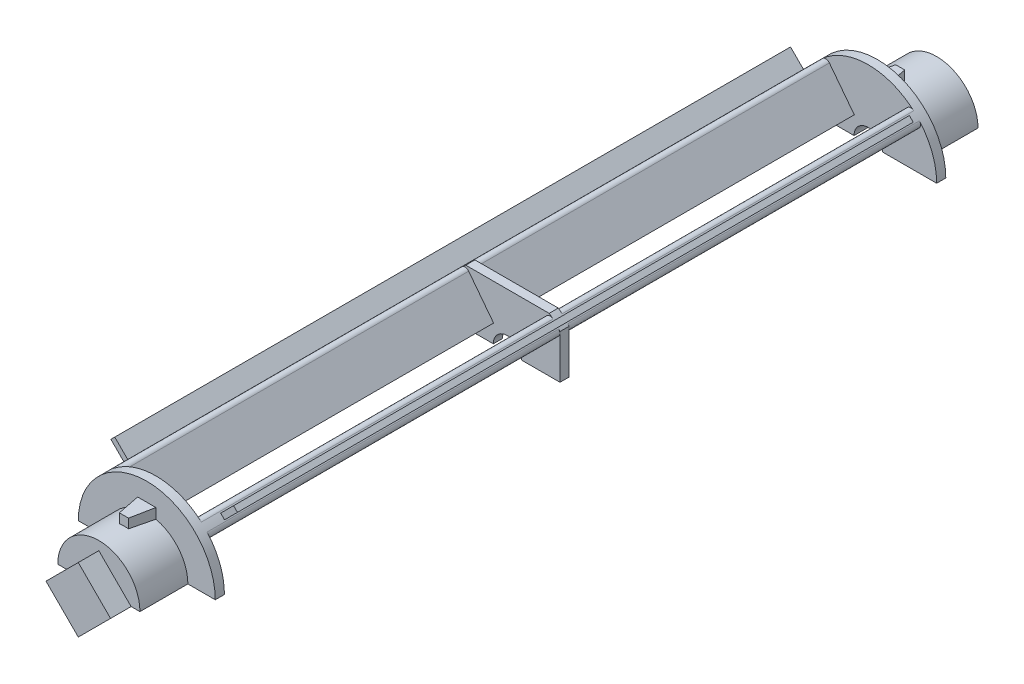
ISO-10303-21;
HEADER;
FILE_DESCRIPTION(('STEP AP214'),'2;1');
FILE_NAME('part.step','',(''),(''),'','','');
FILE_SCHEMA(('AUTOMOTIVE_DESIGN { 1 0 10303 214 1 1 1 1 }'));
ENDSEC;
DATA;
#1=APPLICATION_CONTEXT('core data for automotive mechanical design processes');
#2=APPLICATION_PROTOCOL_DEFINITION('international standard','automotive_design',2000,#1);
#3=PRODUCT_CONTEXT('',#1,'mechanical');
#4=PRODUCT('Part','Part','',(#3));
#5=PRODUCT_RELATED_PRODUCT_CATEGORY('part','',(#4));
#6=PRODUCT_DEFINITION_FORMATION('','',#4);
#7=PRODUCT_DEFINITION_CONTEXT('part definition',#1,'design');
#8=PRODUCT_DEFINITION('design','',#6,#7);
#9=PRODUCT_DEFINITION_SHAPE('','',#8);
#10=(LENGTH_UNIT() NAMED_UNIT(*) SI_UNIT(.MILLI.,.METRE.));
#11=(NAMED_UNIT(*) PLANE_ANGLE_UNIT() SI_UNIT($,.RADIAN.));
#12=(NAMED_UNIT(*) SI_UNIT($,.STERADIAN.) SOLID_ANGLE_UNIT());
#13=UNCERTAINTY_MEASURE_WITH_UNIT(LENGTH_MEASURE(1.E-05),#10,'distance_accuracy_value','');
#14=(GEOMETRIC_REPRESENTATION_CONTEXT(3) GLOBAL_UNCERTAINTY_ASSIGNED_CONTEXT((#13)) GLOBAL_UNIT_ASSIGNED_CONTEXT((#10,
#11,#12)) REPRESENTATION_CONTEXT('',''));
#15=CARTESIAN_POINT('',(0.,0.,0.));
#16=DIRECTION('',(0.,0.,1.));
#17=DIRECTION('',(1.,0.,0.));
#18=AXIS2_PLACEMENT_3D('',#15,#16,#17);
#19=CARTESIAN_POINT('',(0.,0.,80.));
#20=DIRECTION('',(0.,0.,1.));
#21=DIRECTION('',(1.,0.,0.));
#22=AXIS2_PLACEMENT_3D('',#19,#20,#21);
#23=PLANE('',#22);
#24=DIRECTION('',(1.,0.,0.));
#25=VECTOR('',#24,1.);
#26=CARTESIAN_POINT('',(2.,11.,80.));
#27=LINE('',#26,#25);
#28=CARTESIAN_POINT('',(-2.,11.,80.));
#29=VERTEX_POINT('',#28);
#30=CARTESIAN_POINT('',(2.,11.,80.));
#31=VERTEX_POINT('',#30);
#32=EDGE_CURVE('E501',#29,#31,#27,.T.);
#33=ORIENTED_EDGE('',*,*,#32,.T.);
#34=DIRECTION('',(0.,1.,0.));
#35=VECTOR('',#34,1.);
#36=CARTESIAN_POINT('',(2.,-7.07206781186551,80.));
#37=LINE('',#36,#35);
#38=CARTESIAN_POINT('',(2.,8.77496438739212,80.));
#39=VERTEX_POINT('',#38);
#40=EDGE_CURVE('E500',#39,#31,#37,.T.);
#41=ORIENTED_EDGE('',*,*,#40,.F.);
#42=CARTESIAN_POINT('',(0.,0.,80.));
#43=DIRECTION('',(0.,0.,1.));
#44=DIRECTION('',(1.,0.,0.));
#45=AXIS2_PLACEMENT_3D('',#42,#43,#44);
#46=CIRCLE('',#45,9.);
#47=CARTESIAN_POINT('',(9.,0.,80.));
#48=VERTEX_POINT('',#47);
#49=EDGE_CURVE('E861',#48,#39,#46,.T.);
#50=ORIENTED_EDGE('',*,*,#49,.F.);
#51=DIRECTION('',(-1.,0.,0.));
#52=VECTOR('',#51,1.);
#53=CARTESIAN_POINT('',(15.,0.,80.));
#54=LINE('',#53,#52);
#55=CARTESIAN_POINT('',(15.,0.,80.));
#56=VERTEX_POINT('',#55);
#57=EDGE_CURVE('E530',#56,#48,#54,.T.);
#58=ORIENTED_EDGE('',*,*,#57,.F.);
#59=CARTESIAN_POINT('',(0.,0.,80.));
#60=DIRECTION('',(0.,0.,1.));
#61=DIRECTION('',(1.,0.,0.));
#62=AXIS2_PLACEMENT_3D('',#59,#60,#61);
#63=CIRCLE('',#62,15.);
#64=CARTESIAN_POINT('',(-15.,0.,80.));
#65=VERTEX_POINT('',#64);
#66=EDGE_CURVE('E1285',#56,#65,#63,.T.);
#67=ORIENTED_EDGE('',*,*,#66,.T.);
#68=DIRECTION('',(-1.,0.,0.));
#69=VECTOR('',#68,1.);
#70=CARTESIAN_POINT('',(-3.1,0.,80.));
#71=LINE('',#70,#69);
#72=CARTESIAN_POINT('',(-9.,0.,80.));
#73=VERTEX_POINT('',#72);
#74=EDGE_CURVE('E549',#73,#65,#71,.T.);
#75=ORIENTED_EDGE('',*,*,#74,.F.);
#76=CARTESIAN_POINT('',(-2.,8.77496438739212,80.));
#77=VERTEX_POINT('',#76);
#78=EDGE_CURVE('E856',#77,#73,#46,.T.);
#79=ORIENTED_EDGE('',*,*,#78,.F.);
#80=DIRECTION('',(0.,1.,0.));
#81=VECTOR('',#80,1.);
#82=CARTESIAN_POINT('',(-2.,-7.07206781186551,80.));
#83=LINE('',#82,#81);
#84=EDGE_CURVE('E504',#77,#29,#83,.T.);
#85=ORIENTED_EDGE('',*,*,#84,.T.);
#86=EDGE_LOOP('',(#33,#41,#50,#58,#67,#75,#79,#85));
#87=FACE_BOUND('',#86,.T.);
#88=ADVANCED_FACE('F33',(#87),#23,.T.);
#89=CARTESIAN_POINT('',(0.,0.,90.5));
#90=DIRECTION('',(0.,0.,-1.));
#91=DIRECTION('',(-1.,0.,0.));
#92=AXIS2_PLACEMENT_3D('',#89,#90,#91);
#93=CYLINDRICAL_SURFACE('',#92,9.);
#94=CARTESIAN_POINT('',(0.,0.,90.));
#95=DIRECTION('',(-0.98058067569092,0.,-0.196116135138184));
#96=DIRECTION('',(0.196116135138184,0.,-0.98058067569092));
#97=AXIS2_PLACEMENT_3D('',#94,#95,#96);
#98=ELLIPSE('',#97,45.8911756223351,9.);
#99=CARTESIAN_POINT('',(1.,8.94427190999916,85.));
#100=VERTEX_POINT('',#99);
#101=EDGE_CURVE('E503',#39,#100,#98,.F.);
#102=ORIENTED_EDGE('',*,*,#101,.T.);
#103=CARTESIAN_POINT('',(0.,0.,85.));
#104=DIRECTION('',(0.,0.,-1.));
#105=DIRECTION('',(-1.,0.,0.));
#106=AXIS2_PLACEMENT_3D('',#103,#104,#105);
#107=CIRCLE('',#106,9.);
#108=CARTESIAN_POINT('',(-1.,8.94427190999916,85.));
#109=VERTEX_POINT('',#108);
#110=EDGE_CURVE('E522',#100,#109,#107,.F.);
#111=ORIENTED_EDGE('',*,*,#110,.T.);
#112=CARTESIAN_POINT('',(0.,0.,90.));
#113=DIRECTION('',(0.98058067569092,0.,-0.196116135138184));
#114=DIRECTION('',(-0.196116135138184,0.,-0.98058067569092));
#115=AXIS2_PLACEMENT_3D('',#112,#113,#114);
#116=ELLIPSE('',#115,45.8911756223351,9.);
#117=EDGE_CURVE('E524',#109,#77,#116,.F.);
#118=ORIENTED_EDGE('',*,*,#117,.T.);
#119=ORIENTED_EDGE('',*,*,#78,.T.);
#120=DIRECTION('',(0.,0.,-1.));
#121=VECTOR('',#120,1.);
#122=CARTESIAN_POINT('',(-9.,0.,90.5));
#123=LINE('',#122,#121);
#124=CARTESIAN_POINT('',(-9.,0.,90.5));
#125=VERTEX_POINT('',#124);
#126=EDGE_CURVE('E1217',#125,#73,#123,.T.);
#127=ORIENTED_EDGE('',*,*,#126,.F.);
#128=CARTESIAN_POINT('',(0.,0.,90.5));
#129=DIRECTION('',(0.,0.,1.));
#130=DIRECTION('',(1.,0.,0.));
#131=AXIS2_PLACEMENT_3D('',#128,#129,#130);
#132=CIRCLE('',#131,9.);
#133=CARTESIAN_POINT('',(9.,0.,90.5));
#134=VERTEX_POINT('',#133);
#135=EDGE_CURVE('E1136',#134,#125,#132,.T.);
#136=ORIENTED_EDGE('',*,*,#135,.F.);
#137=DIRECTION('',(0.,0.,-1.));
#138=VECTOR('',#137,1.);
#139=CARTESIAN_POINT('',(9.,0.,90.5));
#140=LINE('',#139,#138);
#141=EDGE_CURVE('E1208',#134,#48,#140,.T.);
#142=ORIENTED_EDGE('',*,*,#141,.T.);
#143=ORIENTED_EDGE('',*,*,#49,.T.);
#144=EDGE_LOOP('',(#102,#111,#118,#119,#127,#136,#142,#143));
#145=FACE_BOUND('',#144,.T.);
#146=ADVANCED_FACE('F686',(#145),#93,.T.);
#147=CARTESIAN_POINT('',(-3.1,0.,-80.));
#148=DIRECTION('',(0.,0.,1.));
#149=DIRECTION('',(1.,0.,0.));
#150=AXIS2_PLACEMENT_3D('',#147,#148,#149);
#151=PLANE('',#150);
#152=DIRECTION('',(0.,1.,0.));
#153=VECTOR('',#152,1.);
#154=CARTESIAN_POINT('',(2.,-7.07206781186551,-80.));
#155=LINE('',#154,#153);
#156=CARTESIAN_POINT('',(2.,8.82623928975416,-80.));
#157=VERTEX_POINT('',#156);
#158=CARTESIAN_POINT('',(2.,11.,-80.));
#159=VERTEX_POINT('',#158);
#160=EDGE_CURVE('E538',#157,#159,#155,.T.);
#161=ORIENTED_EDGE('',*,*,#160,.T.);
#162=DIRECTION('',(-1.,0.,0.));
#163=VECTOR('',#162,1.);
#164=CARTESIAN_POINT('',(-2.,11.,-80.));
#165=LINE('',#164,#163);
#166=CARTESIAN_POINT('',(-2.,11.,-80.));
#167=VERTEX_POINT('',#166);
#168=EDGE_CURVE('E536',#159,#167,#165,.T.);
#169=ORIENTED_EDGE('',*,*,#168,.T.);
#170=DIRECTION('',(0.,1.,0.));
#171=VECTOR('',#170,1.);
#172=CARTESIAN_POINT('',(-2.,-7.07206781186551,-80.));
#173=LINE('',#172,#171);
#174=CARTESIAN_POINT('',(-2.,8.82623928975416,-80.));
#175=VERTEX_POINT('',#174);
#176=EDGE_CURVE('E535',#175,#167,#173,.T.);
#177=ORIENTED_EDGE('',*,*,#176,.F.);
#178=CARTESIAN_POINT('',(0.,0.,-80.));
#179=DIRECTION('',(0.,0.,-1.));
#180=DIRECTION('',(1.,0.,0.));
#181=AXIS2_PLACEMENT_3D('',#178,#179,#180);
#182=CIRCLE('',#181,9.05);
#183=CARTESIAN_POINT('',(-9.05,0.,-80.));
#184=VERTEX_POINT('',#183);
#185=EDGE_CURVE('E995',#184,#175,#182,.T.);
#186=ORIENTED_EDGE('',*,*,#185,.F.);
#187=DIRECTION('',(1.,0.,0.));
#188=VECTOR('',#187,1.);
#189=CARTESIAN_POINT('',(-3.1,0.,-80.));
#190=LINE('',#189,#188);
#191=CARTESIAN_POINT('',(-15.,-1.04744440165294E-13,-80.));
#192=VERTEX_POINT('',#191);
#193=EDGE_CURVE('E923',#192,#184,#190,.T.);
#194=ORIENTED_EDGE('',*,*,#193,.F.);
#195=CARTESIAN_POINT('',(0.,0.,-80.));
#196=DIRECTION('',(0.,0.,-1.));
#197=DIRECTION('',(-1.,0.,0.));
#198=AXIS2_PLACEMENT_3D('',#195,#196,#197);
#199=CIRCLE('',#198,15.);
#200=CARTESIAN_POINT('',(15.,0.,-80.));
#201=VERTEX_POINT('',#200);
#202=EDGE_CURVE('E927',#192,#201,#199,.T.);
#203=ORIENTED_EDGE('',*,*,#202,.T.);
#204=DIRECTION('',(-1.,0.,0.));
#205=VECTOR('',#204,1.);
#206=CARTESIAN_POINT('',(3.1,0.,-80.));
#207=LINE('',#206,#205);
#208=CARTESIAN_POINT('',(9.05,0.,-80.));
#209=VERTEX_POINT('',#208);
#210=EDGE_CURVE('E929',#201,#209,#207,.T.);
#211=ORIENTED_EDGE('',*,*,#210,.T.);
#212=EDGE_CURVE('E999',#157,#209,#182,.T.);
#213=ORIENTED_EDGE('',*,*,#212,.F.);
#214=EDGE_LOOP('',(#161,#169,#177,#186,#194,#203,#211,#213));
#215=FACE_BOUND('',#214,.T.);
#216=ADVANCED_FACE('F692',(#215),#151,.F.);
#217=CARTESIAN_POINT('',(0.,0.,-93.));
#218=DIRECTION('',(0.,0.,1.));
#219=DIRECTION('',(1.,0.,0.));
#220=AXIS2_PLACEMENT_3D('',#217,#218,#219);
#221=CYLINDRICAL_SURFACE('',#220,9.05);
#222=CARTESIAN_POINT('',(0.,0.,-90.));
#223=DIRECTION('',(-0.98058067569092,0.,0.196116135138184));
#224=DIRECTION('',(0.196116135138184,0.,0.98058067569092));
#225=AXIS2_PLACEMENT_3D('',#222,#223,#224);
#226=ELLIPSE('',#225,46.1461265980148,9.05);
#227=CARTESIAN_POINT('',(1.,8.99458170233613,-85.));
#228=VERTEX_POINT('',#227);
#229=EDGE_CURVE('E1026',#157,#228,#226,.T.);
#230=ORIENTED_EDGE('',*,*,#229,.F.);
#231=ORIENTED_EDGE('',*,*,#212,.T.);
#232=DIRECTION('',(0.,0.,1.));
#233=VECTOR('',#232,1.);
#234=CARTESIAN_POINT('',(9.05,0.,-93.));
#235=LINE('',#234,#233);
#236=CARTESIAN_POINT('',(9.05,0.,-93.));
#237=VERTEX_POINT('',#236);
#238=EDGE_CURVE('E1398',#237,#209,#235,.T.);
#239=ORIENTED_EDGE('',*,*,#238,.F.);
#240=CARTESIAN_POINT('',(0.,0.,-93.));
#241=DIRECTION('',(0.,0.,-1.));
#242=DIRECTION('',(1.,0.,0.));
#243=AXIS2_PLACEMENT_3D('',#240,#241,#242);
#244=CIRCLE('',#243,9.05);
#245=CARTESIAN_POINT('',(-9.05,0.,-93.));
#246=VERTEX_POINT('',#245);
#247=EDGE_CURVE('E998',#246,#237,#244,.T.);
#248=ORIENTED_EDGE('',*,*,#247,.F.);
#249=DIRECTION('',(0.,0.,1.));
#250=VECTOR('',#249,1.);
#251=CARTESIAN_POINT('',(-9.05,0.,-93.));
#252=LINE('',#251,#250);
#253=EDGE_CURVE('E1010',#246,#184,#252,.T.);
#254=ORIENTED_EDGE('',*,*,#253,.T.);
#255=ORIENTED_EDGE('',*,*,#185,.T.);
#256=CARTESIAN_POINT('',(0.,0.,-90.));
#257=DIRECTION('',(0.98058067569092,0.,0.196116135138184));
#258=DIRECTION('',(-0.196116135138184,0.,0.98058067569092));
#259=AXIS2_PLACEMENT_3D('',#256,#257,#258);
#260=ELLIPSE('',#259,46.1461265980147,9.05);
#261=CARTESIAN_POINT('',(-0.999999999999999,8.99458170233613,-85.));
#262=VERTEX_POINT('',#261);
#263=EDGE_CURVE('E1024',#262,#175,#260,.T.);
#264=ORIENTED_EDGE('',*,*,#263,.F.);
#265=CARTESIAN_POINT('',(0.,0.,-85.));
#266=DIRECTION('',(0.,0.,1.));
#267=DIRECTION('',(1.,0.,0.));
#268=AXIS2_PLACEMENT_3D('',#265,#266,#267);
#269=CIRCLE('',#268,9.05);
#270=EDGE_CURVE('E1021',#228,#262,#269,.T.);
#271=ORIENTED_EDGE('',*,*,#270,.F.);
#272=EDGE_LOOP('',(#230,#231,#239,#248,#254,#255,#264,#271));
#273=FACE_BOUND('',#272,.T.);
#274=ADVANCED_FACE('F1061',(#273),#221,.T.);
#275=CARTESIAN_POINT('',(0.,0.,-88.5));
#276=DIRECTION('',(0.,0.,-1.));
#277=DIRECTION('',(-1.,0.,0.));
#278=AXIS2_PLACEMENT_3D('',#275,#276,#277);
#279=CYLINDRICAL_SURFACE('',#278,7.5);
#280=CARTESIAN_POINT('',(6.25,4.14578098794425,-89.5));
#281=CARTESIAN_POINT('',(6.24999850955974,4.14578343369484,-89.5248777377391));
#282=CARTESIAN_POINT('',(6.24874997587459,4.14766735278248,-89.5497693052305));
#283=CARTESIAN_POINT('',(6.24387569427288,4.15500112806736,-89.5987857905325));
#284=CARTESIAN_POINT('',(6.24024685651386,4.16045561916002,-89.6229096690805));
#285=CARTESIAN_POINT('',(6.22981877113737,4.17605843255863,-89.6753156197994));
#286=CARTESIAN_POINT('',(6.22247599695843,4.18700695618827,-89.7032480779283));
#287=CARTESIAN_POINT('',(6.20529348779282,4.21243026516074,-89.75661528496));
#288=CARTESIAN_POINT('',(6.19544906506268,4.2269116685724,-89.782045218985));
#289=CARTESIAN_POINT('',(6.16813886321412,4.26672054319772,-89.8431144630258));
#290=CARTESIAN_POINT('',(6.14939179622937,4.29374024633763,-89.877064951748));
#291=CARTESIAN_POINT('',(6.10877933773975,4.35133005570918,-89.9396390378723));
#292=CARTESIAN_POINT('',(6.08690614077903,4.38190901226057,-89.968248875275));
#293=CARTESIAN_POINT('',(6.02612141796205,4.46541611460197,-90.037571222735));
#294=CARTESIAN_POINT('',(5.98524096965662,4.52015885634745,-90.0743638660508));
#295=CARTESIAN_POINT('',(5.89902785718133,4.63211706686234,-90.1372749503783));
#296=CARTESIAN_POINT('',(5.85368885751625,4.68933598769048,-90.1633779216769));
#297=CARTESIAN_POINT('',(5.75708982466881,4.80749674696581,-90.2066425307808));
#298=CARTESIAN_POINT('',(5.70564587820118,4.86847984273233,-90.2232814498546));
#299=CARTESIAN_POINT('',(5.59979177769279,4.9898709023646,-90.2452919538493));
#300=CARTESIAN_POINT('',(5.54538325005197,5.05027916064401,-90.2506696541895));
#301=CARTESIAN_POINT('',(5.43947050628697,5.16407526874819,-90.249261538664));
#302=CARTESIAN_POINT('',(5.38812268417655,5.21761812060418,-90.2434885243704));
#303=CARTESIAN_POINT('',(5.28511492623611,5.32192641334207,-90.2204876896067));
#304=CARTESIAN_POINT('',(5.23345545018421,5.37269517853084,-90.2032739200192));
#305=CARTESIAN_POINT('',(5.145602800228,5.45668593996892,-90.1622515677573));
#306=CARTESIAN_POINT('',(5.10899401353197,5.49094903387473,-90.1414711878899));
#307=CARTESIAN_POINT('',(5.03795801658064,5.55619378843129,-90.0923477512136));
#308=CARTESIAN_POINT('',(5.00352789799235,5.58717986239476,-90.0640150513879));
#309=CARTESIAN_POINT('',(4.94555996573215,5.638493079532,-90.0063495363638));
#310=CARTESIAN_POINT('',(4.92127164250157,5.65967969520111,-89.9785407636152));
#311=CARTESIAN_POINT('',(4.87618609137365,5.69856937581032,-89.918059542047));
#312=CARTESIAN_POINT('',(4.8553849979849,5.71627630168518,-89.8853925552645));
#313=CARTESIAN_POINT('',(4.82142745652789,5.74493280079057,-89.8211579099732));
#314=CARTESIAN_POINT('',(4.8075820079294,5.75650846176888,-89.7902357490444));
#315=CARTESIAN_POINT('',(4.78397857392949,5.77613935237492,-89.7258053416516));
#316=CARTESIAN_POINT('',(4.77421883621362,5.78419609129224,-89.6922982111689));
#317=CARTESIAN_POINT('',(4.75937845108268,5.79641368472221,-89.6233964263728));
#318=CARTESIAN_POINT('',(4.75431953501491,5.8005564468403,-89.5879937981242));
#319=CARTESIAN_POINT('',(4.74933076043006,5.80464200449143,-89.5165890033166));
#320=CARTESIAN_POINT('',(4.749399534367,5.80458591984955,-89.4805869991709));
#321=CARTESIAN_POINT('',(4.75444023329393,5.80045738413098,-89.4121161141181));
#322=CARTESIAN_POINT('',(4.75901545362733,5.79670988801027,-89.3795968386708));
#323=CARTESIAN_POINT('',(4.77220075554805,5.78585967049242,-89.3159788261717));
#324=CARTESIAN_POINT('',(4.78081078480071,5.77875699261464,-89.2848800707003));
#325=CARTESIAN_POINT('',(4.80185345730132,5.76128399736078,-89.2240394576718));
#326=CARTESIAN_POINT('',(4.81437787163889,5.75083506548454,-89.1943523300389));
#327=CARTESIAN_POINT('',(4.8425429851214,5.7271386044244,-89.1377117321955));
#328=CARTESIAN_POINT('',(4.85818527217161,5.71388964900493,-89.1107596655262));
#329=CARTESIAN_POINT('',(4.89849538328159,5.67940893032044,-89.0500171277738));
#330=CARTESIAN_POINT('',(4.92431396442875,5.65707165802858,-89.0176140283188));
#331=CARTESIAN_POINT('',(4.97921139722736,5.60881425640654,-88.9587925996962));
#332=CARTESIAN_POINT('',(5.00829611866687,5.58288765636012,-88.9323853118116));
#333=CARTESIAN_POINT('',(5.07841931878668,5.51928971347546,-88.8776275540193));
#334=CARTESIAN_POINT('',(5.12023787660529,5.48056403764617,-88.8515058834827));
#335=CARTESIAN_POINT('',(5.20537325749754,5.39977395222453,-88.8086435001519));
#336=CARTESIAN_POINT('',(5.24869211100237,5.35770490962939,-88.7919160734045));
#337=CARTESIAN_POINT('',(5.35038595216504,5.25643531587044,-88.7625725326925));
#338=CARTESIAN_POINT('',(5.40881964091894,5.196315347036,-88.7533442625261));
#339=CARTESIAN_POINT('',(5.52389316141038,5.0738253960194,-88.7481656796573));
#340=CARTESIAN_POINT('',(5.58053012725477,5.0114521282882,-88.7522355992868));
#341=CARTESIAN_POINT('',(5.69183353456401,4.88469967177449,-88.7726985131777));
#342=CARTESIAN_POINT('',(5.74643620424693,4.82030551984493,-88.7893412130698));
#343=CARTESIAN_POINT('',(5.85133842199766,4.69240302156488,-88.834916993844));
#344=CARTESIAN_POINT('',(5.90164343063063,4.62889363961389,-88.8638341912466));
#345=CARTESIAN_POINT('',(5.97986940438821,4.52700000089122,-88.9223378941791));
#346=CARTESIAN_POINT('',(6.00942684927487,4.48765535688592,-88.9480902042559));
#347=CARTESIAN_POINT('',(6.06559196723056,4.4114412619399,-89.0058053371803));
#348=CARTESIAN_POINT('',(6.09220339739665,4.3745686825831,-89.0377601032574));
#349=CARTESIAN_POINT('',(6.13372440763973,4.31605021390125,-89.0977841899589));
#350=CARTESIAN_POINT('',(6.14969859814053,4.29323641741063,-89.123968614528));
#351=CARTESIAN_POINT('',(6.17910339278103,4.25080486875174,-89.1801252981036));
#352=CARTESIAN_POINT('',(6.19253805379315,4.23118202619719,-89.2100913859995));
#353=CARTESIAN_POINT('',(6.21264919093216,4.20157321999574,-89.2649898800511));
#354=CARTESIAN_POINT('',(6.22016468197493,4.19042736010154,-89.2889823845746));
#355=CARTESIAN_POINT('',(6.23291961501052,4.1714319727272,-89.3387998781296));
#356=CARTESIAN_POINT('',(6.23816410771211,4.16357513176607,-89.3646206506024));
#357=CARTESIAN_POINT('',(6.24465523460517,4.15382991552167,-89.4088328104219));
#358=CARTESIAN_POINT('',(6.24664952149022,4.15082830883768,-89.4268731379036));
#359=CARTESIAN_POINT('',(6.24932245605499,4.14680293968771,-89.4632731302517));
#360=CARTESIAN_POINT('',(6.25000110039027,4.14577918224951,-89.4816327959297));
#361=CARTESIAN_POINT('',(6.25,4.14578098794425,-89.5));
#362=B_SPLINE_CURVE_WITH_KNOTS('',3,(#280,#281,#282,#283,#284,#285,#286,#287,#288,#289,#290,
#291,#292,#293,#294,#295,#296,#297,#298,#299,#300,#301,#302,#303,#304,#305,#306,#307,#308,#309,
#310,#311,#312,#313,#314,#315,#316,#317,#318,#319,#320,#321,#322,#323,#324,#325,#326,#327,#328,
#329,#330,#331,#332,#333,#334,#335,#336,#337,#338,#339,#340,#341,#342,#343,#344,#345,#346,#347,
#348,#349,#350,#351,#352,#353,#354,#355,#356,#357,#358,#359,#360,#361),.UNSPECIFIED.,.T.,.F.,(4,
2,2,2,2,2,2,2,2,2,2,2,2,2,2,2,2,2,2,2,2,2,2,2,2,2,2,2,2,2,2,2,2,2,2,2,2,2,2,2,4),(0.,
0.0745599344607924,0.149216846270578,0.241361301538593,0.333679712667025,0.474686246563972,
0.61605121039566,0.847583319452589,1.0794493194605,1.32311683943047,1.5666520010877,
1.78910197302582,2.01127924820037,2.1735705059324,2.33564033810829,2.46287328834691,
2.58996425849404,2.69692404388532,2.8038379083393,2.91124359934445,3.01862064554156,
3.11731985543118,3.21601778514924,3.31722939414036,3.41849268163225,3.55892499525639,
3.69961385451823,3.88667818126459,4.07400640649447,4.32570469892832,4.57778611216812,
4.83501016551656,5.09190237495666,5.25817761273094,5.42423829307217,5.53862739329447,
5.65283218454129,5.73505971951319,5.81710342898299,5.87215079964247,5.92719831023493),.UNSPECIFIED.);
#363=CARTESIAN_POINT('',(6.25,4.14578098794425,-89.5));
#364=VERTEX_POINT('',#363);
#365=EDGE_CURVE('E600',#364,#364,#362,.T.);
#366=ORIENTED_EDGE('',*,*,#365,.T.);
#367=EDGE_LOOP('',(#366));
#368=FACE_BOUND('',#367,.T.);
#369=DIRECTION('',(0.,0.,-1.));
#370=VECTOR('',#369,1.);
#371=CARTESIAN_POINT('',(-7.5,0.,-88.5));
#372=LINE('',#371,#370);
#373=CARTESIAN_POINT('',(-7.5,0.,-88.5));
#374=VERTEX_POINT('',#373);
#375=CARTESIAN_POINT('',(-7.5,0.,-93.));
#376=VERTEX_POINT('',#375);
#377=EDGE_CURVE('E1405',#374,#376,#372,.T.);
#378=ORIENTED_EDGE('',*,*,#377,.T.);
#379=CARTESIAN_POINT('',(0.,0.,-93.));
#380=DIRECTION('',(0.,0.,-1.));
#381=DIRECTION('',(-1.,0.,0.));
#382=AXIS2_PLACEMENT_3D('',#379,#380,#381);
#383=CIRCLE('',#382,7.5);
#384=CARTESIAN_POINT('',(7.5,0.,-93.));
#385=VERTEX_POINT('',#384);
#386=EDGE_CURVE('E1372',#376,#385,#383,.T.);
#387=ORIENTED_EDGE('',*,*,#386,.T.);
#388=DIRECTION('',(0.,0.,-1.));
#389=VECTOR('',#388,1.);
#390=CARTESIAN_POINT('',(7.5,0.,-88.5));
#391=LINE('',#390,#389);
#392=CARTESIAN_POINT('',(7.5,0.,-88.5));
#393=VERTEX_POINT('',#392);
#394=EDGE_CURVE('E1394',#393,#385,#391,.T.);
#395=ORIENTED_EDGE('',*,*,#394,.F.);
#396=CARTESIAN_POINT('',(0.,0.,-88.5));
#397=DIRECTION('',(0.,0.,-1.));
#398=DIRECTION('',(-1.,0.,0.));
#399=AXIS2_PLACEMENT_3D('',#396,#397,#398);
#400=CIRCLE('',#399,7.5);
#401=EDGE_CURVE('E1391',#374,#393,#400,.T.);
#402=ORIENTED_EDGE('',*,*,#401,.F.);
#403=EDGE_LOOP('',(#378,#387,#395,#402));
#404=FACE_BOUND('',#403,.T.);
#405=CARTESIAN_POINT('',(-4.75,5.80409338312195,-89.5));
#406=CARTESIAN_POINT('',(-4.75000195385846,5.80409204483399,-89.4650073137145));
#407=CARTESIAN_POINT('',(-4.75246600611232,5.80207791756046,-89.429997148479));
#408=CARTESIAN_POINT('',(-4.76215339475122,5.79412912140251,-89.3610902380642));
#409=CARTESIAN_POINT('',(-4.76938067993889,5.78819119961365,-89.3271944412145));
#410=CARTESIAN_POINT('',(-4.78807292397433,5.77273785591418,-89.2616366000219));
#411=CARTESIAN_POINT('',(-4.79951935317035,5.7632380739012,-89.2299654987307));
#412=CARTESIAN_POINT('',(-4.82599866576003,5.74108297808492,-89.169368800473));
#413=CARTESIAN_POINT('',(-4.84103202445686,5.72842724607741,-89.1404435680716));
#414=CARTESIAN_POINT('',(-4.87506445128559,5.69949780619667,-89.0839301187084));
#415=CARTESIAN_POINT('',(-4.89425931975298,5.6830408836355,-89.0565549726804));
#416=CARTESIAN_POINT('',(-4.93511317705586,5.64760059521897,-89.0055584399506));
#417=CARTESIAN_POINT('',(-4.95677346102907,5.62861590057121,-88.9819390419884));
#418=CARTESIAN_POINT('',(-5.01384904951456,5.57794163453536,-88.9268881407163));
#419=CARTESIAN_POINT('',(-5.05046080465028,5.54485880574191,-88.8979683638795));
#420=CARTESIAN_POINT('',(-5.12590351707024,5.47519606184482,-88.848387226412));
#421=CARTESIAN_POINT('',(-5.16473956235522,5.43860798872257,-88.8277457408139));
#422=CARTESIAN_POINT('',(-5.25710953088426,5.34959936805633,-88.7880689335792));
#423=CARTESIAN_POINT('',(-5.31099398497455,5.29614798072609,-88.7721707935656));
#424=CARTESIAN_POINT('',(-5.41810358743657,5.18652655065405,-88.752494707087));
#425=CARTESIAN_POINT('',(-5.47132815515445,5.13035430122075,-88.7487267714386));
#426=CARTESIAN_POINT('',(-5.57712394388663,5.01517229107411,-88.7520554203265));
#427=CARTESIAN_POINT('',(-5.62964639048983,4.95612671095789,-88.7594232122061));
#428=CARTESIAN_POINT('',(-5.73173264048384,4.83770126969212,-88.7847590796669));
#429=CARTESIAN_POINT('',(-5.7812948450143,4.77832124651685,-88.8027328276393));
#430=CARTESIAN_POINT('',(-5.87343463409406,4.66452285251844,-88.8476963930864));
#431=CARTESIAN_POINT('',(-5.91625736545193,4.61003603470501,-88.8740114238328));
#432=CARTESIAN_POINT('',(-5.99765017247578,4.50362444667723,-88.9365462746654));
#433=CARTESIAN_POINT('',(-6.03622994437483,4.4516939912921,-88.9727428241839));
#434=CARTESIAN_POINT('',(-6.09142264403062,4.37557979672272,-89.0378003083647));
#435=CARTESIAN_POINT('',(-6.11010176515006,4.34943560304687,-89.0626196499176));
#436=CARTESIAN_POINT('',(-6.14516715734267,4.29974838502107,-89.1162226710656));
#437=CARTESIAN_POINT('',(-6.16155561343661,4.27620288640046,-89.1450025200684));
#438=CARTESIAN_POINT('',(-6.18786730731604,4.23800795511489,-89.1999263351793));
#439=CARTESIAN_POINT('',(-6.19841501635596,4.2225498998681,-89.2252003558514));
#440=CARTESIAN_POINT('',(-6.21706180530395,4.19504686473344,-89.2783871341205));
#441=CARTESIAN_POINT('',(-6.22516525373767,4.18299579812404,-89.3062950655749));
#442=CARTESIAN_POINT('',(-6.23682512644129,4.16558500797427,-89.3581077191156));
#443=CARTESIAN_POINT('',(-6.24098553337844,4.15934235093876,-89.3815758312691));
#444=CARTESIAN_POINT('',(-6.24706149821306,4.15021126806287,-89.4294373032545));
#445=CARTESIAN_POINT('',(-6.24897925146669,4.14731956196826,-89.4538297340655));
#446=CARTESIAN_POINT('',(-6.25039713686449,4.14518246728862,-89.5029215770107));
#447=CARTESIAN_POINT('',(-6.24989013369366,4.14594784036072,-89.5276216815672));
#448=CARTESIAN_POINT('',(-6.24649303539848,4.15106413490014,-89.5764812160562));
#449=CARTESIAN_POINT('',(-6.24360130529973,4.15541751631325,-89.6006402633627));
#450=CARTESIAN_POINT('',(-6.2349440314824,4.16839817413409,-89.6521909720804));
#451=CARTESIAN_POINT('',(-6.2287427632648,4.17767161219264,-89.6793441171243));
#452=CARTESIAN_POINT('',(-6.21390429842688,4.19971068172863,-89.7314714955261));
#453=CARTESIAN_POINT('',(-6.20526276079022,4.21248253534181,-89.7564417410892));
#454=CARTESIAN_POINT('',(-6.18136252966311,4.24751620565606,-89.8157738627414));
#455=CARTESIAN_POINT('',(-6.16493868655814,4.27135762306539,-89.8487226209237));
#456=CARTESIAN_POINT('',(-6.12911385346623,4.32260957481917,-89.9098471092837));
#457=CARTESIAN_POINT('',(-6.10970575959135,4.35002860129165,-89.9380111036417));
#458=CARTESIAN_POINT('',(-6.05535252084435,4.42561118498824,-90.0070333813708));
#459=CARTESIAN_POINT('',(-6.01849575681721,4.47569329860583,-90.0442744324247));
#460=CARTESIAN_POINT('',(-5.94053333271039,4.57867710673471,-90.1090959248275));
#461=CARTESIAN_POINT('',(-5.89941826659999,4.6315849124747,-90.1366543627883));
#462=CARTESIAN_POINT('',(-5.80070309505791,4.75497932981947,-90.1900160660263));
#463=CARTESIAN_POINT('',(-5.74191424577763,4.82588104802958,-90.2126893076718));
#464=CARTESIAN_POINT('',(-5.62009978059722,4.96721025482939,-90.2429706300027));
#465=CARTESIAN_POINT('',(-5.55707652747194,5.03763798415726,-90.250587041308));
#466=CARTESIAN_POINT('',(-5.44207000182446,5.16134063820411,-90.2494748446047));
#467=CARTESIAN_POINT('',(-5.39057038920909,5.21509344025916,-90.2438620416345));
#468=CARTESIAN_POINT('',(-5.2872569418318,5.3198011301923,-90.2211310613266));
#469=CARTESIAN_POINT('',(-5.23544381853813,5.37076077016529,-90.204033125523));
#470=CARTESIAN_POINT('',(-5.1473478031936,5.45504116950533,-90.16318469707));
#471=CARTESIAN_POINT('',(-5.1106530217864,5.48940621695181,-90.1424820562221));
#472=CARTESIAN_POINT('',(-5.03942700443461,5.55486268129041,-90.0934936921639));
#473=CARTESIAN_POINT('',(-5.00489310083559,5.58595816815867,-90.065217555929));
#474=CARTESIAN_POINT('',(-4.94673638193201,5.63746170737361,-90.0076367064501));
#475=CARTESIAN_POINT('',(-4.92236464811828,5.65872973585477,-89.9798623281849));
#476=CARTESIAN_POINT('',(-4.87710241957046,5.69778580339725,-89.9194266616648));
#477=CARTESIAN_POINT('',(-4.85620853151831,5.71557723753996,-89.8867701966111));
#478=CARTESIAN_POINT('',(-4.82208408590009,5.74438199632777,-89.8225452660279));
#479=CARTESIAN_POINT('',(-4.8081636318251,5.75602286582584,-89.791626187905));
#480=CARTESIAN_POINT('',(-4.7844214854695,5.77577277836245,-89.7272026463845));
#481=CARTESIAN_POINT('',(-4.7745943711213,5.78388649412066,-89.6937016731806));
#482=CARTESIAN_POINT('',(-4.7614921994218,5.79467382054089,-89.6334546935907));
#483=CARTESIAN_POINT('',(-4.75719964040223,5.79819501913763,-89.6070765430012));
#484=CARTESIAN_POINT('',(-4.75145265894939,5.80290542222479,-89.5538024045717));
#485=CARTESIAN_POINT('',(-4.74999849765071,5.80409441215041,-89.5269063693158));
#486=CARTESIAN_POINT('',(-4.75,5.80409338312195,-89.5));
#487=B_SPLINE_CURVE_WITH_KNOTS('',3,(#405,#406,#407,#408,#409,#410,#411,#412,#413,#414,#415,
#416,#417,#418,#419,#420,#421,#422,#423,#424,#425,#426,#427,#428,#429,#430,#431,#432,#433,#434,
#435,#436,#437,#438,#439,#440,#441,#442,#443,#444,#445,#446,#447,#448,#449,#450,#451,#452,#453,
#454,#455,#456,#457,#458,#459,#460,#461,#462,#463,#464,#465,#466,#467,#468,#469,#470,#471,#472,
#473,#474,#475,#476,#477,#478,#479,#480,#481,#482,#483,#484,#485,#486),.UNSPECIFIED.,.T.,.F.,(4,
2,2,2,2,2,2,2,2,2,2,2,2,2,2,2,2,2,2,2,2,2,2,2,2,2,2,2,2,2,2,2,2,2,2,2,2,2,2,2,4),(0.,
0.104868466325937,0.20982397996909,0.314323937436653,0.4188377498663,0.530225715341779,
0.641672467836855,0.812298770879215,0.98333230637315,1.21472049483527,1.44629959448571,
1.6836103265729,1.92104809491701,2.14278511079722,2.36400438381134,2.48556272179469,
2.60700430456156,2.70105054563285,2.7949276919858,2.868536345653,2.9420728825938,
3.01582594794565,3.08962962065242,3.17721162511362,3.26495042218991,3.39579538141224,
3.52695677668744,3.74320410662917,3.9599397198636,4.24314153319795,4.52618661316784,
4.74937773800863,4.97217653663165,5.13474644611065,5.29711152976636,5.4245419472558,
5.55184729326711,5.65895508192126,5.76592054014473,5.84654796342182,5.92718280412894),.UNSPECIFIED.);
#488=CARTESIAN_POINT('',(-4.75,5.80409338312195,-89.5));
#489=VERTEX_POINT('',#488);
#490=EDGE_CURVE('E1368',#489,#489,#487,.T.);
#491=ORIENTED_EDGE('',*,*,#490,.F.);
#492=EDGE_LOOP('',(#491));
#493=FACE_BOUND('',#492,.T.);
#494=ADVANCED_FACE('F1063',(#368,#404,#493),#279,.F.);
#495=CARTESIAN_POINT('',(0.,0.,0.));
#496=DIRECTION('',(0.,0.,-1.));
#497=DIRECTION('',(-1.,0.,0.));
#498=AXIS2_PLACEMENT_3D('',#495,#496,#497);
#499=CYLINDRICAL_SURFACE('',#498,3.1);
#500=CARTESIAN_POINT('',(0.,0.,-88.5));
#501=DIRECTION('',(0.,0.,-1.));
#502=DIRECTION('',(-1.,0.,0.));
#503=AXIS2_PLACEMENT_3D('',#500,#501,#502);
#504=CIRCLE('',#503,3.1);
#505=CARTESIAN_POINT('',(3.1,0.,-88.5));
#506=VERTEX_POINT('',#505);
#507=CARTESIAN_POINT('',(-3.1,0.,-88.5));
#508=VERTEX_POINT('',#507);
#509=EDGE_CURVE('E1407',#506,#508,#504,.F.);
#510=ORIENTED_EDGE('',*,*,#509,.F.);
#511=DIRECTION('',(0.,0.,1.));
#512=VECTOR('',#511,1.);
#513=CARTESIAN_POINT('',(3.1,0.,-80.));
#514=LINE('',#513,#512);
#515=CARTESIAN_POINT('',(3.1,0.,-78.));
#516=VERTEX_POINT('',#515);
#517=EDGE_CURVE('E972',#506,#516,#514,.T.);
#518=ORIENTED_EDGE('',*,*,#517,.T.);
#519=CARTESIAN_POINT('',(0.,0.,-78.));
#520=DIRECTION('',(0.,0.,-1.));
#521=DIRECTION('',(-1.,0.,0.));
#522=AXIS2_PLACEMENT_3D('',#519,#520,#521);
#523=CIRCLE('',#522,3.1);
#524=CARTESIAN_POINT('',(-3.1,0.,-78.));
#525=VERTEX_POINT('',#524);
#526=EDGE_CURVE('E940',#525,#516,#523,.T.);
#527=ORIENTED_EDGE('',*,*,#526,.F.);
#528=DIRECTION('',(0.,0.,1.));
#529=VECTOR('',#528,1.);
#530=CARTESIAN_POINT('',(-3.1,0.,-80.));
#531=LINE('',#530,#529);
#532=EDGE_CURVE('E979',#508,#525,#531,.T.);
#533=ORIENTED_EDGE('',*,*,#532,.F.);
#534=EDGE_LOOP('',(#510,#518,#527,#533));
#535=FACE_BOUND('',#534,.T.);
#536=ADVANCED_FACE('F1069',(#535),#499,.F.);
#537=CARTESIAN_POINT('',(9.,0.,90.5));
#538=DIRECTION('',(0.,1.,0.));
#539=DIRECTION('',(-1.,0.,0.));
#540=AXIS2_PLACEMENT_3D('',#537,#538,#539);
#541=PLANE('',#540);
#542=CARTESIAN_POINT('',(5.5,0.,87.5));
#543=DIRECTION('',(0.,1.,0.));
#544=DIRECTION('',(-1.,0.,0.));
#545=AXIS2_PLACEMENT_3D('',#542,#543,#544);
#546=CIRCLE('',#545,0.75);
#547=CARTESIAN_POINT('',(4.75,0.,87.5));
#548=VERTEX_POINT('',#547);
#549=EDGE_CURVE('E1125',#548,#548,#546,.T.);
#550=ORIENTED_EDGE('',*,*,#549,.T.);
#551=EDGE_LOOP('',(#550));
#552=FACE_BOUND('',#551,.T.);
#553=DIRECTION('',(0.,0.,-1.));
#554=VECTOR('',#553,1.);
#555=CARTESIAN_POINT('',(7.07106781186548,0.,95.));
#556=LINE('',#555,#554);
#557=CARTESIAN_POINT('',(7.07106781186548,0.,90.5));
#558=VERTEX_POINT('',#557);
#559=CARTESIAN_POINT('',(7.07106781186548,0.,89.5));
#560=VERTEX_POINT('',#559);
#561=EDGE_CURVE('E1164',#558,#560,#556,.T.);
#562=ORIENTED_EDGE('',*,*,#561,.T.);
#563=DIRECTION('',(1.,0.,0.));
#564=VECTOR('',#563,1.);
#565=CARTESIAN_POINT('',(9.,0.,89.5));
#566=LINE('',#565,#564);
#567=CARTESIAN_POINT('',(3.1,0.,89.5));
#568=VERTEX_POINT('',#567);
#569=EDGE_CURVE('E1165',#568,#560,#566,.T.);
#570=ORIENTED_EDGE('',*,*,#569,.F.);
#571=DIRECTION('',(0.,0.,-1.));
#572=VECTOR('',#571,1.);
#573=CARTESIAN_POINT('',(3.1,0.,90.5));
#574=LINE('',#573,#572);
#575=CARTESIAN_POINT('',(3.1,0.,78.));
#576=VERTEX_POINT('',#575);
#577=EDGE_CURVE('E1213',#568,#576,#574,.T.);
#578=ORIENTED_EDGE('',*,*,#577,.T.);
#579=DIRECTION('',(-1.,0.,0.));
#580=VECTOR('',#579,1.);
#581=CARTESIAN_POINT('',(15.,0.,78.));
#582=LINE('',#581,#580);
#583=CARTESIAN_POINT('',(15.,0.,78.));
#584=VERTEX_POINT('',#583);
#585=EDGE_CURVE('E555',#584,#576,#582,.T.);
#586=ORIENTED_EDGE('',*,*,#585,.F.);
#587=DIRECTION('',(0.,0.,1.));
#588=VECTOR('',#587,1.);
#589=CARTESIAN_POINT('',(15.,0.,78.));
#590=LINE('',#589,#588);
#591=EDGE_CURVE('E567',#584,#56,#590,.T.);
#592=ORIENTED_EDGE('',*,*,#591,.T.);
#593=ORIENTED_EDGE('',*,*,#57,.T.);
#594=ORIENTED_EDGE('',*,*,#141,.F.);
#595=DIRECTION('',(1.,0.,0.));
#596=VECTOR('',#595,1.);
#597=CARTESIAN_POINT('',(9.,0.,90.5));
#598=LINE('',#597,#596);
#599=EDGE_CURVE('E1168',#558,#134,#598,.T.);
#600=ORIENTED_EDGE('',*,*,#599,.F.);
#601=EDGE_LOOP('',(#562,#570,#578,#586,#592,#593,#594,#600));
#602=FACE_BOUND('',#601,.T.);
#603=ADVANCED_FACE('F1081',(#552,#602),#541,.F.);
#604=CARTESIAN_POINT('',(-3.1,0.,90.5));
#605=DIRECTION('',(0.,1.,0.));
#606=DIRECTION('',(-1.,0.,0.));
#607=AXIS2_PLACEMENT_3D('',#604,#605,#606);
#608=PLANE('',#607);
#609=CARTESIAN_POINT('',(-5.5,0.,87.5));
#610=DIRECTION('',(0.,-1.,0.));
#611=DIRECTION('',(1.,0.,0.));
#612=AXIS2_PLACEMENT_3D('',#609,#610,#611);
#613=CIRCLE('',#612,0.75);
#614=CARTESIAN_POINT('',(-4.75,0.,87.5));
#615=VERTEX_POINT('',#614);
#616=EDGE_CURVE('E1126',#615,#615,#613,.T.);
#617=ORIENTED_EDGE('',*,*,#616,.F.);
#618=EDGE_LOOP('',(#617));
#619=FACE_BOUND('',#618,.T.);
#620=DIRECTION('',(0.,0.,-1.));
#621=VECTOR('',#620,1.);
#622=CARTESIAN_POINT('',(-7.07106781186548,0.,95.));
#623=LINE('',#622,#621);
#624=CARTESIAN_POINT('',(-7.07106781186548,0.,90.5));
#625=VERTEX_POINT('',#624);
#626=CARTESIAN_POINT('',(-7.07106781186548,0.,89.5));
#627=VERTEX_POINT('',#626);
#628=EDGE_CURVE('E1181',#625,#627,#623,.T.);
#629=ORIENTED_EDGE('',*,*,#628,.F.);
#630=DIRECTION('',(1.,0.,0.));
#631=VECTOR('',#630,1.);
#632=CARTESIAN_POINT('',(-3.1,0.,90.5));
#633=LINE('',#632,#631);
#634=EDGE_CURVE('E1199',#125,#625,#633,.T.);
#635=ORIENTED_EDGE('',*,*,#634,.F.);
#636=ORIENTED_EDGE('',*,*,#126,.T.);
#637=ORIENTED_EDGE('',*,*,#74,.T.);
#638=DIRECTION('',(0.,0.,1.));
#639=VECTOR('',#638,1.);
#640=CARTESIAN_POINT('',(-15.,0.,78.));
#641=LINE('',#640,#639);
#642=CARTESIAN_POINT('',(-15.,0.,78.));
#643=VERTEX_POINT('',#642);
#644=EDGE_CURVE('E564',#643,#65,#641,.T.);
#645=ORIENTED_EDGE('',*,*,#644,.F.);
#646=DIRECTION('',(-1.,0.,0.));
#647=VECTOR('',#646,1.);
#648=CARTESIAN_POINT('',(-3.1,0.,78.));
#649=LINE('',#648,#647);
#650=CARTESIAN_POINT('',(-3.1,0.,78.));
#651=VERTEX_POINT('',#650);
#652=EDGE_CURVE('E562',#651,#643,#649,.T.);
#653=ORIENTED_EDGE('',*,*,#652,.F.);
#654=DIRECTION('',(0.,0.,-1.));
#655=VECTOR('',#654,1.);
#656=CARTESIAN_POINT('',(-3.1,0.,90.5));
#657=LINE('',#656,#655);
#658=CARTESIAN_POINT('',(-3.1,0.,89.5));
#659=VERTEX_POINT('',#658);
#660=EDGE_CURVE('E1215',#659,#651,#657,.T.);
#661=ORIENTED_EDGE('',*,*,#660,.F.);
#662=DIRECTION('',(1.,0.,0.));
#663=VECTOR('',#662,1.);
#664=CARTESIAN_POINT('',(-3.1,0.,89.5));
#665=LINE('',#664,#663);
#666=EDGE_CURVE('E1185',#627,#659,#665,.T.);
#667=ORIENTED_EDGE('',*,*,#666,.F.);
#668=EDGE_LOOP('',(#629,#635,#636,#637,#645,#653,#661,#667));
#669=FACE_BOUND('',#668,.T.);
#670=ADVANCED_FACE('F1158',(#619,#669),#608,.F.);
#671=CARTESIAN_POINT('',(0.,0.,90.5));
#672=DIRECTION('',(0.,0.,-1.));
#673=DIRECTION('',(-1.,0.,0.));
#674=AXIS2_PLACEMENT_3D('',#671,#672,#673);
#675=CYLINDRICAL_SURFACE('',#674,3.1);
#676=CARTESIAN_POINT('',(0.,0.,89.5));
#677=DIRECTION('',(0.,0.,1.));
#678=DIRECTION('',(1.,0.,0.));
#679=AXIS2_PLACEMENT_3D('',#676,#677,#678);
#680=CIRCLE('',#679,3.1);
#681=EDGE_CURVE('E864',#659,#568,#680,.F.);
#682=ORIENTED_EDGE('',*,*,#681,.F.);
#683=ORIENTED_EDGE('',*,*,#660,.T.);
#684=CARTESIAN_POINT('',(0.,0.,78.));
#685=DIRECTION('',(0.,0.,1.));
#686=DIRECTION('',(-1.,0.,0.));
#687=AXIS2_PLACEMENT_3D('',#684,#685,#686);
#688=CIRCLE('',#687,3.1);
#689=EDGE_CURVE('E559',#576,#651,#688,.T.);
#690=ORIENTED_EDGE('',*,*,#689,.F.);
#691=ORIENTED_EDGE('',*,*,#577,.F.);
#692=EDGE_LOOP('',(#682,#683,#690,#691));
#693=FACE_BOUND('',#692,.T.);
#694=ADVANCED_FACE('F1193',(#693),#675,.F.);
#695=CARTESIAN_POINT('',(0.,0.,90.5));
#696=DIRECTION('',(0.,0.,1.));
#697=DIRECTION('',(1.,0.,0.));
#698=AXIS2_PLACEMENT_3D('',#695,#696,#697);
#699=PLANE('',#698);
#700=ORIENTED_EDGE('',*,*,#634,.T.);
#701=DIRECTION('',(0.707106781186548,0.707106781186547,0.));
#702=VECTOR('',#701,1.);
#703=CARTESIAN_POINT('',(-3.53553390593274,3.53553390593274,90.5));
#704=LINE('',#703,#702);
#705=CARTESIAN_POINT('',(0.,7.07106781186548,90.5));
#706=VERTEX_POINT('',#705);
#707=EDGE_CURVE('E860',#625,#706,#704,.T.);
#708=ORIENTED_EDGE('',*,*,#707,.T.);
#709=DIRECTION('',(0.707106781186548,-0.707106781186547,0.));
#710=VECTOR('',#709,1.);
#711=CARTESIAN_POINT('',(3.53553390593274,3.53553390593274,90.5));
#712=LINE('',#711,#710);
#713=EDGE_CURVE('E857',#706,#558,#712,.T.);
#714=ORIENTED_EDGE('',*,*,#713,.T.);
#715=ORIENTED_EDGE('',*,*,#599,.T.);
#716=ORIENTED_EDGE('',*,*,#135,.T.);
#717=EDGE_LOOP('',(#700,#708,#714,#715,#716));
#718=FACE_BOUND('',#717,.T.);
#719=ADVANCED_FACE('F732',(#718),#699,.T.);
#720=CARTESIAN_POINT('',(0.,0.,1.));
#721=DIRECTION('',(0.,0.,1.));
#722=DIRECTION('',(1.,0.,0.));
#723=AXIS2_PLACEMENT_3D('',#720,#721,#722);
#724=PLANE('',#723);
#725=CARTESIAN_POINT('',(-9.29424406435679,10.469815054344,1.));
#726=DIRECTION('',(0.,0.,1.));
#727=DIRECTION('',(1.,0.,0.));
#728=AXIS2_PLACEMENT_3D('',#725,#726,#727);
#729=CIRCLE('',#728,1.);
#730=CARTESIAN_POINT('',(-8.50089072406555,11.0785764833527,1.));
#731=VERTEX_POINT('',#730);
#732=CARTESIAN_POINT('',(-9.95811864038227,11.2176589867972,1.));
#733=VERTEX_POINT('',#732);
#734=EDGE_CURVE('E892',#731,#733,#729,.T.);
#735=ORIENTED_EDGE('',*,*,#734,.F.);
#736=DIRECTION('',(-0.608761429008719,0.793353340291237,0.));
#737=VECTOR('',#736,1.);
#738=CARTESIAN_POINT('',(0.,0.,1.));
#739=LINE('',#738,#737);
#740=CARTESIAN_POINT('',(-3.04380714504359,3.96676670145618,1.));
#741=VERTEX_POINT('',#740);
#742=EDGE_CURVE('E898',#741,#731,#739,.T.);
#743=ORIENTED_EDGE('',*,*,#742,.F.);
#744=CARTESIAN_POINT('',(0.,0.,1.));
#745=DIRECTION('',(0.,0.,1.));
#746=DIRECTION('',(1.,0.,0.));
#747=AXIS2_PLACEMENT_3D('',#744,#745,#746);
#748=CIRCLE('',#747,5.);
#749=CARTESIAN_POINT('',(-3.96676670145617,3.04380714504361,1.));
#750=VERTEX_POINT('',#749);
#751=EDGE_CURVE('E901',#750,#741,#748,.F.);
#752=ORIENTED_EDGE('',*,*,#751,.F.);
#753=DIRECTION('',(0.793353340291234,-0.608761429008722,0.));
#754=VECTOR('',#753,1.);
#755=CARTESIAN_POINT('',(0.,0.,1.));
#756=LINE('',#755,#754);
#757=CARTESIAN_POINT('',(-11.0785764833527,8.5008907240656,1.));
#758=VERTEX_POINT('',#757);
#759=EDGE_CURVE('E895',#758,#750,#756,.T.);
#760=ORIENTED_EDGE('',*,*,#759,.F.);
#761=CARTESIAN_POINT('',(-10.469815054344,9.29424406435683,1.));
#762=DIRECTION('',(0.,0.,1.));
#763=DIRECTION('',(1.,0.,0.));
#764=AXIS2_PLACEMENT_3D('',#761,#762,#763);
#765=CIRCLE('',#764,1.);
#766=CARTESIAN_POINT('',(-11.2176589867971,9.95811864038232,1.));
#767=VERTEX_POINT('',#766);
#768=EDGE_CURVE('E888',#767,#758,#765,.T.);
#769=ORIENTED_EDGE('',*,*,#768,.F.);
#770=CARTESIAN_POINT('',(0.,0.,1.));
#771=DIRECTION('',(0.,0.,1.));
#772=DIRECTION('',(1.,0.,0.));
#773=AXIS2_PLACEMENT_3D('',#770,#771,#772);
#774=CIRCLE('',#773,15.);
#775=CARTESIAN_POINT('',(-11.5,9.63068014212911,1.));
#776=VERTEX_POINT('',#775);
#777=EDGE_CURVE('E805',#767,#776,#774,.T.);
#778=ORIENTED_EDGE('',*,*,#777,.T.);
#779=DIRECTION('',(0.,-1.,0.));
#780=VECTOR('',#779,1.);
#781=CARTESIAN_POINT('',(-11.5,0.,1.));
#782=LINE('',#781,#780);
#783=CARTESIAN_POINT('',(-11.5,0.,1.));
#784=VERTEX_POINT('',#783);
#785=EDGE_CURVE('E807',#776,#784,#782,.T.);
#786=ORIENTED_EDGE('',*,*,#785,.T.);
#787=DIRECTION('',(1.,0.,0.));
#788=VECTOR('',#787,1.);
#789=CARTESIAN_POINT('',(-3.1,0.,1.));
#790=LINE('',#789,#788);
#791=CARTESIAN_POINT('',(-3.1,0.,1.));
#792=VERTEX_POINT('',#791);
#793=EDGE_CURVE('E809',#784,#792,#790,.T.);
#794=ORIENTED_EDGE('',*,*,#793,.T.);
#795=CARTESIAN_POINT('',(0.,0.,1.));
#796=DIRECTION('',(0.,0.,-1.));
#797=DIRECTION('',(1.,0.,0.));
#798=AXIS2_PLACEMENT_3D('',#795,#796,#797);
#799=CIRCLE('',#798,3.1);
#800=CARTESIAN_POINT('',(3.1,0.,1.));
#801=VERTEX_POINT('',#800);
#802=EDGE_CURVE('E811',#792,#801,#799,.T.);
#803=ORIENTED_EDGE('',*,*,#802,.T.);
#804=DIRECTION('',(1.,0.,0.));
#805=VECTOR('',#804,1.);
#806=CARTESIAN_POINT('',(3.1,0.,1.));
#807=LINE('',#806,#805);
#808=CARTESIAN_POINT('',(11.5,0.,1.));
#809=VERTEX_POINT('',#808);
#810=EDGE_CURVE('E813',#801,#809,#807,.T.);
#811=ORIENTED_EDGE('',*,*,#810,.T.);
#812=DIRECTION('',(0.,1.,0.));
#813=VECTOR('',#812,1.);
#814=CARTESIAN_POINT('',(11.5,0.,1.));
#815=LINE('',#814,#813);
#816=CARTESIAN_POINT('',(11.5,9.63068014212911,1.));
#817=VERTEX_POINT('',#816);
#818=EDGE_CURVE('E796',#809,#817,#815,.T.);
#819=ORIENTED_EDGE('',*,*,#818,.T.);
#820=CARTESIAN_POINT('',(0.,0.,1.));
#821=DIRECTION('',(0.,0.,1.));
#822=DIRECTION('',(1.,0.,0.));
#823=AXIS2_PLACEMENT_3D('',#820,#821,#822);
#824=CIRCLE('',#823,15.);
#825=CARTESIAN_POINT('',(11.2176589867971,9.95811864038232,1.));
#826=VERTEX_POINT('',#825);
#827=EDGE_CURVE('E800',#817,#826,#824,.T.);
#828=ORIENTED_EDGE('',*,*,#827,.T.);
#829=CARTESIAN_POINT('',(10.469815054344,9.29424406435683,1.));
#830=DIRECTION('',(0.,0.,1.));
#831=DIRECTION('',(1.,0.,0.));
#832=AXIS2_PLACEMENT_3D('',#829,#830,#831);
#833=CIRCLE('',#832,1.);
#834=CARTESIAN_POINT('',(11.0785764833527,8.5008907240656,1.));
#835=VERTEX_POINT('',#834);
#836=EDGE_CURVE('E1260',#826,#835,#833,.F.);
#837=ORIENTED_EDGE('',*,*,#836,.T.);
#838=DIRECTION('',(-0.793353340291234,-0.608761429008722,0.));
#839=VECTOR('',#838,1.);
#840=CARTESIAN_POINT('',(0.,0.,1.));
#841=LINE('',#840,#839);
#842=CARTESIAN_POINT('',(3.96676670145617,3.04380714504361,1.));
#843=VERTEX_POINT('',#842);
#844=EDGE_CURVE('E1263',#835,#843,#841,.T.);
#845=ORIENTED_EDGE('',*,*,#844,.T.);
#846=CARTESIAN_POINT('',(0.,0.,1.));
#847=DIRECTION('',(0.,0.,1.));
#848=DIRECTION('',(1.,0.,0.));
#849=AXIS2_PLACEMENT_3D('',#846,#847,#848);
#850=CIRCLE('',#849,5.);
#851=CARTESIAN_POINT('',(3.04380714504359,3.96676670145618,1.));
#852=VERTEX_POINT('',#851);
#853=EDGE_CURVE('E1266',#843,#852,#850,.T.);
#854=ORIENTED_EDGE('',*,*,#853,.T.);
#855=DIRECTION('',(0.608761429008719,0.793353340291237,0.));
#856=VECTOR('',#855,1.);
#857=CARTESIAN_POINT('',(0.,0.,1.));
#858=LINE('',#857,#856);
#859=CARTESIAN_POINT('',(8.50089072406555,11.0785764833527,1.));
#860=VERTEX_POINT('',#859);
#861=EDGE_CURVE('E1254',#852,#860,#858,.T.);
#862=ORIENTED_EDGE('',*,*,#861,.T.);
#863=CARTESIAN_POINT('',(9.29424406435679,10.469815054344,1.));
#864=DIRECTION('',(0.,0.,1.));
#865=DIRECTION('',(1.,0.,0.));
#866=AXIS2_PLACEMENT_3D('',#863,#864,#865);
#867=CIRCLE('',#866,1.);
#868=CARTESIAN_POINT('',(9.95811864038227,11.2176589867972,1.));
#869=VERTEX_POINT('',#868);
#870=EDGE_CURVE('E1257',#860,#869,#867,.F.);
#871=ORIENTED_EDGE('',*,*,#870,.T.);
#872=CARTESIAN_POINT('',(9.13142143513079,11.9003001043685,1.));
#873=VERTEX_POINT('',#872);
#874=EDGE_CURVE('E799',#869,#873,#824,.T.);
#875=ORIENTED_EDGE('',*,*,#874,.T.);
#876=DIRECTION('',(-1.,0.,0.));
#877=VECTOR('',#876,1.);
#878=CARTESIAN_POINT('',(-9.13142143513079,11.9003001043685,1.));
#879=LINE('',#878,#877);
#880=CARTESIAN_POINT('',(-9.13142143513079,11.9003001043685,1.));
#881=VERTEX_POINT('',#880);
#882=EDGE_CURVE('E803',#873,#881,#879,.T.);
#883=ORIENTED_EDGE('',*,*,#882,.T.);
#884=EDGE_CURVE('E779',#881,#733,#774,.T.);
#885=ORIENTED_EDGE('',*,*,#884,.T.);
#886=EDGE_LOOP('',(#735,#743,#752,#760,#769,#778,#786,#794,#803,#811,#819,#828,#837,#845,#854,
#862,#871,#875,#883,#885));
#887=FACE_BOUND('',#886,.T.);
#888=ADVANCED_FACE('F728',(#887),#724,.T.);
#889=CARTESIAN_POINT('',(0.,0.,-1.));
#890=DIRECTION('',(0.,0.,1.));
#891=DIRECTION('',(1.,0.,0.));
#892=AXIS2_PLACEMENT_3D('',#889,#890,#891);
#893=PLANE('',#892);
#894=DIRECTION('',(-0.608761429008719,0.793353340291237,0.));
#895=VECTOR('',#894,1.);
#896=CARTESIAN_POINT('',(0.,0.,-1.));
#897=LINE('',#896,#895);
#898=CARTESIAN_POINT('',(-3.04380714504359,3.96676670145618,-1.));
#899=VERTEX_POINT('',#898);
#900=CARTESIAN_POINT('',(-8.50089072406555,11.0785764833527,-1.));
#901=VERTEX_POINT('',#900);
#902=EDGE_CURVE('E854',#899,#901,#897,.T.);
#903=ORIENTED_EDGE('',*,*,#902,.T.);
#904=CARTESIAN_POINT('',(-9.29424406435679,10.469815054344,-1.));
#905=DIRECTION('',(0.,0.,1.));
#906=DIRECTION('',(1.,0.,0.));
#907=AXIS2_PLACEMENT_3D('',#904,#905,#906);
#908=CIRCLE('',#907,1.);
#909=CARTESIAN_POINT('',(-9.95811864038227,11.2176589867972,-1.));
#910=VERTEX_POINT('',#909);
#911=EDGE_CURVE('E784',#901,#910,#908,.T.);
#912=ORIENTED_EDGE('',*,*,#911,.T.);
#913=CARTESIAN_POINT('',(0.,0.,-1.));
#914=DIRECTION('',(0.,0.,1.));
#915=DIRECTION('',(1.,0.,0.));
#916=AXIS2_PLACEMENT_3D('',#913,#914,#915);
#917=CIRCLE('',#916,15.);
#918=CARTESIAN_POINT('',(-9.13142143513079,11.9003001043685,-1.));
#919=VERTEX_POINT('',#918);
#920=EDGE_CURVE('E777',#919,#910,#917,.T.);
#921=ORIENTED_EDGE('',*,*,#920,.F.);
#922=DIRECTION('',(-1.,0.,0.));
#923=VECTOR('',#922,1.);
#924=CARTESIAN_POINT('',(-9.13142143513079,11.9003001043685,-1.));
#925=LINE('',#924,#923);
#926=CARTESIAN_POINT('',(9.13142143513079,11.9003001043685,-1.));
#927=VERTEX_POINT('',#926);
#928=EDGE_CURVE('E762',#927,#919,#925,.T.);
#929=ORIENTED_EDGE('',*,*,#928,.F.);
#930=CARTESIAN_POINT('',(0.,0.,-1.));
#931=DIRECTION('',(0.,0.,1.));
#932=DIRECTION('',(1.,0.,0.));
#933=AXIS2_PLACEMENT_3D('',#930,#931,#932);
#934=CIRCLE('',#933,15.);
#935=CARTESIAN_POINT('',(9.95811864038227,11.2176589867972,-1.));
#936=VERTEX_POINT('',#935);
#937=EDGE_CURVE('E1271',#936,#927,#934,.T.);
#938=ORIENTED_EDGE('',*,*,#937,.F.);
#939=CARTESIAN_POINT('',(9.29424406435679,10.469815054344,-1.));
#940=DIRECTION('',(0.,0.,1.));
#941=DIRECTION('',(1.,0.,0.));
#942=AXIS2_PLACEMENT_3D('',#939,#940,#941);
#943=CIRCLE('',#942,1.);
#944=CARTESIAN_POINT('',(8.50089072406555,11.0785764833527,-1.));
#945=VERTEX_POINT('',#944);
#946=EDGE_CURVE('E836',#945,#936,#943,.F.);
#947=ORIENTED_EDGE('',*,*,#946,.F.);
#948=DIRECTION('',(0.608761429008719,0.793353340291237,0.));
#949=VECTOR('',#948,1.);
#950=CARTESIAN_POINT('',(0.,0.,-1.));
#951=LINE('',#950,#949);
#952=CARTESIAN_POINT('',(3.04380714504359,3.96676670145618,-1.));
#953=VERTEX_POINT('',#952);
#954=EDGE_CURVE('E833',#953,#945,#951,.T.);
#955=ORIENTED_EDGE('',*,*,#954,.F.);
#956=CARTESIAN_POINT('',(0.,0.,-1.));
#957=DIRECTION('',(0.,0.,1.));
#958=DIRECTION('',(1.,0.,0.));
#959=AXIS2_PLACEMENT_3D('',#956,#957,#958);
#960=CIRCLE('',#959,5.);
#961=CARTESIAN_POINT('',(3.96676670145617,3.04380714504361,-1.));
#962=VERTEX_POINT('',#961);
#963=EDGE_CURVE('E839',#962,#953,#960,.T.);
#964=ORIENTED_EDGE('',*,*,#963,.F.);
#965=DIRECTION('',(-0.793353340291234,-0.608761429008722,0.));
#966=VECTOR('',#965,1.);
#967=CARTESIAN_POINT('',(0.,0.,-1.));
#968=LINE('',#967,#966);
#969=CARTESIAN_POINT('',(11.0785764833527,8.5008907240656,-1.));
#970=VERTEX_POINT('',#969);
#971=EDGE_CURVE('E842',#970,#962,#968,.T.);
#972=ORIENTED_EDGE('',*,*,#971,.F.);
#973=CARTESIAN_POINT('',(10.469815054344,9.29424406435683,-1.));
#974=DIRECTION('',(0.,0.,1.));
#975=DIRECTION('',(1.,0.,0.));
#976=AXIS2_PLACEMENT_3D('',#973,#974,#975);
#977=CIRCLE('',#976,1.);
#978=CARTESIAN_POINT('',(11.2176589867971,9.95811864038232,-1.));
#979=VERTEX_POINT('',#978);
#980=EDGE_CURVE('E845',#979,#970,#977,.F.);
#981=ORIENTED_EDGE('',*,*,#980,.F.);
#982=CARTESIAN_POINT('',(11.5,9.63068014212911,-1.));
#983=VERTEX_POINT('',#982);
#984=EDGE_CURVE('E771',#983,#979,#934,.T.);
#985=ORIENTED_EDGE('',*,*,#984,.F.);
#986=DIRECTION('',(0.,1.,0.));
#987=VECTOR('',#986,1.);
#988=CARTESIAN_POINT('',(11.5,0.,-1.));
#989=LINE('',#988,#987);
#990=CARTESIAN_POINT('',(11.5,0.,-1.));
#991=VERTEX_POINT('',#990);
#992=EDGE_CURVE('E1269',#991,#983,#989,.T.);
#993=ORIENTED_EDGE('',*,*,#992,.F.);
#994=DIRECTION('',(1.,0.,0.));
#995=VECTOR('',#994,1.);
#996=CARTESIAN_POINT('',(3.1,0.,-1.));
#997=LINE('',#996,#995);
#998=CARTESIAN_POINT('',(3.1,0.,-1.));
#999=VERTEX_POINT('',#998);
#1000=EDGE_CURVE('E794',#999,#991,#997,.T.);
#1001=ORIENTED_EDGE('',*,*,#1000,.F.);
#1002=CARTESIAN_POINT('',(0.,0.,-1.));
#1003=DIRECTION('',(0.,0.,-1.));
#1004=DIRECTION('',(1.,0.,0.));
#1005=AXIS2_PLACEMENT_3D('',#1002,#1003,#1004);
#1006=CIRCLE('',#1005,3.1);
#1007=CARTESIAN_POINT('',(-3.1,0.,-1.));
#1008=VERTEX_POINT('',#1007);
#1009=EDGE_CURVE('E792',#1008,#999,#1006,.T.);
#1010=ORIENTED_EDGE('',*,*,#1009,.F.);
#1011=DIRECTION('',(1.,0.,0.));
#1012=VECTOR('',#1011,1.);
#1013=CARTESIAN_POINT('',(-3.1,0.,-1.));
#1014=LINE('',#1013,#1012);
#1015=CARTESIAN_POINT('',(-11.5,0.,-1.));
#1016=VERTEX_POINT('',#1015);
#1017=EDGE_CURVE('E787',#1016,#1008,#1014,.T.);
#1018=ORIENTED_EDGE('',*,*,#1017,.F.);
#1019=DIRECTION('',(0.,-1.,0.));
#1020=VECTOR('',#1019,1.);
#1021=CARTESIAN_POINT('',(-11.5,0.,-1.));
#1022=LINE('',#1021,#1020);
#1023=CARTESIAN_POINT('',(-11.5,9.63068014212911,-1.));
#1024=VERTEX_POINT('',#1023);
#1025=EDGE_CURVE('E785',#1024,#1016,#1022,.T.);
#1026=ORIENTED_EDGE('',*,*,#1025,.F.);
#1027=CARTESIAN_POINT('',(-11.2176589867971,9.95811864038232,-1.));
#1028=VERTEX_POINT('',#1027);
#1029=EDGE_CURVE('E770',#1028,#1024,#917,.T.);
#1030=ORIENTED_EDGE('',*,*,#1029,.F.);
#1031=CARTESIAN_POINT('',(-10.469815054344,9.29424406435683,-1.));
#1032=DIRECTION('',(0.,0.,1.));
#1033=DIRECTION('',(1.,0.,0.));
#1034=AXIS2_PLACEMENT_3D('',#1031,#1032,#1033);
#1035=CIRCLE('',#1034,1.);
#1036=CARTESIAN_POINT('',(-11.0785764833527,8.5008907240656,-1.));
#1037=VERTEX_POINT('',#1036);
#1038=EDGE_CURVE('E885',#1028,#1037,#1035,.T.);
#1039=ORIENTED_EDGE('',*,*,#1038,.T.);
#1040=DIRECTION('',(0.793353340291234,-0.608761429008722,0.));
#1041=VECTOR('',#1040,1.);
#1042=CARTESIAN_POINT('',(0.,0.,-1.));
#1043=LINE('',#1042,#1041);
#1044=CARTESIAN_POINT('',(-3.96676670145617,3.04380714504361,-1.));
#1045=VERTEX_POINT('',#1044);
#1046=EDGE_CURVE('E848',#1037,#1045,#1043,.T.);
#1047=ORIENTED_EDGE('',*,*,#1046,.T.);
#1048=CARTESIAN_POINT('',(0.,0.,-1.));
#1049=DIRECTION('',(0.,0.,1.));
#1050=DIRECTION('',(1.,0.,0.));
#1051=AXIS2_PLACEMENT_3D('',#1048,#1049,#1050);
#1052=CIRCLE('',#1051,5.);
#1053=EDGE_CURVE('E851',#1045,#899,#1052,.F.);
#1054=ORIENTED_EDGE('',*,*,#1053,.T.);
#1055=EDGE_LOOP('',(#903,#912,#921,#929,#938,#947,#955,#964,#972,#981,#985,#993,#1001,#1010,
#1018,#1026,#1030,#1039,#1047,#1054));
#1056=FACE_BOUND('',#1055,.T.);
#1057=ADVANCED_FACE('F725',(#1056),#893,.F.);
#1058=CARTESIAN_POINT('',(11.5,0.,1.));
#1059=DIRECTION('',(-1.,0.,0.));
#1060=DIRECTION('',(0.,0.,1.));
#1061=AXIS2_PLACEMENT_3D('',#1058,#1059,#1060);
#1062=PLANE('',#1061);
#1063=ORIENTED_EDGE('',*,*,#992,.T.);
#1064=DIRECTION('',(0.,0.,-1.));
#1065=VECTOR('',#1064,1.);
#1066=CARTESIAN_POINT('',(11.5,9.63068014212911,1.));
#1067=LINE('',#1066,#1065);
#1068=EDGE_CURVE('E830',#817,#983,#1067,.T.);
#1069=ORIENTED_EDGE('',*,*,#1068,.F.);
#1070=ORIENTED_EDGE('',*,*,#818,.F.);
#1071=DIRECTION('',(0.,0.,-1.));
#1072=VECTOR('',#1071,1.);
#1073=CARTESIAN_POINT('',(11.5,0.,1.));
#1074=LINE('',#1073,#1072);
#1075=EDGE_CURVE('E815',#809,#991,#1074,.T.);
#1076=ORIENTED_EDGE('',*,*,#1075,.T.);
#1077=EDGE_LOOP('',(#1063,#1069,#1070,#1076));
#1078=FACE_BOUND('',#1077,.T.);
#1079=ADVANCED_FACE('F35',(#1078),#1062,.F.);
#1080=CARTESIAN_POINT('',(-9.13142143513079,11.9003001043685,1.));
#1081=DIRECTION('',(0.,-1.,0.));
#1082=DIRECTION('',(0.,0.,-1.));
#1083=AXIS2_PLACEMENT_3D('',#1080,#1081,#1082);
#1084=PLANE('',#1083);
#1085=ORIENTED_EDGE('',*,*,#928,.T.);
#1086=DIRECTION('',(0.,0.,-1.));
#1087=VECTOR('',#1086,1.);
#1088=CARTESIAN_POINT('',(-9.13142143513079,11.9003001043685,1.));
#1089=LINE('',#1088,#1087);
#1090=EDGE_CURVE('E765',#881,#919,#1089,.T.);
#1091=ORIENTED_EDGE('',*,*,#1090,.F.);
#1092=ORIENTED_EDGE('',*,*,#882,.F.);
#1093=DIRECTION('',(0.,0.,-1.));
#1094=VECTOR('',#1093,1.);
#1095=CARTESIAN_POINT('',(9.13142143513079,11.9003001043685,1.));
#1096=LINE('',#1095,#1094);
#1097=EDGE_CURVE('E768',#873,#927,#1096,.T.);
#1098=ORIENTED_EDGE('',*,*,#1097,.T.);
#1099=EDGE_LOOP('',(#1085,#1091,#1092,#1098));
#1100=FACE_BOUND('',#1099,.T.);
#1101=ADVANCED_FACE('F752',(#1100),#1084,.F.);
#1102=CARTESIAN_POINT('',(0.,0.,1.));
#1103=DIRECTION('',(0.,0.,-1.));
#1104=DIRECTION('',(-1.,0.,0.));
#1105=AXIS2_PLACEMENT_3D('',#1102,#1103,#1104);
#1106=CYLINDRICAL_SURFACE('',#1105,15.);
#1107=DIRECTION('',(0.,0.,-1.));
#1108=VECTOR('',#1107,1.);
#1109=CARTESIAN_POINT('',(-10.1738489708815,11.0223771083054,1.));
#1110=LINE('',#1109,#1108);
#1111=CARTESIAN_POINT('',(-10.1738489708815,11.0223771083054,-74.));
#1112=VERTEX_POINT('',#1111);
#1113=CARTESIAN_POINT('',(-10.1738489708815,11.0223771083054,74.));
#1114=VERTEX_POINT('',#1113);
#1115=EDGE_CURVE('E51',#1112,#1114,#1110,.F.);
#1116=ORIENTED_EDGE('',*,*,#1115,.T.);
#1117=CARTESIAN_POINT('',(0.,0.,74.));
#1118=DIRECTION('',(0.,0.,1.));
#1119=DIRECTION('',(1.,0.,0.));
#1120=AXIS2_PLACEMENT_3D('',#1117,#1118,#1119);
#1121=CIRCLE('',#1120,15.);
#1122=CARTESIAN_POINT('',(-11.0223771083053,10.1738489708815,74.));
#1123=VERTEX_POINT('',#1122);
#1124=EDGE_CURVE('E12',#1114,#1123,#1121,.T.);
#1125=ORIENTED_EDGE('',*,*,#1124,.T.);
#1126=DIRECTION('',(0.,0.,-1.));
#1127=VECTOR('',#1126,1.);
#1128=CARTESIAN_POINT('',(-11.0223771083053,10.1738489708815,1.));
#1129=LINE('',#1128,#1127);
#1130=CARTESIAN_POINT('',(-11.0223771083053,10.1738489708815,-74.));
#1131=VERTEX_POINT('',#1130);
#1132=EDGE_CURVE('E41',#1123,#1131,#1129,.T.);
#1133=ORIENTED_EDGE('',*,*,#1132,.T.);
#1134=CARTESIAN_POINT('',(0.,0.,-74.));
#1135=DIRECTION('',(0.,0.,1.));
#1136=DIRECTION('',(1.,0.,0.));
#1137=AXIS2_PLACEMENT_3D('',#1134,#1135,#1136);
#1138=CIRCLE('',#1137,15.);
#1139=EDGE_CURVE('E1040',#1112,#1131,#1138,.T.);
#1140=ORIENTED_EDGE('',*,*,#1139,.F.);
#1141=EDGE_LOOP('',(#1116,#1125,#1133,#1140));
#1142=FACE_BOUND('',#1141,.T.);
#1143=DIRECTION('',(0.,0.,-1.));
#1144=VECTOR('',#1143,1.);
#1145=CARTESIAN_POINT('',(11.0223771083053,10.1738489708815,1.));
#1146=LINE('',#1145,#1144);
#1147=CARTESIAN_POINT('',(11.0223771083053,10.1738489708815,74.));
#1148=VERTEX_POINT('',#1147);
#1149=CARTESIAN_POINT('',(11.0223771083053,10.1738489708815,-74.));
#1150=VERTEX_POINT('',#1149);
#1151=EDGE_CURVE('E1035',#1148,#1150,#1146,.T.);
#1152=ORIENTED_EDGE('',*,*,#1151,.F.);
#1153=CARTESIAN_POINT('',(0.,0.,74.));
#1154=DIRECTION('',(0.,0.,1.));
#1155=DIRECTION('',(1.,0.,0.));
#1156=AXIS2_PLACEMENT_3D('',#1153,#1154,#1155);
#1157=CIRCLE('',#1156,15.);
#1158=CARTESIAN_POINT('',(10.1738489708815,11.0223771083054,74.));
#1159=VERTEX_POINT('',#1158);
#1160=EDGE_CURVE('E1038',#1148,#1159,#1157,.T.);
#1161=ORIENTED_EDGE('',*,*,#1160,.T.);
#1162=DIRECTION('',(0.,0.,-1.));
#1163=VECTOR('',#1162,1.);
#1164=CARTESIAN_POINT('',(10.1738489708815,11.0223771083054,1.));
#1165=LINE('',#1164,#1163);
#1166=CARTESIAN_POINT('',(10.1738489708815,11.0223771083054,-74.));
#1167=VERTEX_POINT('',#1166);
#1168=EDGE_CURVE('E1032',#1167,#1159,#1165,.F.);
#1169=ORIENTED_EDGE('',*,*,#1168,.F.);
#1170=CARTESIAN_POINT('',(0.,0.,-74.));
#1171=DIRECTION('',(0.,0.,1.));
#1172=DIRECTION('',(1.,0.,0.));
#1173=AXIS2_PLACEMENT_3D('',#1170,#1171,#1172);
#1174=CIRCLE('',#1173,15.);
#1175=EDGE_CURVE('E1029',#1150,#1167,#1174,.T.);
#1176=ORIENTED_EDGE('',*,*,#1175,.F.);
#1177=EDGE_LOOP('',(#1152,#1161,#1169,#1176));
#1178=FACE_BOUND('',#1177,.T.);
#1179=CARTESIAN_POINT('',(0.,0.,78.));
#1180=DIRECTION('',(0.,0.,-1.));
#1181=DIRECTION('',(-1.,0.,0.));
#1182=AXIS2_PLACEMENT_3D('',#1179,#1180,#1181);
#1183=CIRCLE('',#1182,15.);
#1184=CARTESIAN_POINT('',(-9.95811864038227,11.2176589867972,78.));
#1185=VERTEX_POINT('',#1184);
#1186=CARTESIAN_POINT('',(9.95811864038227,11.2176589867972,78.));
#1187=VERTEX_POINT('',#1186);
#1188=EDGE_CURVE('E556',#1185,#1187,#1183,.T.);
#1189=ORIENTED_EDGE('',*,*,#1188,.F.);
#1190=DIRECTION('',(0.,0.,-1.));
#1191=VECTOR('',#1190,1.);
#1192=CARTESIAN_POINT('',(-9.95811864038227,11.2176589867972,80.));
#1193=LINE('',#1192,#1191);
#1194=EDGE_CURVE('E870',#1185,#733,#1193,.T.);
#1195=ORIENTED_EDGE('',*,*,#1194,.T.);
#1196=ORIENTED_EDGE('',*,*,#884,.F.);
#1197=ORIENTED_EDGE('',*,*,#1090,.T.);
#1198=ORIENTED_EDGE('',*,*,#920,.T.);
#1199=CARTESIAN_POINT('',(-9.95811864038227,11.2176589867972,-78.));
#1200=VERTEX_POINT('',#1199);
#1201=EDGE_CURVE('E867',#910,#1200,#1193,.T.);
#1202=ORIENTED_EDGE('',*,*,#1201,.T.);
#1203=CARTESIAN_POINT('',(0.,0.,-78.));
#1204=DIRECTION('',(0.,0.,-1.));
#1205=DIRECTION('',(-1.,0.,0.));
#1206=AXIS2_PLACEMENT_3D('',#1203,#1204,#1205);
#1207=CIRCLE('',#1206,15.);
#1208=CARTESIAN_POINT('',(9.95811864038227,11.2176589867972,-78.));
#1209=VERTEX_POINT('',#1208);
#1210=EDGE_CURVE('E949',#1200,#1209,#1207,.T.);
#1211=ORIENTED_EDGE('',*,*,#1210,.T.);
#1212=DIRECTION('',(0.,0.,-1.));
#1213=VECTOR('',#1212,1.);
#1214=CARTESIAN_POINT('',(9.95811864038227,11.2176589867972,80.));
#1215=LINE('',#1214,#1213);
#1216=EDGE_CURVE('E1238',#936,#1209,#1215,.T.);
#1217=ORIENTED_EDGE('',*,*,#1216,.F.);
#1218=ORIENTED_EDGE('',*,*,#937,.T.);
#1219=ORIENTED_EDGE('',*,*,#1097,.F.);
#1220=ORIENTED_EDGE('',*,*,#874,.F.);
#1221=EDGE_CURVE('E1240',#1187,#869,#1215,.T.);
#1222=ORIENTED_EDGE('',*,*,#1221,.F.);
#1223=EDGE_LOOP('',(#1189,#1195,#1196,#1197,#1198,#1202,#1211,#1217,#1218,#1219,#1220,#1222));
#1224=FACE_BOUND('',#1223,.T.);
#1225=DIRECTION('',(0.,0.,-1.));
#1226=VECTOR('',#1225,1.);
#1227=CARTESIAN_POINT('',(-11.2176589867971,9.95811864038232,80.));
#1228=LINE('',#1227,#1226);
#1229=CARTESIAN_POINT('',(-11.2176589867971,9.95811864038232,78.));
#1230=VERTEX_POINT('',#1229);
#1231=EDGE_CURVE('E871',#1230,#767,#1228,.T.);
#1232=ORIENTED_EDGE('',*,*,#1231,.F.);
#1233=EDGE_CURVE('E553',#643,#1230,#1183,.T.);
#1234=ORIENTED_EDGE('',*,*,#1233,.F.);
#1235=ORIENTED_EDGE('',*,*,#644,.T.);
#1236=ORIENTED_EDGE('',*,*,#66,.F.);
#1237=ORIENTED_EDGE('',*,*,#591,.F.);
#1238=CARTESIAN_POINT('',(11.2176589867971,9.95811864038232,78.));
#1239=VERTEX_POINT('',#1238);
#1240=EDGE_CURVE('E552',#1239,#584,#1183,.T.);
#1241=ORIENTED_EDGE('',*,*,#1240,.F.);
#1242=DIRECTION('',(0.,0.,-1.));
#1243=VECTOR('',#1242,1.);
#1244=CARTESIAN_POINT('',(11.2176589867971,9.95811864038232,80.));
#1245=LINE('',#1244,#1243);
#1246=EDGE_CURVE('E1245',#1239,#826,#1245,.T.);
#1247=ORIENTED_EDGE('',*,*,#1246,.T.);
#1248=ORIENTED_EDGE('',*,*,#827,.F.);
#1249=ORIENTED_EDGE('',*,*,#1068,.T.);
#1250=ORIENTED_EDGE('',*,*,#984,.T.);
#1251=CARTESIAN_POINT('',(11.2176589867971,9.95811864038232,-78.));
#1252=VERTEX_POINT('',#1251);
#1253=EDGE_CURVE('E920',#979,#1252,#1245,.T.);
#1254=ORIENTED_EDGE('',*,*,#1253,.T.);
#1255=CARTESIAN_POINT('',(15.,0.,-78.));
#1256=VERTEX_POINT('',#1255);
#1257=EDGE_CURVE('E937',#1252,#1256,#1207,.T.);
#1258=ORIENTED_EDGE('',*,*,#1257,.T.);
#1259=DIRECTION('',(0.,0.,-1.));
#1260=VECTOR('',#1259,1.);
#1261=CARTESIAN_POINT('',(15.,0.,-80.));
#1262=LINE('',#1261,#1260);
#1263=EDGE_CURVE('E959',#1256,#201,#1262,.T.);
#1264=ORIENTED_EDGE('',*,*,#1263,.T.);
#1265=ORIENTED_EDGE('',*,*,#202,.F.);
#1266=DIRECTION('',(0.,0.,-1.));
#1267=VECTOR('',#1266,1.);
#1268=CARTESIAN_POINT('',(-15.,-1.04744440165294E-13,-80.));
#1269=LINE('',#1268,#1267);
#1270=CARTESIAN_POINT('',(-15.,-1.04744440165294E-13,-78.));
#1271=VERTEX_POINT('',#1270);
#1272=EDGE_CURVE('E928',#1271,#192,#1269,.T.);
#1273=ORIENTED_EDGE('',*,*,#1272,.F.);
#1274=CARTESIAN_POINT('',(-11.2176589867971,9.95811864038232,-78.));
#1275=VERTEX_POINT('',#1274);
#1276=EDGE_CURVE('E947',#1271,#1275,#1207,.T.);
#1277=ORIENTED_EDGE('',*,*,#1276,.T.);
#1278=EDGE_CURVE('E1234',#1028,#1275,#1228,.T.);
#1279=ORIENTED_EDGE('',*,*,#1278,.F.);
#1280=ORIENTED_EDGE('',*,*,#1029,.T.);
#1281=DIRECTION('',(0.,0.,-1.));
#1282=VECTOR('',#1281,1.);
#1283=CARTESIAN_POINT('',(-11.5,9.63068014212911,1.));
#1284=LINE('',#1283,#1282);
#1285=EDGE_CURVE('E780',#776,#1024,#1284,.T.);
#1286=ORIENTED_EDGE('',*,*,#1285,.F.);
#1287=ORIENTED_EDGE('',*,*,#777,.F.);
#1288=EDGE_LOOP('',(#1232,#1234,#1235,#1236,#1237,#1241,#1247,#1248,#1249,#1250,#1254,#1258,
#1264,#1265,#1273,#1277,#1279,#1280,#1286,#1287));
#1289=FACE_BOUND('',#1288,.T.);
#1290=ADVANCED_FACE('F749',(#1142,#1178,#1224,#1289),#1106,.T.);
#1291=CARTESIAN_POINT('',(-11.5,0.,1.));
#1292=DIRECTION('',(1.,0.,0.));
#1293=DIRECTION('',(0.,0.,-1.));
#1294=AXIS2_PLACEMENT_3D('',#1291,#1292,#1293);
#1295=PLANE('',#1294);
#1296=ORIENTED_EDGE('',*,*,#1025,.T.);
#1297=DIRECTION('',(0.,0.,-1.));
#1298=VECTOR('',#1297,1.);
#1299=CARTESIAN_POINT('',(-11.5,0.,1.));
#1300=LINE('',#1299,#1298);
#1301=EDGE_CURVE('E824',#784,#1016,#1300,.T.);
#1302=ORIENTED_EDGE('',*,*,#1301,.F.);
#1303=ORIENTED_EDGE('',*,*,#785,.F.);
#1304=ORIENTED_EDGE('',*,*,#1285,.T.);
#1305=EDGE_LOOP('',(#1296,#1302,#1303,#1304));
#1306=FACE_BOUND('',#1305,.T.);
#1307=ADVANCED_FACE('F745',(#1306),#1295,.F.);
#1308=CARTESIAN_POINT('',(-3.1,0.,1.));
#1309=DIRECTION('',(0.,1.,0.));
#1310=DIRECTION('',(-1.,0.,0.));
#1311=AXIS2_PLACEMENT_3D('',#1308,#1309,#1310);
#1312=PLANE('',#1311);
#1313=ORIENTED_EDGE('',*,*,#1017,.T.);
#1314=DIRECTION('',(0.,0.,-1.));
#1315=VECTOR('',#1314,1.);
#1316=CARTESIAN_POINT('',(-3.1,0.,1.));
#1317=LINE('',#1316,#1315);
#1318=EDGE_CURVE('E821',#792,#1008,#1317,.T.);
#1319=ORIENTED_EDGE('',*,*,#1318,.F.);
#1320=ORIENTED_EDGE('',*,*,#793,.F.);
#1321=ORIENTED_EDGE('',*,*,#1301,.T.);
#1322=EDGE_LOOP('',(#1313,#1319,#1320,#1321));
#1323=FACE_BOUND('',#1322,.T.);
#1324=ADVANCED_FACE('F741',(#1323),#1312,.F.);
#1325=CARTESIAN_POINT('',(0.,0.,1.));
#1326=DIRECTION('',(0.,0.,-1.));
#1327=DIRECTION('',(-1.,0.,0.));
#1328=AXIS2_PLACEMENT_3D('',#1325,#1326,#1327);
#1329=CYLINDRICAL_SURFACE('',#1328,3.1);
#1330=ORIENTED_EDGE('',*,*,#1009,.T.);
#1331=DIRECTION('',(0.,0.,-1.));
#1332=VECTOR('',#1331,1.);
#1333=CARTESIAN_POINT('',(3.1,0.,1.));
#1334=LINE('',#1333,#1332);
#1335=EDGE_CURVE('E818',#801,#999,#1334,.T.);
#1336=ORIENTED_EDGE('',*,*,#1335,.F.);
#1337=ORIENTED_EDGE('',*,*,#802,.F.);
#1338=ORIENTED_EDGE('',*,*,#1318,.T.);
#1339=EDGE_LOOP('',(#1330,#1336,#1337,#1338));
#1340=FACE_BOUND('',#1339,.T.);
#1341=ADVANCED_FACE('F737',(#1340),#1329,.F.);
#1342=CARTESIAN_POINT('',(3.1,0.,1.));
#1343=DIRECTION('',(0.,1.,0.));
#1344=DIRECTION('',(-1.,0.,0.));
#1345=AXIS2_PLACEMENT_3D('',#1342,#1343,#1344);
#1346=PLANE('',#1345);
#1347=ORIENTED_EDGE('',*,*,#1000,.T.);
#1348=ORIENTED_EDGE('',*,*,#1075,.F.);
#1349=ORIENTED_EDGE('',*,*,#810,.F.);
#1350=ORIENTED_EDGE('',*,*,#1335,.T.);
#1351=EDGE_LOOP('',(#1347,#1348,#1349,#1350));
#1352=FACE_BOUND('',#1351,.T.);
#1353=ADVANCED_FACE('F734',(#1352),#1346,.F.);
#1354=CARTESIAN_POINT('',(3.04380714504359,3.96676670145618,80.));
#1355=DIRECTION('',(0.793353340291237,-0.608761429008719,0.));
#1356=DIRECTION('',(0.608761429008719,0.793353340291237,0.));
#1357=AXIS2_PLACEMENT_3D('',#1354,#1355,#1356);
#1358=PLANE('',#1357);
#1359=DIRECTION('',(0.,0.,-1.));
#1360=VECTOR('',#1359,1.);
#1361=CARTESIAN_POINT('',(3.04380714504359,3.96676670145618,80.));
#1362=LINE('',#1361,#1360);
#1363=CARTESIAN_POINT('',(3.04380714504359,3.96676670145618,-78.));
#1364=VERTEX_POINT('',#1363);
#1365=EDGE_CURVE('E1280',#953,#1364,#1362,.T.);
#1366=ORIENTED_EDGE('',*,*,#1365,.F.);
#1367=ORIENTED_EDGE('',*,*,#954,.T.);
#1368=DIRECTION('',(0.,0.,-1.));
#1369=VECTOR('',#1368,1.);
#1370=CARTESIAN_POINT('',(8.50089072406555,11.0785764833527,80.));
#1371=LINE('',#1370,#1369);
#1372=CARTESIAN_POINT('',(8.50089072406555,11.0785764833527,-78.));
#1373=VERTEX_POINT('',#1372);
#1374=EDGE_CURVE('E1276',#945,#1373,#1371,.T.);
#1375=ORIENTED_EDGE('',*,*,#1374,.T.);
#1376=DIRECTION('',(-0.608761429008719,-0.793353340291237,0.));
#1377=VECTOR('',#1376,1.);
#1378=CARTESIAN_POINT('',(3.04380714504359,3.96676670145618,-78.));
#1379=LINE('',#1378,#1377);
#1380=EDGE_CURVE('E913',#1373,#1364,#1379,.T.);
#1381=ORIENTED_EDGE('',*,*,#1380,.T.);
#1382=EDGE_LOOP('',(#1366,#1367,#1375,#1381));
#1383=FACE_BOUND('',#1382,.T.);
#1384=ADVANCED_FACE('F705',(#1383),#1358,.F.);
#1385=CARTESIAN_POINT('',(9.29424406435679,10.469815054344,80.));
#1386=DIRECTION('',(0.,0.,-1.));
#1387=DIRECTION('',(-1.,0.,0.));
#1388=AXIS2_PLACEMENT_3D('',#1385,#1386,#1387);
#1389=CYLINDRICAL_SURFACE('',#1388,1.);
#1390=ORIENTED_EDGE('',*,*,#1374,.F.);
#1391=ORIENTED_EDGE('',*,*,#946,.T.);
#1392=ORIENTED_EDGE('',*,*,#1216,.T.);
#1393=CARTESIAN_POINT('',(9.29424406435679,10.469815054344,-78.));
#1394=DIRECTION('',(0.,0.,1.));
#1395=DIRECTION('',(-1.,0.,0.));
#1396=AXIS2_PLACEMENT_3D('',#1393,#1394,#1395);
#1397=CIRCLE('',#1396,1.);
#1398=EDGE_CURVE('E919',#1209,#1373,#1397,.T.);
#1399=ORIENTED_EDGE('',*,*,#1398,.T.);
#1400=EDGE_LOOP('',(#1390,#1391,#1392,#1399));
#1401=FACE_BOUND('',#1400,.T.);
#1402=ADVANCED_FACE('F710',(#1401),#1389,.T.);
#1403=CARTESIAN_POINT('',(10.469815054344,9.29424406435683,80.));
#1404=DIRECTION('',(0.,0.,-1.));
#1405=DIRECTION('',(-1.,0.,0.));
#1406=AXIS2_PLACEMENT_3D('',#1403,#1404,#1405);
#1407=CYLINDRICAL_SURFACE('',#1406,1.);
#1408=ORIENTED_EDGE('',*,*,#1253,.F.);
#1409=ORIENTED_EDGE('',*,*,#980,.T.);
#1410=DIRECTION('',(0.,0.,-1.));
#1411=VECTOR('',#1410,1.);
#1412=CARTESIAN_POINT('',(11.0785764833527,8.5008907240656,80.));
#1413=LINE('',#1412,#1411);
#1414=CARTESIAN_POINT('',(11.0785764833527,8.5008907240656,-78.));
#1415=VERTEX_POINT('',#1414);
#1416=EDGE_CURVE('E1248',#970,#1415,#1413,.T.);
#1417=ORIENTED_EDGE('',*,*,#1416,.T.);
#1418=CARTESIAN_POINT('',(10.469815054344,9.29424406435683,-78.));
#1419=DIRECTION('',(0.,0.,1.));
#1420=DIRECTION('',(-1.,0.,0.));
#1421=AXIS2_PLACEMENT_3D('',#1418,#1419,#1420);
#1422=CIRCLE('',#1421,1.);
#1423=EDGE_CURVE('E910',#1415,#1252,#1422,.T.);
#1424=ORIENTED_EDGE('',*,*,#1423,.T.);
#1425=EDGE_LOOP('',(#1408,#1409,#1417,#1424));
#1426=FACE_BOUND('',#1425,.T.);
#1427=ADVANCED_FACE('F715',(#1426),#1407,.T.);
#1428=CARTESIAN_POINT('',(3.96676670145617,3.04380714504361,80.));
#1429=DIRECTION('',(-0.608761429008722,0.793353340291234,0.));
#1430=DIRECTION('',(-0.793353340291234,-0.608761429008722,0.));
#1431=AXIS2_PLACEMENT_3D('',#1428,#1429,#1430);
#1432=PLANE('',#1431);
#1433=ORIENTED_EDGE('',*,*,#1416,.F.);
#1434=ORIENTED_EDGE('',*,*,#971,.T.);
#1435=DIRECTION('',(0.,0.,-1.));
#1436=VECTOR('',#1435,1.);
#1437=CARTESIAN_POINT('',(3.96676670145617,3.04380714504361,80.));
#1438=LINE('',#1437,#1436);
#1439=CARTESIAN_POINT('',(3.96676670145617,3.04380714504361,-78.));
#1440=VERTEX_POINT('',#1439);
#1441=EDGE_CURVE('E1251',#962,#1440,#1438,.T.);
#1442=ORIENTED_EDGE('',*,*,#1441,.T.);
#1443=DIRECTION('',(0.793353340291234,0.608761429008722,0.));
#1444=VECTOR('',#1443,1.);
#1445=CARTESIAN_POINT('',(3.96676670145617,3.04380714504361,-78.));
#1446=LINE('',#1445,#1444);
#1447=EDGE_CURVE('E907',#1440,#1415,#1446,.T.);
#1448=ORIENTED_EDGE('',*,*,#1447,.T.);
#1449=EDGE_LOOP('',(#1433,#1434,#1442,#1448));
#1450=FACE_BOUND('',#1449,.T.);
#1451=ADVANCED_FACE('F720',(#1450),#1432,.F.);
#1452=CARTESIAN_POINT('',(0.,0.,80.));
#1453=DIRECTION('',(0.,0.,-1.));
#1454=DIRECTION('',(-1.,0.,0.));
#1455=AXIS2_PLACEMENT_3D('',#1452,#1453,#1454);
#1456=CYLINDRICAL_SURFACE('',#1455,5.);
#1457=ORIENTED_EDGE('',*,*,#1441,.F.);
#1458=ORIENTED_EDGE('',*,*,#963,.T.);
#1459=ORIENTED_EDGE('',*,*,#1365,.T.);
#1460=CARTESIAN_POINT('',(0.,0.,-78.));
#1461=DIRECTION('',(0.,0.,-1.));
#1462=DIRECTION('',(1.,0.,0.));
#1463=AXIS2_PLACEMENT_3D('',#1460,#1461,#1462);
#1464=CIRCLE('',#1463,5.);
#1465=EDGE_CURVE('E904',#1364,#1440,#1464,.T.);
#1466=ORIENTED_EDGE('',*,*,#1465,.T.);
#1467=EDGE_LOOP('',(#1457,#1458,#1459,#1466));
#1468=FACE_BOUND('',#1467,.T.);
#1469=ADVANCED_FACE('F723',(#1468),#1456,.F.);
#1470=CARTESIAN_POINT('',(3.96676670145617,3.04380714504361,78.));
#1471=VERTEX_POINT('',#1470);
#1472=EDGE_CURVE('E1252',#1471,#843,#1438,.T.);
#1473=ORIENTED_EDGE('',*,*,#1472,.F.);
#1474=CARTESIAN_POINT('',(0.,0.,78.));
#1475=DIRECTION('',(0.,0.,-1.));
#1476=DIRECTION('',(-1.,0.,0.));
#1477=AXIS2_PLACEMENT_3D('',#1474,#1475,#1476);
#1478=CIRCLE('',#1477,5.);
#1479=CARTESIAN_POINT('',(3.04380714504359,3.96676670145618,78.));
#1480=VERTEX_POINT('',#1479);
#1481=EDGE_CURVE('E584',#1471,#1480,#1478,.F.);
#1482=ORIENTED_EDGE('',*,*,#1481,.T.);
#1483=EDGE_CURVE('E1279',#1480,#852,#1362,.T.);
#1484=ORIENTED_EDGE('',*,*,#1483,.T.);
#1485=ORIENTED_EDGE('',*,*,#853,.F.);
#1486=EDGE_LOOP('',(#1473,#1482,#1484,#1485));
#1487=FACE_BOUND('',#1486,.T.);
#1488=ADVANCED_FACE('F718',(#1487),#1456,.F.);
#1489=CARTESIAN_POINT('',(11.0785764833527,8.5008907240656,78.));
#1490=VERTEX_POINT('',#1489);
#1491=EDGE_CURVE('E1249',#1490,#835,#1413,.T.);
#1492=ORIENTED_EDGE('',*,*,#1491,.F.);
#1493=DIRECTION('',(-0.793353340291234,-0.608761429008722,0.));
#1494=VECTOR('',#1493,1.);
#1495=CARTESIAN_POINT('',(3.96676670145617,3.04380714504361,78.));
#1496=LINE('',#1495,#1494);
#1497=EDGE_CURVE('E587',#1490,#1471,#1496,.T.);
#1498=ORIENTED_EDGE('',*,*,#1497,.T.);
#1499=ORIENTED_EDGE('',*,*,#1472,.T.);
#1500=ORIENTED_EDGE('',*,*,#844,.F.);
#1501=EDGE_LOOP('',(#1492,#1498,#1499,#1500));
#1502=FACE_BOUND('',#1501,.T.);
#1503=ADVANCED_FACE('F713',(#1502),#1432,.F.);
#1504=ORIENTED_EDGE('',*,*,#1246,.F.);
#1505=CARTESIAN_POINT('',(10.469815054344,9.29424406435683,78.));
#1506=DIRECTION('',(0.,0.,-1.));
#1507=DIRECTION('',(-1.,0.,0.));
#1508=AXIS2_PLACEMENT_3D('',#1505,#1506,#1507);
#1509=CIRCLE('',#1508,1.);
#1510=EDGE_CURVE('E590',#1239,#1490,#1509,.T.);
#1511=ORIENTED_EDGE('',*,*,#1510,.T.);
#1512=ORIENTED_EDGE('',*,*,#1491,.T.);
#1513=ORIENTED_EDGE('',*,*,#836,.F.);
#1514=EDGE_LOOP('',(#1504,#1511,#1512,#1513));
#1515=FACE_BOUND('',#1514,.T.);
#1516=ADVANCED_FACE('F708',(#1515),#1407,.T.);
#1517=CARTESIAN_POINT('',(8.50089072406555,11.0785764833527,78.));
#1518=VERTEX_POINT('',#1517);
#1519=EDGE_CURVE('E1241',#1518,#860,#1371,.T.);
#1520=ORIENTED_EDGE('',*,*,#1519,.F.);
#1521=CARTESIAN_POINT('',(9.29424406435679,10.469815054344,78.));
#1522=DIRECTION('',(0.,0.,-1.));
#1523=DIRECTION('',(-1.,0.,0.));
#1524=AXIS2_PLACEMENT_3D('',#1521,#1522,#1523);
#1525=CIRCLE('',#1524,1.);
#1526=EDGE_CURVE('E581',#1518,#1187,#1525,.T.);
#1527=ORIENTED_EDGE('',*,*,#1526,.T.);
#1528=ORIENTED_EDGE('',*,*,#1221,.T.);
#1529=ORIENTED_EDGE('',*,*,#870,.F.);
#1530=EDGE_LOOP('',(#1520,#1527,#1528,#1529));
#1531=FACE_BOUND('',#1530,.T.);
#1532=ADVANCED_FACE('F703',(#1531),#1389,.T.);
#1533=ORIENTED_EDGE('',*,*,#1483,.F.);
#1534=DIRECTION('',(0.608761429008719,0.793353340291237,0.));
#1535=VECTOR('',#1534,1.);
#1536=CARTESIAN_POINT('',(3.04380714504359,3.96676670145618,78.));
#1537=LINE('',#1536,#1535);
#1538=EDGE_CURVE('E578',#1480,#1518,#1537,.T.);
#1539=ORIENTED_EDGE('',*,*,#1538,.T.);
#1540=ORIENTED_EDGE('',*,*,#1519,.T.);
#1541=ORIENTED_EDGE('',*,*,#861,.F.);
#1542=EDGE_LOOP('',(#1533,#1539,#1540,#1541));
#1543=FACE_BOUND('',#1542,.T.);
#1544=ADVANCED_FACE('F699',(#1543),#1358,.F.);
#1545=CARTESIAN_POINT('',(-3.96676670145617,3.04380714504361,80.));
#1546=DIRECTION('',(-0.608761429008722,-0.793353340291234,0.));
#1547=DIRECTION('',(0.793353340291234,-0.608761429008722,0.));
#1548=AXIS2_PLACEMENT_3D('',#1545,#1546,#1547);
#1549=PLANE('',#1548);
#1550=ORIENTED_EDGE('',*,*,#1046,.F.);
#1551=DIRECTION('',(0.,0.,-1.));
#1552=VECTOR('',#1551,1.);
#1553=CARTESIAN_POINT('',(-11.0785764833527,8.5008907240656,80.));
#1554=LINE('',#1553,#1552);
#1555=CARTESIAN_POINT('',(-11.0785764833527,8.5008907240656,-78.));
#1556=VERTEX_POINT('',#1555);
#1557=EDGE_CURVE('E1318',#1037,#1556,#1554,.T.);
#1558=ORIENTED_EDGE('',*,*,#1557,.T.);
#1559=DIRECTION('',(-0.793353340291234,0.608761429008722,0.));
#1560=VECTOR('',#1559,1.);
#1561=CARTESIAN_POINT('',(-3.96676670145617,3.04380714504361,-78.));
#1562=LINE('',#1561,#1560);
#1563=CARTESIAN_POINT('',(-3.96676670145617,3.04380714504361,-78.));
#1564=VERTEX_POINT('',#1563);
#1565=EDGE_CURVE('E1227',#1564,#1556,#1562,.T.);
#1566=ORIENTED_EDGE('',*,*,#1565,.F.);
#1567=DIRECTION('',(0.,0.,-1.));
#1568=VECTOR('',#1567,1.);
#1569=CARTESIAN_POINT('',(-3.96676670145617,3.04380714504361,80.));
#1570=LINE('',#1569,#1568);
#1571=EDGE_CURVE('E1324',#1045,#1564,#1570,.T.);
#1572=ORIENTED_EDGE('',*,*,#1571,.F.);
#1573=EDGE_LOOP('',(#1550,#1558,#1566,#1572));
#1574=FACE_BOUND('',#1573,.T.);
#1575=ADVANCED_FACE('F702',(#1574),#1549,.T.);
#1576=CARTESIAN_POINT('',(-10.469815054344,9.29424406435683,80.));
#1577=DIRECTION('',(0.,0.,-1.));
#1578=DIRECTION('',(-1.,0.,0.));
#1579=AXIS2_PLACEMENT_3D('',#1576,#1577,#1578);
#1580=CYLINDRICAL_SURFACE('',#1579,1.);
#1581=ORIENTED_EDGE('',*,*,#1038,.F.);
#1582=ORIENTED_EDGE('',*,*,#1278,.T.);
#1583=CARTESIAN_POINT('',(-10.469815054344,9.29424406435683,-78.));
#1584=DIRECTION('',(0.,0.,-1.));
#1585=DIRECTION('',(1.,0.,0.));
#1586=AXIS2_PLACEMENT_3D('',#1583,#1584,#1585);
#1587=CIRCLE('',#1586,1.);
#1588=EDGE_CURVE('E1230',#1556,#1275,#1587,.T.);
#1589=ORIENTED_EDGE('',*,*,#1588,.F.);
#1590=ORIENTED_EDGE('',*,*,#1557,.F.);
#1591=EDGE_LOOP('',(#1581,#1582,#1589,#1590));
#1592=FACE_BOUND('',#1591,.T.);
#1593=ADVANCED_FACE('F1335',(#1592),#1580,.T.);
#1594=CARTESIAN_POINT('',(-9.29424406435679,10.469815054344,80.));
#1595=DIRECTION('',(0.,0.,-1.));
#1596=DIRECTION('',(-1.,0.,0.));
#1597=AXIS2_PLACEMENT_3D('',#1594,#1595,#1596);
#1598=CYLINDRICAL_SURFACE('',#1597,1.);
#1599=ORIENTED_EDGE('',*,*,#911,.F.);
#1600=DIRECTION('',(0.,0.,-1.));
#1601=VECTOR('',#1600,1.);
#1602=CARTESIAN_POINT('',(-8.50089072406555,11.0785764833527,80.));
#1603=LINE('',#1602,#1601);
#1604=CARTESIAN_POINT('',(-8.50089072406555,11.0785764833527,-78.));
#1605=VERTEX_POINT('',#1604);
#1606=EDGE_CURVE('E877',#901,#1605,#1603,.T.);
#1607=ORIENTED_EDGE('',*,*,#1606,.T.);
#1608=CARTESIAN_POINT('',(-9.29424406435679,10.469815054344,-78.));
#1609=DIRECTION('',(0.,0.,-1.));
#1610=DIRECTION('',(1.,0.,0.));
#1611=AXIS2_PLACEMENT_3D('',#1608,#1609,#1610);
#1612=CIRCLE('',#1611,1.);
#1613=EDGE_CURVE('E872',#1200,#1605,#1612,.T.);
#1614=ORIENTED_EDGE('',*,*,#1613,.F.);
#1615=ORIENTED_EDGE('',*,*,#1201,.F.);
#1616=EDGE_LOOP('',(#1599,#1607,#1614,#1615));
#1617=FACE_BOUND('',#1616,.T.);
#1618=ADVANCED_FACE('F1337',(#1617),#1598,.T.);
#1619=CARTESIAN_POINT('',(-3.04380714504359,3.96676670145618,80.));
#1620=DIRECTION('',(0.793353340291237,0.608761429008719,0.));
#1621=DIRECTION('',(-0.608761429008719,0.793353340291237,0.));
#1622=AXIS2_PLACEMENT_3D('',#1619,#1620,#1621);
#1623=PLANE('',#1622);
#1624=ORIENTED_EDGE('',*,*,#902,.F.);
#1625=DIRECTION('',(0.,0.,-1.));
#1626=VECTOR('',#1625,1.);
#1627=CARTESIAN_POINT('',(-3.04380714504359,3.96676670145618,80.));
#1628=LINE('',#1627,#1626);
#1629=CARTESIAN_POINT('',(-3.04380714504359,3.96676670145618,-78.));
#1630=VERTEX_POINT('',#1629);
#1631=EDGE_CURVE('E882',#899,#1630,#1628,.T.);
#1632=ORIENTED_EDGE('',*,*,#1631,.T.);
#1633=DIRECTION('',(0.608761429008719,-0.793353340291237,0.));
#1634=VECTOR('',#1633,1.);
#1635=CARTESIAN_POINT('',(-3.04380714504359,3.96676670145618,-78.));
#1636=LINE('',#1635,#1634);
#1637=EDGE_CURVE('E1222',#1605,#1630,#1636,.T.);
#1638=ORIENTED_EDGE('',*,*,#1637,.F.);
#1639=ORIENTED_EDGE('',*,*,#1606,.F.);
#1640=EDGE_LOOP('',(#1624,#1632,#1638,#1639));
#1641=FACE_BOUND('',#1640,.T.);
#1642=ADVANCED_FACE('F1344',(#1641),#1623,.T.);
#1643=CARTESIAN_POINT('',(0.,0.,80.));
#1644=DIRECTION('',(0.,0.,-1.));
#1645=DIRECTION('',(-1.,0.,0.));
#1646=AXIS2_PLACEMENT_3D('',#1643,#1644,#1645);
#1647=CYLINDRICAL_SURFACE('',#1646,5.);
#1648=ORIENTED_EDGE('',*,*,#1053,.F.);
#1649=ORIENTED_EDGE('',*,*,#1571,.T.);
#1650=CARTESIAN_POINT('',(0.,0.,-78.));
#1651=DIRECTION('',(0.,0.,1.));
#1652=DIRECTION('',(-1.,0.,0.));
#1653=AXIS2_PLACEMENT_3D('',#1650,#1651,#1652);
#1654=CIRCLE('',#1653,5.);
#1655=EDGE_CURVE('E1219',#1630,#1564,#1654,.T.);
#1656=ORIENTED_EDGE('',*,*,#1655,.F.);
#1657=ORIENTED_EDGE('',*,*,#1631,.F.);
#1658=EDGE_LOOP('',(#1648,#1649,#1656,#1657));
#1659=FACE_BOUND('',#1658,.T.);
#1660=ADVANCED_FACE('F1464',(#1659),#1647,.F.);
#1661=CARTESIAN_POINT('',(0.,0.,78.));
#1662=DIRECTION('',(0.,0.,-1.));
#1663=DIRECTION('',(-1.,0.,0.));
#1664=AXIS2_PLACEMENT_3D('',#1661,#1662,#1663);
#1665=CIRCLE('',#1664,5.);
#1666=CARTESIAN_POINT('',(-3.96676670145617,3.04380714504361,78.));
#1667=VERTEX_POINT('',#1666);
#1668=CARTESIAN_POINT('',(-3.04380714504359,3.96676670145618,78.));
#1669=VERTEX_POINT('',#1668);
#1670=EDGE_CURVE('E572',#1667,#1669,#1665,.T.);
#1671=ORIENTED_EDGE('',*,*,#1670,.F.);
#1672=EDGE_CURVE('E1323',#1667,#750,#1570,.T.);
#1673=ORIENTED_EDGE('',*,*,#1672,.T.);
#1674=ORIENTED_EDGE('',*,*,#751,.T.);
#1675=EDGE_CURVE('E883',#1669,#741,#1628,.T.);
#1676=ORIENTED_EDGE('',*,*,#1675,.F.);
#1677=EDGE_LOOP('',(#1671,#1673,#1674,#1676));
#1678=FACE_BOUND('',#1677,.T.);
#1679=ADVANCED_FACE('F697',(#1678),#1647,.F.);
#1680=DIRECTION('',(-0.608761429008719,0.793353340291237,0.));
#1681=VECTOR('',#1680,1.);
#1682=CARTESIAN_POINT('',(-3.04380714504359,3.96676670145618,78.));
#1683=LINE('',#1682,#1681);
#1684=CARTESIAN_POINT('',(-8.50089072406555,11.0785764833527,78.));
#1685=VERTEX_POINT('',#1684);
#1686=EDGE_CURVE('E574',#1669,#1685,#1683,.T.);
#1687=ORIENTED_EDGE('',*,*,#1686,.F.);
#1688=ORIENTED_EDGE('',*,*,#1675,.T.);
#1689=ORIENTED_EDGE('',*,*,#742,.T.);
#1690=EDGE_CURVE('E880',#1685,#731,#1603,.T.);
#1691=ORIENTED_EDGE('',*,*,#1690,.F.);
#1692=EDGE_LOOP('',(#1687,#1688,#1689,#1691));
#1693=FACE_BOUND('',#1692,.T.);
#1694=ADVANCED_FACE('F1355',(#1693),#1623,.T.);
#1695=CARTESIAN_POINT('',(-9.29424406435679,10.469815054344,78.));
#1696=DIRECTION('',(0.,0.,-1.));
#1697=DIRECTION('',(-1.,0.,0.));
#1698=AXIS2_PLACEMENT_3D('',#1695,#1696,#1697);
#1699=CIRCLE('',#1698,1.);
#1700=EDGE_CURVE('E576',#1685,#1185,#1699,.F.);
#1701=ORIENTED_EDGE('',*,*,#1700,.F.);
#1702=ORIENTED_EDGE('',*,*,#1690,.T.);
#1703=ORIENTED_EDGE('',*,*,#734,.T.);
#1704=ORIENTED_EDGE('',*,*,#1194,.F.);
#1705=EDGE_LOOP('',(#1701,#1702,#1703,#1704));
#1706=FACE_BOUND('',#1705,.T.);
#1707=ADVANCED_FACE('F1347',(#1706),#1598,.T.);
#1708=CARTESIAN_POINT('',(-10.469815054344,9.29424406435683,78.));
#1709=DIRECTION('',(0.,0.,-1.));
#1710=DIRECTION('',(-1.,0.,0.));
#1711=AXIS2_PLACEMENT_3D('',#1708,#1709,#1710);
#1712=CIRCLE('',#1711,1.);
#1713=CARTESIAN_POINT('',(-11.0785764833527,8.5008907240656,78.));
#1714=VERTEX_POINT('',#1713);
#1715=EDGE_CURVE('E570',#1230,#1714,#1712,.F.);
#1716=ORIENTED_EDGE('',*,*,#1715,.F.);
#1717=ORIENTED_EDGE('',*,*,#1231,.T.);
#1718=ORIENTED_EDGE('',*,*,#768,.T.);
#1719=EDGE_CURVE('E1317',#1714,#758,#1554,.T.);
#1720=ORIENTED_EDGE('',*,*,#1719,.F.);
#1721=EDGE_LOOP('',(#1716,#1717,#1718,#1720));
#1722=FACE_BOUND('',#1721,.T.);
#1723=ADVANCED_FACE('F1339',(#1722),#1580,.T.);
#1724=DIRECTION('',(0.793353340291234,-0.608761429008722,0.));
#1725=VECTOR('',#1724,1.);
#1726=CARTESIAN_POINT('',(-3.96676670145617,3.04380714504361,78.));
#1727=LINE('',#1726,#1725);
#1728=EDGE_CURVE('E1019',#1714,#1667,#1727,.T.);
#1729=ORIENTED_EDGE('',*,*,#1728,.F.);
#1730=ORIENTED_EDGE('',*,*,#1719,.T.);
#1731=ORIENTED_EDGE('',*,*,#759,.T.);
#1732=ORIENTED_EDGE('',*,*,#1672,.F.);
#1733=EDGE_LOOP('',(#1729,#1730,#1731,#1732));
#1734=FACE_BOUND('',#1733,.T.);
#1735=ADVANCED_FACE('F1150',(#1734),#1549,.T.);
#1736=CARTESIAN_POINT('',(5.5,13.9013001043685,87.5));
#1737=DIRECTION('',(0.,-1.,0.));
#1738=DIRECTION('',(1.,0.,0.));
#1739=AXIS2_PLACEMENT_3D('',#1736,#1737,#1738);
#1740=CYLINDRICAL_SURFACE('',#1739,0.75);
#1741=CARTESIAN_POINT('',(6.25,4.99374608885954,87.5));
#1742=CARTESIAN_POINT('',(6.24999711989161,4.99375003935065,87.5316021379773));
#1743=CARTESIAN_POINT('',(6.24797703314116,4.99628117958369,87.5632655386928));
#1744=CARTESIAN_POINT('',(6.24011194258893,5.00610022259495,87.6253908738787));
#1745=CARTESIAN_POINT('',(6.2342549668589,5.0134030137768,87.6558487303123));
#1746=CARTESIAN_POINT('',(6.2193525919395,5.0318774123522,87.7143203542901));
#1747=CARTESIAN_POINT('',(6.21034223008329,5.04300648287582,87.7423569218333));
#1748=CARTESIAN_POINT('',(6.18973304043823,5.06828093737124,87.7959638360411));
#1749=CARTESIAN_POINT('',(6.17813396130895,5.08242661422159,87.8215339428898));
#1750=CARTESIAN_POINT('',(6.14577142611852,5.1215663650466,87.8838116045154));
#1751=CARTESIAN_POINT('',(6.12351830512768,5.14819304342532,87.9187149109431));
#1752=CARTESIAN_POINT('',(6.07538628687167,5.20490923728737,87.9827437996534));
#1753=CARTESIAN_POINT('',(6.04949708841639,5.23500854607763,88.011852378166));
#1754=CARTESIAN_POINT('',(5.98228344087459,5.31186850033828,88.0770664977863));
#1755=CARTESIAN_POINT('',(5.93938949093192,5.35985533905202,88.1101084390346));
#1756=CARTESIAN_POINT('',(5.84944753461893,5.45787647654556,88.1657191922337));
#1757=CARTESIAN_POINT('',(5.80239556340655,5.50791270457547,88.1882778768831));
#1758=CARTESIAN_POINT('',(5.70383857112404,5.60993689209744,88.2237167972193));
#1759=CARTESIAN_POINT('',(5.65224579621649,5.6619402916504,88.2363086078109));
#1760=CARTESIAN_POINT('',(5.54687169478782,5.76521015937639,88.2504167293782));
#1761=CARTESIAN_POINT('',(5.49309160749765,5.81647702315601,88.2519392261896));
#1762=CARTESIAN_POINT('',(5.39063140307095,5.91146561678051,88.2435593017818));
#1763=CARTESIAN_POINT('',(5.34204455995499,5.95539501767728,88.2349009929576));
#1764=CARTESIAN_POINT('',(5.24546738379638,6.04062894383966,88.2072687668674));
#1765=CARTESIAN_POINT('',(5.19747644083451,6.08193636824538,88.1883064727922));
#1766=CARTESIAN_POINT('',(5.11474940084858,6.15154990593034,88.144777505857));
#1767=CARTESIAN_POINT('',(5.07949663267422,6.18066576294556,88.1224919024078));
#1768=CARTESIAN_POINT('',(5.01174905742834,6.23572503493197,88.070892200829));
#1769=CARTESIAN_POINT('',(4.97925064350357,6.2616726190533,88.0415874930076));
#1770=CARTESIAN_POINT('',(4.92425075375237,6.30497802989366,87.9820137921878));
#1771=CARTESIAN_POINT('',(4.90101384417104,6.32303603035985,87.9529361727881));
#1772=CARTESIAN_POINT('',(4.85845558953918,6.35579500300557,87.8903217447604));
#1773=CARTESIAN_POINT('',(4.83913311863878,6.3704969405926,87.8567862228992));
#1774=CARTESIAN_POINT('',(4.80537788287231,6.3959985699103,87.7855918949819));
#1775=CARTESIAN_POINT('',(4.79098334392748,6.40676779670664,87.747903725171));
#1776=CARTESIAN_POINT('',(4.76833052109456,6.42364601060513,87.6697366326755));
#1777=CARTESIAN_POINT('',(4.76006699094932,6.42975898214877,87.629260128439));
#1778=CARTESIAN_POINT('',(4.7509750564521,6.43647901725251,87.5524899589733));
#1779=CARTESIAN_POINT('',(4.74931107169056,6.43770496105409,87.5163471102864));
#1780=CARTESIAN_POINT('',(4.75120573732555,6.43630686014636,87.4442808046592));
#1781=CARTESIAN_POINT('',(4.75476252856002,6.43368418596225,87.4083572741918));
#1782=CARTESIAN_POINT('',(4.76652747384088,6.42497193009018,87.3398085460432));
#1783=CARTESIAN_POINT('',(4.77446763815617,6.41908200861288,87.3071107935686));
#1784=CARTESIAN_POINT('',(4.79436678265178,6.40423300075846,87.243706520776));
#1785=CARTESIAN_POINT('',(4.80632624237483,6.39527354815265,87.2130002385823));
#1786=CARTESIAN_POINT('',(4.83449186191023,6.37401096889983,87.1524699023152));
#1787=CARTESIAN_POINT('',(4.85090386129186,6.36154424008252,87.1227999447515));
#1788=CARTESIAN_POINT('',(4.88686096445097,6.33396426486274,87.0667912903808));
#1789=CARTESIAN_POINT('',(4.90640730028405,6.31884997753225,87.0404539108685));
#1790=CARTESIAN_POINT('',(4.95093334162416,6.28404052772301,86.9877687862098));
#1791=CARTESIAN_POINT('',(4.97629002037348,6.26399900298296,86.9619700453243));
#1792=CARTESIAN_POINT('',(5.02925186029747,6.22155792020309,86.915063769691));
#1793=CARTESIAN_POINT('',(5.05685871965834,6.1991565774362,86.8939598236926));
#1794=CARTESIAN_POINT('',(5.12782731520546,6.14071774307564,86.8468517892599));
#1795=CARTESIAN_POINT('',(5.17212878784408,6.10348914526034,86.8237226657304));
#1796=CARTESIAN_POINT('',(5.26211479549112,6.02608466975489,86.7870618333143));
#1797=CARTESIAN_POINT('',(5.30780189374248,5.98590310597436,86.7735492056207));
#1798=CARTESIAN_POINT('',(5.41067584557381,5.89325789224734,86.753059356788));
#1799=CARTESIAN_POINT('',(5.46786616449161,5.84024612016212,86.7485792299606));
#1800=CARTESIAN_POINT('',(5.58046993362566,5.73275130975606,86.7521997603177));
#1801=CARTESIAN_POINT('',(5.63588104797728,5.67826649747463,86.7603163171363));
#1802=CARTESIAN_POINT('',(5.74412037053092,5.56875836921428,86.788615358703));
#1803=CARTESIAN_POINT('',(5.79691715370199,5.51373512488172,86.8089178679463));
#1804=CARTESIAN_POINT('',(5.89799643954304,5.4054679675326,86.8617608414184));
#1805=CARTESIAN_POINT('',(5.94628726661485,5.35222089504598,86.8942781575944));
#1806=CARTESIAN_POINT('',(6.01913269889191,5.26989692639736,86.957463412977));
#1807=CARTESIAN_POINT('',(6.04566911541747,5.23940546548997,86.9840256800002));
#1808=CARTESIAN_POINT('',(6.09562392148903,5.18119928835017,87.0426037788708));
#1809=CARTESIAN_POINT('',(6.11904704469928,5.15348037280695,87.0746111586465));
#1810=CARTESIAN_POINT('',(6.15613417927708,5.10907272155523,87.1354360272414));
#1811=CARTESIAN_POINT('',(6.17075485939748,5.09138615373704,87.1629343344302));
#1812=CARTESIAN_POINT('',(6.19698350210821,5.05942897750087,87.2211989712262));
#1813=CARTESIAN_POINT('',(6.2085950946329,5.04515425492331,87.2519612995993));
#1814=CARTESIAN_POINT('',(6.22593333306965,5.02373407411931,87.3096586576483));
#1815=CARTESIAN_POINT('',(6.23238241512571,5.01572248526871,87.3360525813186));
#1816=CARTESIAN_POINT('',(6.24241897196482,5.00322608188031,87.3901575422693));
#1817=CARTESIAN_POINT('',(6.24601440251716,4.99873146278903,87.4178646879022));
#1818=CARTESIAN_POINT('',(6.24869253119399,4.99538208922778,87.4548172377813));
#1819=CARTESIAN_POINT('',(6.24918192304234,4.99476983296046,87.4638338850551));
#1820=CARTESIAN_POINT('',(6.24983610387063,4.99395122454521,87.4818986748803));
#1821=CARTESIAN_POINT('',(6.25000082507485,4.99374495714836,87.4909468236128));
#1822=CARTESIAN_POINT('',(6.25,4.99374608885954,87.5));
#1823=B_SPLINE_CURVE_WITH_KNOTS('',3,(#1741,#1742,#1743,#1744,#1745,#1746,#1747,#1748,#1749,
#1750,#1751,#1752,#1753,#1754,#1755,#1756,#1757,#1758,#1759,#1760,#1761,#1762,#1763,#1764,#1765,
#1766,#1767,#1768,#1769,#1770,#1771,#1772,#1773,#1774,#1775,#1776,#1777,#1778,#1779,#1780,#1781,
#1782,#1783,#1784,#1785,#1786,#1787,#1788,#1789,#1790,#1791,#1792,#1793,#1794,#1795,#1796,#1797,
#1798,#1799,#1800,#1801,#1802,#1803,#1804,#1805,#1806,#1807,#1808,#1809,#1810,#1811,#1812,#1813,
#1814,#1815,#1816,#1817,#1818,#1819,#1820,#1821,#1822),.UNSPECIFIED.,.T.,.F.,(4,2,2,2,2,2,2,2,2,
2,2,2,2,2,2,2,2,2,2,2,2,2,2,2,2,2,2,2,2,2,2,2,2,2,2,2,2,2,2,2,4),(0.,0.0947593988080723,
0.189815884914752,0.283848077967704,0.377889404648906,0.524714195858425,0.671963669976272,
0.887853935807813,1.10395233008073,1.32609639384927,1.54811630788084,1.74559803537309,
1.94285745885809,2.09489941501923,2.24673909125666,2.37035974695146,2.4939447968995,
2.61846785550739,2.74288423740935,2.85092197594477,2.95892125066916,3.06095046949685,
3.16299186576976,3.2709431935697,3.37893705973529,3.50254415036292,3.62624540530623,
3.81217027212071,3.9984630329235,4.23159075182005,4.46501296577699,4.70077287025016,
4.93608822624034,5.08082946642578,5.22534805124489,5.33245493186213,5.43943199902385,
5.52408308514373,5.60849733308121,5.63563772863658,5.66278378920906),.UNSPECIFIED.);
#1824=CARTESIAN_POINT('',(6.25,4.99374608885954,87.5));
#1825=VERTEX_POINT('',#1824);
#1826=EDGE_CURVE('E1130',#1825,#1825,#1823,.T.);
#1827=ORIENTED_EDGE('',*,*,#1826,.F.);
#1828=EDGE_LOOP('',(#1827));
#1829=FACE_BOUND('',#1828,.T.);
#1830=ORIENTED_EDGE('',*,*,#549,.F.);
#1831=EDGE_LOOP('',(#1830));
#1832=FACE_BOUND('',#1831,.T.);
#1833=ADVANCED_FACE('F1138',(#1829,#1832),#1740,.F.);
#1834=CARTESIAN_POINT('',(0.,0.,90.5));
#1835=DIRECTION('',(0.,0.,-1.));
#1836=DIRECTION('',(-1.,0.,0.));
#1837=AXIS2_PLACEMENT_3D('',#1834,#1835,#1836);
#1838=CYLINDRICAL_SURFACE('',#1837,8.);
#1839=ORIENTED_EDGE('',*,*,#1826,.T.);
#1840=EDGE_LOOP('',(#1839));
#1841=FACE_BOUND('',#1840,.T.);
#1842=ADVANCED_FACE('F1141',(#1841),#1838,.F.);
#1843=CARTESIAN_POINT('',(-5.5,13.9013001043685,87.5));
#1844=DIRECTION('',(0.,-1.,0.));
#1845=DIRECTION('',(1.,0.,0.));
#1846=AXIS2_PLACEMENT_3D('',#1843,#1844,#1845);
#1847=CYLINDRICAL_SURFACE('',#1846,0.75);
#1848=CARTESIAN_POINT('',(-4.75,6.43719659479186,87.5));
#1849=CARTESIAN_POINT('',(-4.75000241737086,6.43719511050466,87.4641039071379));
#1850=CARTESIAN_POINT('',(-4.75259586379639,6.43528360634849,87.4281627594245));
#1851=CARTESIAN_POINT('',(-4.76281540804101,6.42772336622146,87.3573697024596));
#1852=CARTESIAN_POINT('',(-4.77045127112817,6.42206737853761,87.3225200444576));
#1853=CARTESIAN_POINT('',(-4.7902513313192,6.40731163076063,87.2550784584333));
#1854=CARTESIAN_POINT('',(-4.8023963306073,6.39822646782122,87.2224776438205));
#1855=CARTESIAN_POINT('',(-4.83056368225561,6.37698708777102,87.1601070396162));
#1856=CARTESIAN_POINT('',(-4.84658543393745,6.3648333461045,87.1303368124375));
#1857=CARTESIAN_POINT('',(-4.88284886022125,6.33706059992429,87.0723760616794));
#1858=CARTESIAN_POINT('',(-4.9032861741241,6.32127732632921,87.0443877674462));
#1859=CARTESIAN_POINT('',(-4.9468838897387,6.28721781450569,86.992341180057));
#1860=CARTESIAN_POINT('',(-4.97004590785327,6.26894009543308,86.9682852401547));
#1861=CARTESIAN_POINT('',(-5.0293518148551,6.22154564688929,86.9141212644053));
#1862=CARTESIAN_POINT('',(-5.06661142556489,6.19127818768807,86.8862317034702));
#1863=CARTESIAN_POINT('',(-5.14352186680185,6.1275358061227,86.8385778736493));
#1864=CARTESIAN_POINT('',(-5.18317743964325,6.0940544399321,86.8188303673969));
#1865=CARTESIAN_POINT('',(-5.27495464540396,6.0149377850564,86.7824094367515));
#1866=CARTESIAN_POINT('',(-5.32741222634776,5.96855531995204,86.7682102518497));
#1867=CARTESIAN_POINT('',(-5.43203484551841,5.87350103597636,86.7512039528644));
#1868=CARTESIAN_POINT('',(-5.48419964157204,5.82482756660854,86.748405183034));
#1869=CARTESIAN_POINT('',(-5.58772989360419,5.72560002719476,86.7533202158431));
#1870=CARTESIAN_POINT('',(-5.63907023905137,5.67502847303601,86.7611984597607));
#1871=CARTESIAN_POINT('',(-5.73908479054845,5.57386427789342,86.7872510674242));
#1872=CARTESIAN_POINT('',(-5.78775835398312,5.52327163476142,86.8054279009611));
#1873=CARTESIAN_POINT('',(-5.87703359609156,5.42810582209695,86.8499252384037));
#1874=CARTESIAN_POINT('',(-5.91796457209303,5.38341181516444,86.8753264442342));
#1875=CARTESIAN_POINT('',(-5.99580111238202,5.29657822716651,86.9351222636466));
#1876=CARTESIAN_POINT('',(-6.03271377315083,5.25443420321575,86.9695006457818));
#1877=CARTESIAN_POINT('',(-6.08844843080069,5.18959644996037,87.0338253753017));
#1878=CARTESIAN_POINT('',(-6.10895708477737,5.16541639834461,87.0608122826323));
#1879=CARTESIAN_POINT('',(-6.14701037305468,5.12007151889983,87.1190988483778));
#1880=CARTESIAN_POINT('',(-6.1645592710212,5.09890236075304,87.1503921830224));
#1881=CARTESIAN_POINT('',(-6.19207478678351,5.06542865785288,87.2095937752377));
#1882=CARTESIAN_POINT('',(-6.2028557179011,5.05220731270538,87.2365986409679));
#1883=CARTESIAN_POINT('',(-6.22147974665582,5.02925529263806,87.2930095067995));
#1884=CARTESIAN_POINT('',(-6.2293270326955,5.0195196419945,87.3224120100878));
#1885=CARTESIAN_POINT('',(-6.24055339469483,5.00555312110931,87.3784673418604));
#1886=CARTESIAN_POINT('',(-6.24442737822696,5.00071407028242,87.4048674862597));
#1887=CARTESIAN_POINT('',(-6.2493218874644,4.9945962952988,87.4583365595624));
#1888=CARTESIAN_POINT('',(-6.25034414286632,4.99331541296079,87.4854050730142));
#1889=CARTESIAN_POINT('',(-6.24945030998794,4.99443401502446,87.5394263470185));
#1890=CARTESIAN_POINT('',(-6.24753297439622,4.99683506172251,87.5663790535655));
#1891=CARTESIAN_POINT('',(-6.2409182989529,5.00509399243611,87.6193971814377));
#1892=CARTESIAN_POINT('',(-6.23621895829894,5.0109543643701,87.6454619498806));
#1893=CARTESIAN_POINT('',(-6.22286706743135,5.02753060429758,87.702548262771));
#1894=CARTESIAN_POINT('',(-6.21351529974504,5.03909962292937,87.7331562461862));
#1895=CARTESIAN_POINT('',(-6.19171906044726,5.06585759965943,87.7915497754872));
#1896=CARTESIAN_POINT('',(-6.17926897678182,5.08105312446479,87.8193300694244));
#1897=CARTESIAN_POINT('',(-6.14592850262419,5.12137750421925,87.883537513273));
#1898=CARTESIAN_POINT('',(-6.12373587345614,5.1479335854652,87.918383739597));
#1899=CARTESIAN_POINT('',(-6.07575057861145,5.20448305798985,87.982300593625));
#1900=CARTESIAN_POINT('',(-6.04995017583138,5.23448381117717,88.01135847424));
#1901=CARTESIAN_POINT('',(-5.9828922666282,5.311181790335,88.0765543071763));
#1902=CARTESIAN_POINT('',(-5.94006019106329,5.35911101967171,88.1096218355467));
#1903=CARTESIAN_POINT('',(-5.85023606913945,5.45703035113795,88.1653024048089));
#1904=CARTESIAN_POINT('',(-5.80323948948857,5.50702266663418,88.1879038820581));
#1905=CARTESIAN_POINT('',(-5.70479202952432,5.60896645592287,88.223445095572));
#1906=CARTESIAN_POINT('',(-5.653253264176,5.66093358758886,88.2360965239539));
#1907=CARTESIAN_POINT('',(-5.54798309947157,5.76413988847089,88.2503434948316));
#1908=CARTESIAN_POINT('',(-5.49425294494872,5.8153794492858,88.2519452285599));
#1909=CARTESIAN_POINT('',(-5.39179354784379,5.91040645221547,88.2437317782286));
#1910=CARTESIAN_POINT('',(-5.34315741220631,5.95439748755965,88.2351417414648));
#1911=CARTESIAN_POINT('',(-5.24647132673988,6.03975788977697,88.2076317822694));
#1912=CARTESIAN_POINT('',(-5.19842077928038,6.08113014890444,88.1887234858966));
#1913=CARTESIAN_POINT('',(-5.1155856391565,6.15085499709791,88.1452777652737));
#1914=CARTESIAN_POINT('',(-5.08028604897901,6.180017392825,88.1230260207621));
#1915=CARTESIAN_POINT('',(-5.01244153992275,6.2351688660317,88.0714850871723));
#1916=CARTESIAN_POINT('',(-4.97989283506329,6.2611623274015,88.0422057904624));
#1917=CARTESIAN_POINT('',(-4.92480676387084,6.30454396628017,87.9826776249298));
#1918=CARTESIAN_POINT('',(-4.90153366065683,6.3226332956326,87.9536238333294));
#1919=CARTESIAN_POINT('',(-4.85888896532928,6.35546396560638,87.8910346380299));
#1920=CARTESIAN_POINT('',(-4.83951790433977,6.37020485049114,87.8574986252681));
#1921=CARTESIAN_POINT('',(-4.80565230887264,6.39579262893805,87.7862686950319));
#1922=CARTESIAN_POINT('',(-4.79120038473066,6.40660554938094,87.7485420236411));
#1923=CARTESIAN_POINT('',(-4.76847165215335,6.42354139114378,87.6703319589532));
#1924=CARTESIAN_POINT('',(-4.76017667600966,6.42967811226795,87.6298570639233));
#1925=CARTESIAN_POINT('',(-4.75352341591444,6.43459539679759,87.5741226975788));
#1926=CARTESIAN_POINT('',(-4.75220443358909,6.43556944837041,87.5593484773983));
#1927=CARTESIAN_POINT('',(-4.75044222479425,6.43687035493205,87.5297187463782));
#1928=CARTESIAN_POINT('',(-4.74999899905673,6.43719720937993,87.5148632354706));
#1929=CARTESIAN_POINT('',(-4.75,6.43719659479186,87.5));
#1930=B_SPLINE_CURVE_WITH_KNOTS('',3,(#1848,#1849,#1850,#1851,#1852,#1853,#1854,#1855,#1856,
#1857,#1858,#1859,#1860,#1861,#1862,#1863,#1864,#1865,#1866,#1867,#1868,#1869,#1870,#1871,#1872,
#1873,#1874,#1875,#1876,#1877,#1878,#1879,#1880,#1881,#1882,#1883,#1884,#1885,#1886,#1887,#1888,
#1889,#1890,#1891,#1892,#1893,#1894,#1895,#1896,#1897,#1898,#1899,#1900,#1901,#1902,#1903,#1904,
#1905,#1906,#1907,#1908,#1909,#1910,#1911,#1912,#1913,#1914,#1915,#1916,#1917,#1918,#1919,#1920,
#1921,#1922,#1923,#1924,#1925,#1926,#1927,#1928,#1929),.UNSPECIFIED.,.T.,.F.,(4,2,2,2,2,2,2,2,2,
2,2,2,2,2,2,2,2,2,2,2,2,2,2,2,2,2,2,2,2,2,2,2,2,2,2,2,2,2,2,2,4),(0.,0.107626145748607,
0.215461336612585,0.322842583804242,0.430207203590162,0.544019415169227,0.657899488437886,
0.823537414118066,0.989514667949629,1.20272746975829,1.41609629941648,1.63278893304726,
1.84953355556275,2.04603211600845,2.24217782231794,2.36675813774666,2.49115742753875,
2.58664701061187,2.68199973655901,2.76299350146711,2.84393812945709,2.92491711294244,
3.00595440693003,3.10748670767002,3.20920427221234,3.35572436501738,3.50256364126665,
3.71826600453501,3.93420612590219,4.15619374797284,4.37805697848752,4.57574245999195,
4.77320565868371,4.92538017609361,5.07734172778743,5.20101550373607,5.32470610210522,
5.44944237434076,5.5738090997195,5.6183730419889,5.66293702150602),.UNSPECIFIED.);
#1931=CARTESIAN_POINT('',(-4.75,6.43719659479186,87.5));
#1932=VERTEX_POINT('',#1931);
#1933=EDGE_CURVE('E1119',#1932,#1932,#1930,.T.);
#1934=ORIENTED_EDGE('',*,*,#1933,.T.);
#1935=EDGE_LOOP('',(#1934));
#1936=FACE_BOUND('',#1935,.T.);
#1937=ORIENTED_EDGE('',*,*,#616,.T.);
#1938=EDGE_LOOP('',(#1937));
#1939=FACE_BOUND('',#1938,.T.);
#1940=ADVANCED_FACE('F1114',(#1936,#1939),#1847,.F.);
#1941=CARTESIAN_POINT('',(0.,0.,90.5));
#1942=DIRECTION('',(0.,0.,-1.));
#1943=DIRECTION('',(-1.,0.,0.));
#1944=AXIS2_PLACEMENT_3D('',#1941,#1942,#1943);
#1945=CYLINDRICAL_SURFACE('',#1944,8.);
#1946=ORIENTED_EDGE('',*,*,#1933,.F.);
#1947=EDGE_LOOP('',(#1946));
#1948=FACE_BOUND('',#1947,.T.);
#1949=ADVANCED_FACE('F1091',(#1948),#1945,.F.);
#1950=CARTESIAN_POINT('',(0.,7.07106781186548,89.5));
#1951=DIRECTION('',(0.,0.,1.));
#1952=DIRECTION('',(1.,0.,0.));
#1953=AXIS2_PLACEMENT_3D('',#1950,#1951,#1952);
#1954=PLANE('',#1953);
#1955=ORIENTED_EDGE('',*,*,#681,.T.);
#1956=ORIENTED_EDGE('',*,*,#569,.T.);
#1957=DIRECTION('',(0.707106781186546,0.707106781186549,0.));
#1958=VECTOR('',#1957,1.);
#1959=CARTESIAN_POINT('',(7.07106781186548,0.,89.5));
#1960=LINE('',#1959,#1958);
#1961=CARTESIAN_POINT('',(0.,-7.07106781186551,89.5));
#1962=VERTEX_POINT('',#1961);
#1963=EDGE_CURVE('E1414',#1962,#560,#1960,.T.);
#1964=ORIENTED_EDGE('',*,*,#1963,.F.);
#1965=DIRECTION('',(0.707106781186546,-0.707106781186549,0.));
#1966=VECTOR('',#1965,1.);
#1967=CARTESIAN_POINT('',(0.,-7.07106781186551,89.5));
#1968=LINE('',#1967,#1966);
#1969=EDGE_CURVE('E1413',#627,#1962,#1968,.T.);
#1970=ORIENTED_EDGE('',*,*,#1969,.F.);
#1971=ORIENTED_EDGE('',*,*,#666,.T.);
#1972=EDGE_LOOP('',(#1955,#1956,#1964,#1970,#1971));
#1973=FACE_BOUND('',#1972,.T.);
#1974=ADVANCED_FACE('F1087',(#1973),#1954,.F.);
#1975=CARTESIAN_POINT('',(0.,7.07106781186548,95.));
#1976=DIRECTION('',(0.707106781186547,-0.707106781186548,0.));
#1977=DIRECTION('',(0.707106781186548,0.707106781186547,0.));
#1978=AXIS2_PLACEMENT_3D('',#1975,#1976,#1977);
#1979=PLANE('',#1978);
#1980=ORIENTED_EDGE('',*,*,#707,.F.);
#1981=CARTESIAN_POINT('',(-7.07106781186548,0.,95.));
#1982=VERTEX_POINT('',#1981);
#1983=EDGE_CURVE('E1182',#1982,#625,#623,.T.);
#1984=ORIENTED_EDGE('',*,*,#1983,.F.);
#1985=DIRECTION('',(-0.707106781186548,-0.707106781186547,0.));
#1986=VECTOR('',#1985,1.);
#1987=CARTESIAN_POINT('',(0.,7.07106781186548,95.));
#1988=LINE('',#1987,#1986);
#1989=CARTESIAN_POINT('',(0.,7.07106781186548,95.));
#1990=VERTEX_POINT('',#1989);
#1991=EDGE_CURVE('E1416',#1990,#1982,#1988,.T.);
#1992=ORIENTED_EDGE('',*,*,#1991,.F.);
#1993=DIRECTION('',(0.,0.,-1.));
#1994=VECTOR('',#1993,1.);
#1995=CARTESIAN_POINT('',(0.,7.07106781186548,95.));
#1996=LINE('',#1995,#1994);
#1997=EDGE_CURVE('E1172',#1990,#706,#1996,.T.);
#1998=ORIENTED_EDGE('',*,*,#1997,.T.);
#1999=EDGE_LOOP('',(#1980,#1984,#1992,#1998));
#2000=FACE_BOUND('',#1999,.T.);
#2001=ADVANCED_FACE('F1090',(#2000),#1979,.F.);
#2002=CARTESIAN_POINT('',(0.,-7.07106781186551,95.));
#2003=DIRECTION('',(0.707106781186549,0.707106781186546,0.));
#2004=DIRECTION('',(-0.707106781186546,0.707106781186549,0.));
#2005=AXIS2_PLACEMENT_3D('',#2002,#2003,#2004);
#2006=PLANE('',#2005);
#2007=ORIENTED_EDGE('',*,*,#1983,.T.);
#2008=ORIENTED_EDGE('',*,*,#628,.T.);
#2009=ORIENTED_EDGE('',*,*,#1969,.T.);
#2010=DIRECTION('',(0.,0.,-1.));
#2011=VECTOR('',#2010,1.);
#2012=CARTESIAN_POINT('',(0.,-7.07106781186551,95.));
#2013=LINE('',#2012,#2011);
#2014=CARTESIAN_POINT('',(0.,-7.07106781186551,95.));
#2015=VERTEX_POINT('',#2014);
#2016=EDGE_CURVE('E1174',#2015,#1962,#2013,.T.);
#2017=ORIENTED_EDGE('',*,*,#2016,.F.);
#2018=DIRECTION('',(0.707106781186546,-0.707106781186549,0.));
#2019=VECTOR('',#2018,1.);
#2020=CARTESIAN_POINT('',(0.,-7.07106781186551,95.));
#2021=LINE('',#2020,#2019);
#2022=EDGE_CURVE('E1421',#1982,#2015,#2021,.T.);
#2023=ORIENTED_EDGE('',*,*,#2022,.F.);
#2024=EDGE_LOOP('',(#2007,#2008,#2009,#2017,#2023));
#2025=FACE_BOUND('',#2024,.T.);
#2026=ADVANCED_FACE('F1103',(#2025),#2006,.F.);
#2027=CARTESIAN_POINT('',(7.07106781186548,0.,95.));
#2028=DIRECTION('',(-0.707106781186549,0.707106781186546,0.));
#2029=DIRECTION('',(-0.707106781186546,-0.707106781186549,0.));
#2030=AXIS2_PLACEMENT_3D('',#2027,#2028,#2029);
#2031=PLANE('',#2030);
#2032=ORIENTED_EDGE('',*,*,#2016,.T.);
#2033=ORIENTED_EDGE('',*,*,#1963,.T.);
#2034=ORIENTED_EDGE('',*,*,#561,.F.);
#2035=CARTESIAN_POINT('',(7.07106781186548,0.,95.));
#2036=VERTEX_POINT('',#2035);
#2037=EDGE_CURVE('E1171',#2036,#558,#556,.T.);
#2038=ORIENTED_EDGE('',*,*,#2037,.F.);
#2039=DIRECTION('',(0.707106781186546,0.707106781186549,0.));
#2040=VECTOR('',#2039,1.);
#2041=CARTESIAN_POINT('',(7.07106781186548,0.,95.));
#2042=LINE('',#2041,#2040);
#2043=EDGE_CURVE('E1423',#2015,#2036,#2042,.T.);
#2044=ORIENTED_EDGE('',*,*,#2043,.F.);
#2045=EDGE_LOOP('',(#2032,#2033,#2034,#2038,#2044));
#2046=FACE_BOUND('',#2045,.T.);
#2047=ADVANCED_FACE('F1099',(#2046),#2031,.F.);
#2048=CARTESIAN_POINT('',(0.,7.07106781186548,95.));
#2049=DIRECTION('',(-0.707106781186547,-0.707106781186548,0.));
#2050=DIRECTION('',(0.707106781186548,-0.707106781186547,0.));
#2051=AXIS2_PLACEMENT_3D('',#2048,#2049,#2050);
#2052=PLANE('',#2051);
#2053=ORIENTED_EDGE('',*,*,#713,.F.);
#2054=ORIENTED_EDGE('',*,*,#1997,.F.);
#2055=DIRECTION('',(-0.707106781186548,0.707106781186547,0.));
#2056=VECTOR('',#2055,1.);
#2057=CARTESIAN_POINT('',(0.,7.07106781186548,95.));
#2058=LINE('',#2057,#2056);
#2059=EDGE_CURVE('E1176',#2036,#1990,#2058,.T.);
#2060=ORIENTED_EDGE('',*,*,#2059,.F.);
#2061=ORIENTED_EDGE('',*,*,#2037,.T.);
#2062=EDGE_LOOP('',(#2053,#2054,#2060,#2061));
#2063=FACE_BOUND('',#2062,.T.);
#2064=ADVANCED_FACE('F1095',(#2063),#2052,.F.);
#2065=CARTESIAN_POINT('',(0.,7.07106781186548,95.));
#2066=DIRECTION('',(0.,0.,1.));
#2067=DIRECTION('',(1.,0.,0.));
#2068=AXIS2_PLACEMENT_3D('',#2065,#2066,#2067);
#2069=PLANE('',#2068);
#2070=ORIENTED_EDGE('',*,*,#1991,.T.);
#2071=ORIENTED_EDGE('',*,*,#2022,.T.);
#2072=ORIENTED_EDGE('',*,*,#2043,.T.);
#2073=ORIENTED_EDGE('',*,*,#2059,.T.);
#2074=EDGE_LOOP('',(#2070,#2071,#2072,#2073));
#2075=FACE_BOUND('',#2074,.T.);
#2076=ADVANCED_FACE('F1086',(#2075),#2069,.T.);
#2077=CARTESIAN_POINT('',(-3.1,0.,-78.));
#2078=DIRECTION('',(0.,0.,-1.));
#2079=DIRECTION('',(-1.,0.,0.));
#2080=AXIS2_PLACEMENT_3D('',#2077,#2078,#2079);
#2081=PLANE('',#2080);
#2082=ORIENTED_EDGE('',*,*,#1398,.F.);
#2083=ORIENTED_EDGE('',*,*,#1210,.F.);
#2084=ORIENTED_EDGE('',*,*,#1613,.T.);
#2085=ORIENTED_EDGE('',*,*,#1637,.T.);
#2086=ORIENTED_EDGE('',*,*,#1655,.T.);
#2087=ORIENTED_EDGE('',*,*,#1565,.T.);
#2088=ORIENTED_EDGE('',*,*,#1588,.T.);
#2089=ORIENTED_EDGE('',*,*,#1276,.F.);
#2090=DIRECTION('',(-1.,0.,0.));
#2091=VECTOR('',#2090,1.);
#2092=CARTESIAN_POINT('',(-3.1,0.,-78.));
#2093=LINE('',#2092,#2091);
#2094=EDGE_CURVE('E983',#525,#1271,#2093,.T.);
#2095=ORIENTED_EDGE('',*,*,#2094,.F.);
#2096=ORIENTED_EDGE('',*,*,#526,.T.);
#2097=DIRECTION('',(1.,0.,0.));
#2098=VECTOR('',#2097,1.);
#2099=CARTESIAN_POINT('',(3.1,0.,-78.));
#2100=LINE('',#2099,#2098);
#2101=EDGE_CURVE('E966',#516,#1256,#2100,.T.);
#2102=ORIENTED_EDGE('',*,*,#2101,.T.);
#2103=ORIENTED_EDGE('',*,*,#1257,.F.);
#2104=ORIENTED_EDGE('',*,*,#1423,.F.);
#2105=ORIENTED_EDGE('',*,*,#1447,.F.);
#2106=ORIENTED_EDGE('',*,*,#1465,.F.);
#2107=ORIENTED_EDGE('',*,*,#1380,.F.);
#2108=EDGE_LOOP('',(#2082,#2083,#2084,#2085,#2086,#2087,#2088,#2089,#2095,#2096,#2102,#2103,
#2104,#2105,#2106,#2107));
#2109=FACE_BOUND('',#2108,.T.);
#2110=ADVANCED_FACE('F967',(#2109),#2081,.F.);
#2111=CARTESIAN_POINT('',(-3.1,0.,-78.));
#2112=DIRECTION('',(0.,-1.,0.));
#2113=DIRECTION('',(0.,0.,1.));
#2114=AXIS2_PLACEMENT_3D('',#2111,#2112,#2113);
#2115=PLANE('',#2114);
#2116=ORIENTED_EDGE('',*,*,#377,.F.);
#2117=DIRECTION('',(1.,0.,0.));
#2118=VECTOR('',#2117,1.);
#2119=CARTESIAN_POINT('',(-3.1,0.,-88.5));
#2120=LINE('',#2119,#2118);
#2121=EDGE_CURVE('E1004',#374,#508,#2120,.T.);
#2122=ORIENTED_EDGE('',*,*,#2121,.T.);
#2123=ORIENTED_EDGE('',*,*,#532,.T.);
#2124=ORIENTED_EDGE('',*,*,#2094,.T.);
#2125=ORIENTED_EDGE('',*,*,#1272,.T.);
#2126=ORIENTED_EDGE('',*,*,#193,.T.);
#2127=ORIENTED_EDGE('',*,*,#253,.F.);
#2128=DIRECTION('',(-1.,0.,0.));
#2129=VECTOR('',#2128,1.);
#2130=CARTESIAN_POINT('',(-9.05,0.,-93.));
#2131=LINE('',#2130,#2129);
#2132=EDGE_CURVE('E1400',#376,#246,#2131,.T.);
#2133=ORIENTED_EDGE('',*,*,#2132,.F.);
#2134=EDGE_LOOP('',(#2116,#2122,#2123,#2124,#2125,#2126,#2127,#2133));
#2135=FACE_BOUND('',#2134,.T.);
#2136=ADVANCED_FACE('F990',(#2135),#2115,.T.);
#2137=CARTESIAN_POINT('',(3.1,0.,-78.));
#2138=DIRECTION('',(0.,1.,0.));
#2139=DIRECTION('',(0.,0.,1.));
#2140=AXIS2_PLACEMENT_3D('',#2137,#2138,#2139);
#2141=PLANE('',#2140);
#2142=DIRECTION('',(-1.,0.,0.));
#2143=VECTOR('',#2142,1.);
#2144=CARTESIAN_POINT('',(3.1,0.,-88.5));
#2145=LINE('',#2144,#2143);
#2146=EDGE_CURVE('E866',#393,#506,#2145,.T.);
#2147=ORIENTED_EDGE('',*,*,#2146,.F.);
#2148=ORIENTED_EDGE('',*,*,#394,.T.);
#2149=DIRECTION('',(-1.,0.,0.));
#2150=VECTOR('',#2149,1.);
#2151=CARTESIAN_POINT('',(9.05,0.,-93.));
#2152=LINE('',#2151,#2150);
#2153=EDGE_CURVE('E1002',#237,#385,#2152,.T.);
#2154=ORIENTED_EDGE('',*,*,#2153,.F.);
#2155=ORIENTED_EDGE('',*,*,#238,.T.);
#2156=ORIENTED_EDGE('',*,*,#210,.F.);
#2157=ORIENTED_EDGE('',*,*,#1263,.F.);
#2158=ORIENTED_EDGE('',*,*,#2101,.F.);
#2159=ORIENTED_EDGE('',*,*,#517,.F.);
#2160=EDGE_LOOP('',(#2147,#2148,#2154,#2155,#2156,#2157,#2158,#2159));
#2161=FACE_BOUND('',#2160,.T.);
#2162=ADVANCED_FACE('F975',(#2161),#2141,.F.);
#2163=CARTESIAN_POINT('',(0.,0.,-93.));
#2164=DIRECTION('',(0.,0.,1.));
#2165=DIRECTION('',(1.,0.,0.));
#2166=AXIS2_PLACEMENT_3D('',#2163,#2164,#2165);
#2167=PLANE('',#2166);
#2168=ORIENTED_EDGE('',*,*,#2153,.T.);
#2169=ORIENTED_EDGE('',*,*,#386,.F.);
#2170=ORIENTED_EDGE('',*,*,#2132,.T.);
#2171=ORIENTED_EDGE('',*,*,#247,.T.);
#2172=EDGE_LOOP('',(#2168,#2169,#2170,#2171));
#2173=FACE_BOUND('',#2172,.T.);
#2174=ADVANCED_FACE('F1075',(#2173),#2167,.F.);
#2175=CARTESIAN_POINT('',(0.,0.,-88.5));
#2176=DIRECTION('',(0.,0.,-1.));
#2177=DIRECTION('',(-1.,0.,0.));
#2178=AXIS2_PLACEMENT_3D('',#2175,#2176,#2177);
#2179=PLANE('',#2178);
#2180=ORIENTED_EDGE('',*,*,#401,.T.);
#2181=ORIENTED_EDGE('',*,*,#2146,.T.);
#2182=ORIENTED_EDGE('',*,*,#509,.T.);
#2183=ORIENTED_EDGE('',*,*,#2121,.F.);
#2184=EDGE_LOOP('',(#2180,#2181,#2182,#2183));
#2185=FACE_BOUND('',#2184,.T.);
#2186=ADVANCED_FACE('F1381',(#2185),#2179,.T.);
#2187=CARTESIAN_POINT('',(-5.5,17.001025,-89.5));
#2188=DIRECTION('',(0.,-1.,0.));
#2189=DIRECTION('',(1.,0.,0.));
#2190=AXIS2_PLACEMENT_3D('',#2187,#2188,#2189);
#2191=CYLINDRICAL_SURFACE('',#2190,0.75);
#2192=CARTESIAN_POINT('',(-4.75,6.43719659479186,-89.5));
#2193=CARTESIAN_POINT('',(-4.75000241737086,6.43719511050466,-89.4641039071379));
#2194=CARTESIAN_POINT('',(-4.75259586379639,6.43528360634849,-89.4281627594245));
#2195=CARTESIAN_POINT('',(-4.76281540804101,6.42772336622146,-89.3573697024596));
#2196=CARTESIAN_POINT('',(-4.77045127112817,6.42206737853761,-89.3225200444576));
#2197=CARTESIAN_POINT('',(-4.7902513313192,6.40731163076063,-89.2550784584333));
#2198=CARTESIAN_POINT('',(-4.8023963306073,6.39822646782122,-89.2224776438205));
#2199=CARTESIAN_POINT('',(-4.83056368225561,6.37698708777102,-89.1601070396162));
#2200=CARTESIAN_POINT('',(-4.84658543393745,6.3648333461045,-89.1303368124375));
#2201=CARTESIAN_POINT('',(-4.88284886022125,6.33706059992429,-89.0723760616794));
#2202=CARTESIAN_POINT('',(-4.9032861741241,6.32127732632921,-89.0443877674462));
#2203=CARTESIAN_POINT('',(-4.9468838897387,6.28721781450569,-88.992341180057));
#2204=CARTESIAN_POINT('',(-4.97004590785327,6.26894009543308,-88.9682852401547));
#2205=CARTESIAN_POINT('',(-5.0293518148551,6.22154564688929,-88.9141212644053));
#2206=CARTESIAN_POINT('',(-5.06661142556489,6.19127818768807,-88.8862317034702));
#2207=CARTESIAN_POINT('',(-5.14352186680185,6.12753580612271,-88.8385778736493));
#2208=CARTESIAN_POINT('',(-5.18317743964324,6.0940544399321,-88.8188303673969));
#2209=CARTESIAN_POINT('',(-5.27495464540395,6.01493778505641,-88.7824094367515));
#2210=CARTESIAN_POINT('',(-5.32741222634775,5.96855531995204,-88.7682102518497));
#2211=CARTESIAN_POINT('',(-5.4320348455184,5.87350103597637,-88.7512039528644));
#2212=CARTESIAN_POINT('',(-5.48419964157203,5.82482756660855,-88.748405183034));
#2213=CARTESIAN_POINT('',(-5.58772989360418,5.72560002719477,-88.7533202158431));
#2214=CARTESIAN_POINT('',(-5.63907023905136,5.67502847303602,-88.7611984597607));
#2215=CARTESIAN_POINT('',(-5.73908479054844,5.57386427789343,-88.7872510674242));
#2216=CARTESIAN_POINT('',(-5.78775835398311,5.52327163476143,-88.8054279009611));
#2217=CARTESIAN_POINT('',(-5.87703359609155,5.42810582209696,-88.8499252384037));
#2218=CARTESIAN_POINT('',(-5.91796457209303,5.38341181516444,-88.8753264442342));
#2219=CARTESIAN_POINT('',(-5.99580111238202,5.29657822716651,-88.9351222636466));
#2220=CARTESIAN_POINT('',(-6.03271377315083,5.25443420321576,-88.9695006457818));
#2221=CARTESIAN_POINT('',(-6.08844843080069,5.18959644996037,-89.0338253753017));
#2222=CARTESIAN_POINT('',(-6.10895708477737,5.16541639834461,-89.0608122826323));
#2223=CARTESIAN_POINT('',(-6.14701037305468,5.12007151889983,-89.1190988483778));
#2224=CARTESIAN_POINT('',(-6.16455927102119,5.09890236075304,-89.1503921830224));
#2225=CARTESIAN_POINT('',(-6.19207478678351,5.06542865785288,-89.2095937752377));
#2226=CARTESIAN_POINT('',(-6.2028557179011,5.05220731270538,-89.2365986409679));
#2227=CARTESIAN_POINT('',(-6.22147974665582,5.02925529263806,-89.2930095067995));
#2228=CARTESIAN_POINT('',(-6.2293270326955,5.01951964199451,-89.3224120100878));
#2229=CARTESIAN_POINT('',(-6.24055339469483,5.00555312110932,-89.3784673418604));
#2230=CARTESIAN_POINT('',(-6.24442737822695,5.00071407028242,-89.4048674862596));
#2231=CARTESIAN_POINT('',(-6.2493218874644,4.9945962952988,-89.4583365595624));
#2232=CARTESIAN_POINT('',(-6.25034414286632,4.99331541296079,-89.4854050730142));
#2233=CARTESIAN_POINT('',(-6.24945030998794,4.99443401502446,-89.5394263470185));
#2234=CARTESIAN_POINT('',(-6.24753297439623,4.99683506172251,-89.5663790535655));
#2235=CARTESIAN_POINT('',(-6.2409182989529,5.00509399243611,-89.6193971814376));
#2236=CARTESIAN_POINT('',(-6.23621895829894,5.01095436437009,-89.6454619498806));
#2237=CARTESIAN_POINT('',(-6.22286706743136,5.02753060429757,-89.702548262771));
#2238=CARTESIAN_POINT('',(-6.21351529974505,5.03909962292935,-89.7331562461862));
#2239=CARTESIAN_POINT('',(-6.19171906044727,5.06585759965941,-89.7915497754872));
#2240=CARTESIAN_POINT('',(-6.17926897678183,5.08105312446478,-89.8193300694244));
#2241=CARTESIAN_POINT('',(-6.1459285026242,5.12137750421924,-89.883537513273));
#2242=CARTESIAN_POINT('',(-6.12373587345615,5.14793358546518,-89.918383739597));
#2243=CARTESIAN_POINT('',(-6.07575057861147,5.20448305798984,-89.982300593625));
#2244=CARTESIAN_POINT('',(-6.04995017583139,5.23448381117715,-90.0113584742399));
#2245=CARTESIAN_POINT('',(-5.98289226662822,5.31118179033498,-90.0765543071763));
#2246=CARTESIAN_POINT('',(-5.94006019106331,5.35911101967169,-90.1096218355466));
#2247=CARTESIAN_POINT('',(-5.85023606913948,5.45703035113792,-90.1653024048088));
#2248=CARTESIAN_POINT('',(-5.8032394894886,5.50702266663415,-90.1879038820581));
#2249=CARTESIAN_POINT('',(-5.70479202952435,5.60896645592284,-90.2234450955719));
#2250=CARTESIAN_POINT('',(-5.65325326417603,5.66093358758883,-90.2360965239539));
#2251=CARTESIAN_POINT('',(-5.5479830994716,5.76413988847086,-90.2503434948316));
#2252=CARTESIAN_POINT('',(-5.49425294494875,5.81537944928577,-90.2519452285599));
#2253=CARTESIAN_POINT('',(-5.39179354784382,5.91040645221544,-90.2437317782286));
#2254=CARTESIAN_POINT('',(-5.34315741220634,5.95439748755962,-90.2351417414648));
#2255=CARTESIAN_POINT('',(-5.2464713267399,6.03975788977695,-90.2076317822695));
#2256=CARTESIAN_POINT('',(-5.1984207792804,6.08113014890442,-90.1887234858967));
#2257=CARTESIAN_POINT('',(-5.11558563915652,6.15085499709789,-90.1452777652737));
#2258=CARTESIAN_POINT('',(-5.08028604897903,6.18001739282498,-90.1230260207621));
#2259=CARTESIAN_POINT('',(-5.01244153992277,6.23516886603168,-90.0714850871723));
#2260=CARTESIAN_POINT('',(-4.97989283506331,6.26116232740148,-90.0422057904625));
#2261=CARTESIAN_POINT('',(-4.92480676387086,6.30454396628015,-89.9826776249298));
#2262=CARTESIAN_POINT('',(-4.90153366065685,6.32263329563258,-89.9536238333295));
#2263=CARTESIAN_POINT('',(-4.85888896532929,6.35546396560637,-89.89103463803));
#2264=CARTESIAN_POINT('',(-4.83951790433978,6.37020485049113,-89.8574986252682));
#2265=CARTESIAN_POINT('',(-4.80565230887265,6.39579262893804,-89.7862686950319));
#2266=CARTESIAN_POINT('',(-4.79120038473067,6.40660554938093,-89.7485420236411));
#2267=CARTESIAN_POINT('',(-4.76847165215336,6.42354139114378,-89.6703319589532));
#2268=CARTESIAN_POINT('',(-4.76017667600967,6.42967811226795,-89.6298570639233));
#2269=CARTESIAN_POINT('',(-4.75352341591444,6.43459539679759,-89.5741226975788));
#2270=CARTESIAN_POINT('',(-4.75220443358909,6.43556944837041,-89.5593484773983));
#2271=CARTESIAN_POINT('',(-4.75044222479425,6.43687035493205,-89.5297187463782));
#2272=CARTESIAN_POINT('',(-4.74999899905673,6.43719720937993,-89.5148632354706));
#2273=CARTESIAN_POINT('',(-4.75,6.43719659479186,-89.5));
#2274=B_SPLINE_CURVE_WITH_KNOTS('',3,(#2192,#2193,#2194,#2195,#2196,#2197,#2198,#2199,#2200,
#2201,#2202,#2203,#2204,#2205,#2206,#2207,#2208,#2209,#2210,#2211,#2212,#2213,#2214,#2215,#2216,
#2217,#2218,#2219,#2220,#2221,#2222,#2223,#2224,#2225,#2226,#2227,#2228,#2229,#2230,#2231,#2232,
#2233,#2234,#2235,#2236,#2237,#2238,#2239,#2240,#2241,#2242,#2243,#2244,#2245,#2246,#2247,#2248,
#2249,#2250,#2251,#2252,#2253,#2254,#2255,#2256,#2257,#2258,#2259,#2260,#2261,#2262,#2263,#2264,
#2265,#2266,#2267,#2268,#2269,#2270,#2271,#2272,#2273),.UNSPECIFIED.,.T.,.F.,(4,2,2,2,2,2,2,2,2,
2,2,2,2,2,2,2,2,2,2,2,2,2,2,2,2,2,2,2,2,2,2,2,2,2,2,2,2,2,2,2,4),(0.,0.107626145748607,
0.215461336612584,0.322842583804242,0.430207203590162,0.544019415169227,0.657899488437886,
0.823537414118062,0.989514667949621,1.20272746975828,1.41609629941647,1.63278893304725,
1.84953355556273,2.04603211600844,2.24217782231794,2.36675813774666,2.49115742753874,
2.58664701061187,2.681999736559,2.76299350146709,2.84393812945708,2.92491711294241,
3.00595440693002,3.10748670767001,3.20920427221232,3.35572436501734,3.50256364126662,
3.71826600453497,3.93420612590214,4.15619374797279,4.37805697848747,4.57574245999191,
4.77320565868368,4.92538017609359,5.0773417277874,5.20101550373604,5.32470610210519,
5.44944237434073,5.57380909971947,5.6183730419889,5.66293702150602),.UNSPECIFIED.);
#2275=CARTESIAN_POINT('',(-4.75,6.43719659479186,-89.5));
#2276=VERTEX_POINT('',#2275);
#2277=EDGE_CURVE('E601',#2276,#2276,#2274,.T.);
#2278=ORIENTED_EDGE('',*,*,#2277,.F.);
#2279=EDGE_LOOP('',(#2278));
#2280=FACE_BOUND('',#2279,.T.);
#2281=ORIENTED_EDGE('',*,*,#490,.T.);
#2282=EDGE_LOOP('',(#2281));
#2283=FACE_BOUND('',#2282,.T.);
#2284=ADVANCED_FACE('F1377',(#2280,#2283),#2191,.F.);
#2285=CARTESIAN_POINT('',(0.,0.,90.5));
#2286=DIRECTION('',(0.,0.,-1.));
#2287=DIRECTION('',(-1.,0.,0.));
#2288=AXIS2_PLACEMENT_3D('',#2285,#2286,#2287);
#2289=CYLINDRICAL_SURFACE('',#2288,8.);
#2290=ORIENTED_EDGE('',*,*,#2277,.T.);
#2291=EDGE_LOOP('',(#2290));
#2292=FACE_BOUND('',#2291,.T.);
#2293=ADVANCED_FACE('F1380',(#2292),#2289,.F.);
#2294=CARTESIAN_POINT('',(5.5,17.001025,-89.5));
#2295=DIRECTION('',(0.,-1.,0.));
#2296=DIRECTION('',(1.,0.,0.));
#2297=AXIS2_PLACEMENT_3D('',#2294,#2295,#2296);
#2298=CYLINDRICAL_SURFACE('',#2297,0.75);
#2299=CARTESIAN_POINT('',(6.25,4.99374608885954,-89.5));
#2300=CARTESIAN_POINT('',(6.24999711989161,4.99375003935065,-89.5316021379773));
#2301=CARTESIAN_POINT('',(6.24797703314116,4.99628117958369,-89.5632655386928));
#2302=CARTESIAN_POINT('',(6.24011194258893,5.00610022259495,-89.6253908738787));
#2303=CARTESIAN_POINT('',(6.2342549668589,5.0134030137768,-89.6558487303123));
#2304=CARTESIAN_POINT('',(6.2193525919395,5.03187741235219,-89.7143203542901));
#2305=CARTESIAN_POINT('',(6.2103422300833,5.04300648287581,-89.7423569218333));
#2306=CARTESIAN_POINT('',(6.18973304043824,5.06828093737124,-89.7959638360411));
#2307=CARTESIAN_POINT('',(6.17813396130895,5.08242661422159,-89.8215339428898));
#2308=CARTESIAN_POINT('',(6.14577142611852,5.1215663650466,-89.8838116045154));
#2309=CARTESIAN_POINT('',(6.12351830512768,5.14819304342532,-89.9187149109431));
#2310=CARTESIAN_POINT('',(6.07538628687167,5.20490923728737,-89.9827437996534));
#2311=CARTESIAN_POINT('',(6.04949708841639,5.23500854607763,-90.011852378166));
#2312=CARTESIAN_POINT('',(5.98228344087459,5.31186850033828,-90.0770664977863));
#2313=CARTESIAN_POINT('',(5.93938949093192,5.35985533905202,-90.1101084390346));
#2314=CARTESIAN_POINT('',(5.84944753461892,5.45787647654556,-90.1657191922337));
#2315=CARTESIAN_POINT('',(5.80239556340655,5.50791270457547,-90.1882778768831));
#2316=CARTESIAN_POINT('',(5.70383857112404,5.60993689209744,-90.2237167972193));
#2317=CARTESIAN_POINT('',(5.65224579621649,5.6619402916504,-90.2363086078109));
#2318=CARTESIAN_POINT('',(5.54687169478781,5.7652101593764,-90.2504167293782));
#2319=CARTESIAN_POINT('',(5.49309160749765,5.81647702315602,-90.2519392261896));
#2320=CARTESIAN_POINT('',(5.39063140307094,5.91146561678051,-90.2435593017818));
#2321=CARTESIAN_POINT('',(5.34204455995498,5.95539501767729,-90.2349009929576));
#2322=CARTESIAN_POINT('',(5.24546738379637,6.04062894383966,-90.2072687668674));
#2323=CARTESIAN_POINT('',(5.19747644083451,6.08193636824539,-90.1883064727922));
#2324=CARTESIAN_POINT('',(5.11474940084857,6.15154990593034,-90.144777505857));
#2325=CARTESIAN_POINT('',(5.07949663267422,6.18066576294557,-90.1224919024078));
#2326=CARTESIAN_POINT('',(5.01174905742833,6.23572503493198,-90.070892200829));
#2327=CARTESIAN_POINT('',(4.97925064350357,6.26167261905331,-90.0415874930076));
#2328=CARTESIAN_POINT('',(4.92425075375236,6.30497802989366,-89.9820137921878));
#2329=CARTESIAN_POINT('',(4.90101384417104,6.32303603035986,-89.9529361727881));
#2330=CARTESIAN_POINT('',(4.85845558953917,6.35579500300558,-89.8903217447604));
#2331=CARTESIAN_POINT('',(4.83913311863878,6.3704969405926,-89.8567862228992));
#2332=CARTESIAN_POINT('',(4.8053778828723,6.3959985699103,-89.7855918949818));
#2333=CARTESIAN_POINT('',(4.79098334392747,6.40676779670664,-89.747903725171));
#2334=CARTESIAN_POINT('',(4.76833052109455,6.42364601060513,-89.6697366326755));
#2335=CARTESIAN_POINT('',(4.76006699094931,6.42975898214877,-89.629260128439));
#2336=CARTESIAN_POINT('',(4.7509750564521,6.43647901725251,-89.5524899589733));
#2337=CARTESIAN_POINT('',(4.74931107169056,6.43770496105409,-89.5163471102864));
#2338=CARTESIAN_POINT('',(4.75120573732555,6.43630686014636,-89.4442808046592));
#2339=CARTESIAN_POINT('',(4.75476252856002,6.43368418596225,-89.4083572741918));
#2340=CARTESIAN_POINT('',(4.76652747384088,6.42497193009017,-89.3398085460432));
#2341=CARTESIAN_POINT('',(4.77446763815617,6.41908200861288,-89.3071107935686));
#2342=CARTESIAN_POINT('',(4.79436678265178,6.40423300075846,-89.243706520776));
#2343=CARTESIAN_POINT('',(4.80632624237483,6.39527354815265,-89.2130002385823));
#2344=CARTESIAN_POINT('',(4.83449186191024,6.37401096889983,-89.1524699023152));
#2345=CARTESIAN_POINT('',(4.85090386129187,6.36154424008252,-89.1227999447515));
#2346=CARTESIAN_POINT('',(4.88686096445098,6.33396426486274,-89.0667912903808));
#2347=CARTESIAN_POINT('',(4.90640730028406,6.31884997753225,-89.0404539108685));
#2348=CARTESIAN_POINT('',(4.95093334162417,6.284040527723,-88.9877687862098));
#2349=CARTESIAN_POINT('',(4.97629002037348,6.26399900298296,-88.9619700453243));
#2350=CARTESIAN_POINT('',(5.02925186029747,6.22155792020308,-88.915063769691));
#2351=CARTESIAN_POINT('',(5.05685871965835,6.1991565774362,-88.8939598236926));
#2352=CARTESIAN_POINT('',(5.12782731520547,6.14071774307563,-88.8468517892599));
#2353=CARTESIAN_POINT('',(5.17212878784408,6.10348914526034,-88.8237226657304));
#2354=CARTESIAN_POINT('',(5.26211479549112,6.02608466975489,-88.7870618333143));
#2355=CARTESIAN_POINT('',(5.30780189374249,5.98590310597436,-88.7735492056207));
#2356=CARTESIAN_POINT('',(5.41067584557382,5.89325789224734,-88.753059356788));
#2357=CARTESIAN_POINT('',(5.46786616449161,5.84024612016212,-88.7485792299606));
#2358=CARTESIAN_POINT('',(5.58046993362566,5.73275130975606,-88.7521997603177));
#2359=CARTESIAN_POINT('',(5.63588104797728,5.67826649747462,-88.7603163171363));
#2360=CARTESIAN_POINT('',(5.74412037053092,5.56875836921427,-88.788615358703));
#2361=CARTESIAN_POINT('',(5.79691715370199,5.51373512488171,-88.8089178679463));
#2362=CARTESIAN_POINT('',(5.89799643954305,5.40546796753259,-88.8617608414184));
#2363=CARTESIAN_POINT('',(5.94628726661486,5.35222089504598,-88.8942781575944));
#2364=CARTESIAN_POINT('',(6.01913269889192,5.26989692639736,-88.957463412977));
#2365=CARTESIAN_POINT('',(6.04566911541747,5.23940546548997,-88.9840256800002));
#2366=CARTESIAN_POINT('',(6.09562392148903,5.18119928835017,-89.0426037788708));
#2367=CARTESIAN_POINT('',(6.11904704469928,5.15348037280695,-89.0746111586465));
#2368=CARTESIAN_POINT('',(6.15613417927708,5.10907272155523,-89.1354360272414));
#2369=CARTESIAN_POINT('',(6.17075485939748,5.09138615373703,-89.1629343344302));
#2370=CARTESIAN_POINT('',(6.19698350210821,5.05942897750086,-89.2211989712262));
#2371=CARTESIAN_POINT('',(6.2085950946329,5.04515425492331,-89.2519612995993));
#2372=CARTESIAN_POINT('',(6.22593333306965,5.02373407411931,-89.3096586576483));
#2373=CARTESIAN_POINT('',(6.23238241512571,5.01572248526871,-89.3360525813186));
#2374=CARTESIAN_POINT('',(6.24241897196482,5.00322608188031,-89.3901575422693));
#2375=CARTESIAN_POINT('',(6.24601440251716,4.99873146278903,-89.4178646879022));
#2376=CARTESIAN_POINT('',(6.24869253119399,4.99538208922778,-89.4548172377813));
#2377=CARTESIAN_POINT('',(6.24918192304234,4.99476983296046,-89.4638338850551));
#2378=CARTESIAN_POINT('',(6.24983610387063,4.99395122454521,-89.4818986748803));
#2379=CARTESIAN_POINT('',(6.25000082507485,4.99374495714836,-89.4909468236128));
#2380=CARTESIAN_POINT('',(6.25,4.99374608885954,-89.5));
#2381=B_SPLINE_CURVE_WITH_KNOTS('',3,(#2299,#2300,#2301,#2302,#2303,#2304,#2305,#2306,#2307,
#2308,#2309,#2310,#2311,#2312,#2313,#2314,#2315,#2316,#2317,#2318,#2319,#2320,#2321,#2322,#2323,
#2324,#2325,#2326,#2327,#2328,#2329,#2330,#2331,#2332,#2333,#2334,#2335,#2336,#2337,#2338,#2339,
#2340,#2341,#2342,#2343,#2344,#2345,#2346,#2347,#2348,#2349,#2350,#2351,#2352,#2353,#2354,#2355,
#2356,#2357,#2358,#2359,#2360,#2361,#2362,#2363,#2364,#2365,#2366,#2367,#2368,#2369,#2370,#2371,
#2372,#2373,#2374,#2375,#2376,#2377,#2378,#2379,#2380),.UNSPECIFIED.,.T.,.F.,(4,2,2,2,2,2,2,2,2,
2,2,2,2,2,2,2,2,2,2,2,2,2,2,2,2,2,2,2,2,2,2,2,2,2,2,2,2,2,2,2,4),(0.,0.0947593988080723,
0.189815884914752,0.283848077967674,0.377889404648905,0.524714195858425,0.671963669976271,
0.887853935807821,1.10395233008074,1.32609639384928,1.54811630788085,1.7455980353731,
1.9428574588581,2.09489941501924,2.24673909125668,2.37035974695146,2.49394479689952,
2.61846785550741,2.74288423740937,2.85092197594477,2.95892125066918,3.06095046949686,
3.16299186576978,3.27094319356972,3.37893705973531,3.50254415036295,3.62624540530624,
3.81217027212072,3.99846303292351,4.23159075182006,4.465012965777,4.70077287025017,
4.93608822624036,5.08082946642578,5.2253480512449,5.33245493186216,5.43943199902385,
5.52408308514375,5.60849733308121,5.63563772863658,5.66278378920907),.UNSPECIFIED.);
#2382=CARTESIAN_POINT('',(6.25,4.99374608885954,-89.5));
#2383=VERTEX_POINT('',#2382);
#2384=EDGE_CURVE('E593',#2383,#2383,#2381,.T.);
#2385=ORIENTED_EDGE('',*,*,#2384,.T.);
#2386=EDGE_LOOP('',(#2385));
#2387=FACE_BOUND('',#2386,.T.);
#2388=ORIENTED_EDGE('',*,*,#365,.F.);
#2389=EDGE_LOOP('',(#2388));
#2390=FACE_BOUND('',#2389,.T.);
#2391=ADVANCED_FACE('F607',(#2387,#2390),#2298,.F.);
#2392=CARTESIAN_POINT('',(0.,0.,90.5));
#2393=DIRECTION('',(0.,0.,-1.));
#2394=DIRECTION('',(-1.,0.,0.));
#2395=AXIS2_PLACEMENT_3D('',#2392,#2393,#2394);
#2396=CYLINDRICAL_SURFACE('',#2395,8.);
#2397=ORIENTED_EDGE('',*,*,#2384,.F.);
#2398=EDGE_LOOP('',(#2397));
#2399=FACE_BOUND('',#2398,.T.);
#2400=ADVANCED_FACE('F609',(#2399),#2396,.F.);
#2401=CARTESIAN_POINT('',(0.,0.,78.));
#2402=DIRECTION('',(0.,0.,-1.));
#2403=DIRECTION('',(-1.,0.,0.));
#2404=AXIS2_PLACEMENT_3D('',#2401,#2402,#2403);
#2405=PLANE('',#2404);
#2406=ORIENTED_EDGE('',*,*,#1510,.F.);
#2407=ORIENTED_EDGE('',*,*,#1240,.T.);
#2408=ORIENTED_EDGE('',*,*,#585,.T.);
#2409=ORIENTED_EDGE('',*,*,#689,.T.);
#2410=ORIENTED_EDGE('',*,*,#652,.T.);
#2411=ORIENTED_EDGE('',*,*,#1233,.T.);
#2412=ORIENTED_EDGE('',*,*,#1715,.T.);
#2413=ORIENTED_EDGE('',*,*,#1728,.T.);
#2414=ORIENTED_EDGE('',*,*,#1670,.T.);
#2415=ORIENTED_EDGE('',*,*,#1686,.T.);
#2416=ORIENTED_EDGE('',*,*,#1700,.T.);
#2417=ORIENTED_EDGE('',*,*,#1188,.T.);
#2418=ORIENTED_EDGE('',*,*,#1526,.F.);
#2419=ORIENTED_EDGE('',*,*,#1538,.F.);
#2420=ORIENTED_EDGE('',*,*,#1481,.F.);
#2421=ORIENTED_EDGE('',*,*,#1497,.F.);
#2422=EDGE_LOOP('',(#2406,#2407,#2408,#2409,#2410,#2411,#2412,#2413,#2414,#2415,#2416,#2417,
#2418,#2419,#2420,#2421));
#2423=FACE_BOUND('',#2422,.T.);
#2424=ADVANCED_FACE('F613',(#2423),#2405,.T.);
#2425=CARTESIAN_POINT('',(1.,-7.07206781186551,-85.));
#2426=DIRECTION('',(-0.98058067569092,0.,0.196116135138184));
#2427=DIRECTION('',(0.196116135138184,0.,0.98058067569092));
#2428=AXIS2_PLACEMENT_3D('',#2425,#2426,#2427);
#2429=PLANE('',#2428);
#2430=ORIENTED_EDGE('',*,*,#160,.F.);
#2431=ORIENTED_EDGE('',*,*,#229,.T.);
#2432=DIRECTION('',(0.,1.,0.));
#2433=VECTOR('',#2432,1.);
#2434=CARTESIAN_POINT('',(1.,-7.07206781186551,-85.));
#2435=LINE('',#2434,#2433);
#2436=CARTESIAN_POINT('',(1.,11.,-85.));
#2437=VERTEX_POINT('',#2436);
#2438=EDGE_CURVE('E526',#228,#2437,#2435,.T.);
#2439=ORIENTED_EDGE('',*,*,#2438,.T.);
#2440=DIRECTION('',(0.196116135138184,0.,0.98058067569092));
#2441=VECTOR('',#2440,1.);
#2442=CARTESIAN_POINT('',(1.,11.,-85.));
#2443=LINE('',#2442,#2441);
#2444=EDGE_CURVE('E539',#2437,#159,#2443,.T.);
#2445=ORIENTED_EDGE('',*,*,#2444,.T.);
#2446=EDGE_LOOP('',(#2430,#2431,#2439,#2445));
#2447=FACE_BOUND('',#2446,.T.);
#2448=ADVANCED_FACE('F617',(#2447),#2429,.F.);
#2449=CARTESIAN_POINT('',(-0.999999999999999,-7.07206781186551,-85.));
#2450=DIRECTION('',(0.98058067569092,0.,0.196116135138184));
#2451=DIRECTION('',(0.196116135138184,0.,-0.98058067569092));
#2452=AXIS2_PLACEMENT_3D('',#2449,#2450,#2451);
#2453=PLANE('',#2452);
#2454=DIRECTION('',(0.,1.,0.));
#2455=VECTOR('',#2454,1.);
#2456=CARTESIAN_POINT('',(-0.999999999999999,-7.07206781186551,-85.));
#2457=LINE('',#2456,#2455);
#2458=CARTESIAN_POINT('',(-0.999999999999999,11.,-85.));
#2459=VERTEX_POINT('',#2458);
#2460=EDGE_CURVE('E531',#262,#2459,#2457,.T.);
#2461=ORIENTED_EDGE('',*,*,#2460,.F.);
#2462=ORIENTED_EDGE('',*,*,#263,.T.);
#2463=ORIENTED_EDGE('',*,*,#176,.T.);
#2464=DIRECTION('',(0.196116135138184,0.,-0.98058067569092));
#2465=VECTOR('',#2464,1.);
#2466=CARTESIAN_POINT('',(-0.999999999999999,11.,-85.));
#2467=LINE('',#2466,#2465);
#2468=EDGE_CURVE('E532',#167,#2459,#2467,.T.);
#2469=ORIENTED_EDGE('',*,*,#2468,.T.);
#2470=EDGE_LOOP('',(#2461,#2462,#2463,#2469));
#2471=FACE_BOUND('',#2470,.T.);
#2472=ADVANCED_FACE('F621',(#2471),#2453,.F.);
#2473=CARTESIAN_POINT('',(-0.999999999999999,-7.07206781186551,-85.));
#2474=DIRECTION('',(0.,0.,1.));
#2475=DIRECTION('',(1.,0.,0.));
#2476=AXIS2_PLACEMENT_3D('',#2473,#2474,#2475);
#2477=PLANE('',#2476);
#2478=ORIENTED_EDGE('',*,*,#2438,.F.);
#2479=ORIENTED_EDGE('',*,*,#270,.T.);
#2480=ORIENTED_EDGE('',*,*,#2460,.T.);
#2481=DIRECTION('',(1.,0.,0.));
#2482=VECTOR('',#2481,1.);
#2483=CARTESIAN_POINT('',(-0.999999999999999,11.,-85.));
#2484=LINE('',#2483,#2482);
#2485=EDGE_CURVE('E527',#2459,#2437,#2484,.T.);
#2486=ORIENTED_EDGE('',*,*,#2485,.T.);
#2487=EDGE_LOOP('',(#2478,#2479,#2480,#2486));
#2488=FACE_BOUND('',#2487,.T.);
#2489=ADVANCED_FACE('F625',(#2488),#2477,.F.);
#2490=CARTESIAN_POINT('',(2.,11.,-80.));
#2491=DIRECTION('',(0.,1.,0.));
#2492=DIRECTION('',(0.,0.,1.));
#2493=AXIS2_PLACEMENT_3D('',#2490,#2491,#2492);
#2494=PLANE('',#2493);
#2495=ORIENTED_EDGE('',*,*,#2444,.F.);
#2496=ORIENTED_EDGE('',*,*,#2485,.F.);
#2497=ORIENTED_EDGE('',*,*,#2468,.F.);
#2498=ORIENTED_EDGE('',*,*,#168,.F.);
#2499=EDGE_LOOP('',(#2495,#2496,#2497,#2498));
#2500=FACE_BOUND('',#2499,.T.);
#2501=ADVANCED_FACE('F629',(#2500),#2494,.T.);
#2502=CARTESIAN_POINT('',(1.,-7.07206781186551,85.));
#2503=DIRECTION('',(-0.98058067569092,0.,-0.196116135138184));
#2504=DIRECTION('',(-0.196116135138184,0.,0.98058067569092));
#2505=AXIS2_PLACEMENT_3D('',#2502,#2503,#2504);
#2506=PLANE('',#2505);
#2507=ORIENTED_EDGE('',*,*,#101,.F.);
#2508=ORIENTED_EDGE('',*,*,#40,.T.);
#2509=DIRECTION('',(-0.196116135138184,0.,0.98058067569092));
#2510=VECTOR('',#2509,1.);
#2511=CARTESIAN_POINT('',(1.,11.,85.));
#2512=LINE('',#2511,#2510);
#2513=CARTESIAN_POINT('',(1.,11.,85.));
#2514=VERTEX_POINT('',#2513);
#2515=EDGE_CURVE('E513',#31,#2514,#2512,.T.);
#2516=ORIENTED_EDGE('',*,*,#2515,.T.);
#2517=DIRECTION('',(0.,1.,0.));
#2518=VECTOR('',#2517,1.);
#2519=CARTESIAN_POINT('',(1.,-7.07206781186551,85.));
#2520=LINE('',#2519,#2518);
#2521=EDGE_CURVE('E512',#100,#2514,#2520,.T.);
#2522=ORIENTED_EDGE('',*,*,#2521,.F.);
#2523=EDGE_LOOP('',(#2507,#2508,#2516,#2522));
#2524=FACE_BOUND('',#2523,.T.);
#2525=ADVANCED_FACE('F633',(#2524),#2506,.F.);
#2526=CARTESIAN_POINT('',(-1.,-7.07206781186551,85.));
#2527=DIRECTION('',(0.,0.,-1.));
#2528=DIRECTION('',(-1.,0.,0.));
#2529=AXIS2_PLACEMENT_3D('',#2526,#2527,#2528);
#2530=PLANE('',#2529);
#2531=ORIENTED_EDGE('',*,*,#110,.F.);
#2532=ORIENTED_EDGE('',*,*,#2521,.T.);
#2533=DIRECTION('',(-1.,0.,0.));
#2534=VECTOR('',#2533,1.);
#2535=CARTESIAN_POINT('',(-1.,11.,85.));
#2536=LINE('',#2535,#2534);
#2537=CARTESIAN_POINT('',(-1.,11.,85.));
#2538=VERTEX_POINT('',#2537);
#2539=EDGE_CURVE('E509',#2514,#2538,#2536,.T.);
#2540=ORIENTED_EDGE('',*,*,#2539,.T.);
#2541=DIRECTION('',(0.,1.,0.));
#2542=VECTOR('',#2541,1.);
#2543=CARTESIAN_POINT('',(-1.,-7.07206781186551,85.));
#2544=LINE('',#2543,#2542);
#2545=EDGE_CURVE('E508',#109,#2538,#2544,.T.);
#2546=ORIENTED_EDGE('',*,*,#2545,.F.);
#2547=EDGE_LOOP('',(#2531,#2532,#2540,#2546));
#2548=FACE_BOUND('',#2547,.T.);
#2549=ADVANCED_FACE('F637',(#2548),#2530,.F.);
#2550=CARTESIAN_POINT('',(-1.,-7.07206781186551,85.));
#2551=DIRECTION('',(0.98058067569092,0.,-0.196116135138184));
#2552=DIRECTION('',(-0.196116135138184,0.,-0.98058067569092));
#2553=AXIS2_PLACEMENT_3D('',#2550,#2551,#2552);
#2554=PLANE('',#2553);
#2555=ORIENTED_EDGE('',*,*,#117,.F.);
#2556=ORIENTED_EDGE('',*,*,#2545,.T.);
#2557=DIRECTION('',(-0.196116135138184,0.,-0.98058067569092));
#2558=VECTOR('',#2557,1.);
#2559=CARTESIAN_POINT('',(-1.,11.,85.));
#2560=LINE('',#2559,#2558);
#2561=EDGE_CURVE('E505',#2538,#29,#2560,.T.);
#2562=ORIENTED_EDGE('',*,*,#2561,.T.);
#2563=ORIENTED_EDGE('',*,*,#84,.F.);
#2564=EDGE_LOOP('',(#2555,#2556,#2562,#2563));
#2565=FACE_BOUND('',#2564,.T.);
#2566=ADVANCED_FACE('F641',(#2565),#2554,.F.);
#2567=CARTESIAN_POINT('',(2.,11.,80.));
#2568=DIRECTION('',(0.,1.,0.));
#2569=DIRECTION('',(0.,0.,1.));
#2570=AXIS2_PLACEMENT_3D('',#2567,#2568,#2569);
#2571=PLANE('',#2570);
#2572=ORIENTED_EDGE('',*,*,#2515,.F.);
#2573=ORIENTED_EDGE('',*,*,#32,.F.);
#2574=ORIENTED_EDGE('',*,*,#2561,.F.);
#2575=ORIENTED_EDGE('',*,*,#2539,.F.);
#2576=EDGE_LOOP('',(#2572,#2573,#2574,#2575));
#2577=FACE_BOUND('',#2576,.T.);
#2578=ADVANCED_FACE('F645',(#2577),#2571,.T.);
#2579=CARTESIAN_POINT('',(13.8592929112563,13.0107647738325,74.));
#2580=DIRECTION('',(-0.707106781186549,0.707106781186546,0.));
#2581=DIRECTION('',(-0.707106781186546,-0.707106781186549,0.));
#2582=AXIS2_PLACEMENT_3D('',#2579,#2580,#2581);
#2583=PLANE('',#2582);
#2584=DIRECTION('',(0.707106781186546,0.707106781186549,0.));
#2585=VECTOR('',#2584,1.);
#2586=CARTESIAN_POINT('',(13.8592929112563,13.0107647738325,74.));
#2587=LINE('',#2586,#2585);
#2588=CARTESIAN_POINT('',(13.8592929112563,13.0107647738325,74.));
#2589=VERTEX_POINT('',#2588);
#2590=EDGE_CURVE('E487',#1148,#2589,#2587,.T.);
#2591=ORIENTED_EDGE('',*,*,#2590,.F.);
#2592=ORIENTED_EDGE('',*,*,#1151,.T.);
#2593=DIRECTION('',(0.707106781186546,0.707106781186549,0.));
#2594=VECTOR('',#2593,1.);
#2595=CARTESIAN_POINT('',(13.8592929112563,13.0107647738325,-74.));
#2596=LINE('',#2595,#2594);
#2597=CARTESIAN_POINT('',(13.8592929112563,13.0107647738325,-74.));
#2598=VERTEX_POINT('',#2597);
#2599=EDGE_CURVE('E459',#1150,#2598,#2596,.T.);
#2600=ORIENTED_EDGE('',*,*,#2599,.T.);
#2601=DIRECTION('',(0.,0.,-1.));
#2602=VECTOR('',#2601,1.);
#2603=CARTESIAN_POINT('',(13.8592929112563,13.0107647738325,74.));
#2604=LINE('',#2603,#2602);
#2605=EDGE_CURVE('E497',#2589,#2598,#2604,.T.);
#2606=ORIENTED_EDGE('',*,*,#2605,.F.);
#2607=EDGE_LOOP('',(#2591,#2592,#2600,#2606));
#2608=FACE_BOUND('',#2607,.T.);
#2609=ADVANCED_FACE('F649',(#2608),#2583,.F.);
#2610=CARTESIAN_POINT('',(13.0107647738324,13.8592929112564,74.));
#2611=DIRECTION('',(0.707106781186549,-0.707106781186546,0.));
#2612=DIRECTION('',(0.707106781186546,0.707106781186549,0.));
#2613=AXIS2_PLACEMENT_3D('',#2610,#2611,#2612);
#2614=PLANE('',#2613);
#2615=DIRECTION('',(-0.707106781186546,-0.707106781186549,0.));
#2616=VECTOR('',#2615,1.);
#2617=CARTESIAN_POINT('',(13.0107647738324,13.8592929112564,-74.));
#2618=LINE('',#2617,#2616);
#2619=CARTESIAN_POINT('',(13.0107647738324,13.8592929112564,-74.));
#2620=VERTEX_POINT('',#2619);
#2621=EDGE_CURVE('E484',#2620,#1167,#2618,.T.);
#2622=ORIENTED_EDGE('',*,*,#2621,.T.);
#2623=ORIENTED_EDGE('',*,*,#1168,.T.);
#2624=DIRECTION('',(-0.707106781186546,-0.707106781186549,0.));
#2625=VECTOR('',#2624,1.);
#2626=CARTESIAN_POINT('',(13.0107647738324,13.8592929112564,74.));
#2627=LINE('',#2626,#2625);
#2628=CARTESIAN_POINT('',(13.0107647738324,13.8592929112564,74.));
#2629=VERTEX_POINT('',#2628);
#2630=EDGE_CURVE('E491',#2629,#1159,#2627,.T.);
#2631=ORIENTED_EDGE('',*,*,#2630,.F.);
#2632=DIRECTION('',(0.,0.,-1.));
#2633=VECTOR('',#2632,1.);
#2634=CARTESIAN_POINT('',(13.0107647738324,13.8592929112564,74.));
#2635=LINE('',#2634,#2633);
#2636=EDGE_CURVE('E494',#2629,#2620,#2635,.T.);
#2637=ORIENTED_EDGE('',*,*,#2636,.T.);
#2638=EDGE_LOOP('',(#2622,#2623,#2631,#2637));
#2639=FACE_BOUND('',#2638,.T.);
#2640=ADVANCED_FACE('F653',(#2639),#2614,.F.);
#2641=CARTESIAN_POINT('',(10.6066017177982,9.7580735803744,74.));
#2642=DIRECTION('',(0.,0.,1.));
#2643=DIRECTION('',(1.,0.,0.));
#2644=AXIS2_PLACEMENT_3D('',#2641,#2642,#2643);
#2645=PLANE('',#2644);
#2646=ORIENTED_EDGE('',*,*,#1160,.F.);
#2647=ORIENTED_EDGE('',*,*,#2590,.T.);
#2648=DIRECTION('',(-0.707106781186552,0.707106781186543,0.));
#2649=VECTOR('',#2648,1.);
#2650=CARTESIAN_POINT('',(13.0107647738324,13.8592929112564,74.));
#2651=LINE('',#2650,#2649);
#2652=EDGE_CURVE('E489',#2589,#2629,#2651,.T.);
#2653=ORIENTED_EDGE('',*,*,#2652,.T.);
#2654=ORIENTED_EDGE('',*,*,#2630,.T.);
#2655=EDGE_LOOP('',(#2646,#2647,#2653,#2654));
#2656=FACE_BOUND('',#2655,.T.);
#2657=ADVANCED_FACE('F663',(#2656),#2645,.T.);
#2658=CARTESIAN_POINT('',(10.6066017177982,9.7580735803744,-74.));
#2659=DIRECTION('',(0.,0.,1.));
#2660=DIRECTION('',(1.,0.,0.));
#2661=AXIS2_PLACEMENT_3D('',#2658,#2659,#2660);
#2662=PLANE('',#2661);
#2663=ORIENTED_EDGE('',*,*,#2599,.F.);
#2664=ORIENTED_EDGE('',*,*,#1175,.T.);
#2665=ORIENTED_EDGE('',*,*,#2621,.F.);
#2666=DIRECTION('',(-0.707106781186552,0.707106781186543,0.));
#2667=VECTOR('',#2666,1.);
#2668=CARTESIAN_POINT('',(13.0107647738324,13.8592929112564,-74.));
#2669=LINE('',#2668,#2667);
#2670=EDGE_CURVE('E482',#2598,#2620,#2669,.T.);
#2671=ORIENTED_EDGE('',*,*,#2670,.F.);
#2672=EDGE_LOOP('',(#2663,#2664,#2665,#2671));
#2673=FACE_BOUND('',#2672,.T.);
#2674=ADVANCED_FACE('F659',(#2673),#2662,.F.);
#2675=CARTESIAN_POINT('',(13.0107647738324,13.8592929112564,74.));
#2676=DIRECTION('',(-0.707106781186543,-0.707106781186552,0.));
#2677=DIRECTION('',(0.707106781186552,-0.707106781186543,0.));
#2678=AXIS2_PLACEMENT_3D('',#2675,#2676,#2677);
#2679=PLANE('',#2678);
#2680=ORIENTED_EDGE('',*,*,#2670,.T.);
#2681=ORIENTED_EDGE('',*,*,#2636,.F.);
#2682=ORIENTED_EDGE('',*,*,#2652,.F.);
#2683=ORIENTED_EDGE('',*,*,#2605,.T.);
#2684=EDGE_LOOP('',(#2680,#2681,#2682,#2683));
#2685=FACE_BOUND('',#2684,.T.);
#2686=ADVANCED_FACE('F655',(#2685),#2679,.F.);
#2687=CARTESIAN_POINT('',(-13.8592929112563,13.0107647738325,74.));
#2688=DIRECTION('',(-0.707106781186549,-0.707106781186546,0.));
#2689=DIRECTION('',(0.707106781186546,-0.707106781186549,0.));
#2690=AXIS2_PLACEMENT_3D('',#2687,#2688,#2689);
#2691=PLANE('',#2690);
#2692=ORIENTED_EDGE('',*,*,#1132,.F.);
#2693=DIRECTION('',(-0.707106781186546,0.707106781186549,0.));
#2694=VECTOR('',#2693,1.);
#2695=CARTESIAN_POINT('',(-13.8592929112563,13.0107647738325,74.));
#2696=LINE('',#2695,#2694);
#2697=CARTESIAN_POINT('',(-13.8592929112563,13.0107647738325,74.));
#2698=VERTEX_POINT('',#2697);
#2699=EDGE_CURVE('E472',#1123,#2698,#2696,.T.);
#2700=ORIENTED_EDGE('',*,*,#2699,.T.);
#2701=DIRECTION('',(0.,0.,-1.));
#2702=VECTOR('',#2701,1.);
#2703=CARTESIAN_POINT('',(-13.8592929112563,13.0107647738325,74.));
#2704=LINE('',#2703,#2702);
#2705=CARTESIAN_POINT('',(-13.8592929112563,13.0107647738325,-74.));
#2706=VERTEX_POINT('',#2705);
#2707=EDGE_CURVE('E460',#2698,#2706,#2704,.T.);
#2708=ORIENTED_EDGE('',*,*,#2707,.T.);
#2709=DIRECTION('',(-0.707106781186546,0.707106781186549,0.));
#2710=VECTOR('',#2709,1.);
#2711=CARTESIAN_POINT('',(-13.8592929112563,13.0107647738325,-74.));
#2712=LINE('',#2711,#2710);
#2713=EDGE_CURVE('E467',#1131,#2706,#2712,.T.);
#2714=ORIENTED_EDGE('',*,*,#2713,.F.);
#2715=EDGE_LOOP('',(#2692,#2700,#2708,#2714));
#2716=FACE_BOUND('',#2715,.T.);
#2717=ADVANCED_FACE('F658',(#2716),#2691,.T.);
#2718=CARTESIAN_POINT('',(-13.0107647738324,13.8592929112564,74.));
#2719=DIRECTION('',(0.707106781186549,0.707106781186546,0.));
#2720=DIRECTION('',(-0.707106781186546,0.707106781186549,0.));
#2721=AXIS2_PLACEMENT_3D('',#2718,#2719,#2720);
#2722=PLANE('',#2721);
#2723=ORIENTED_EDGE('',*,*,#1115,.F.);
#2724=DIRECTION('',(0.707106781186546,-0.707106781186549,0.));
#2725=VECTOR('',#2724,1.);
#2726=CARTESIAN_POINT('',(-13.0107647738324,13.8592929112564,-74.));
#2727=LINE('',#2726,#2725);
#2728=CARTESIAN_POINT('',(-13.0107647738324,13.8592929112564,-74.));
#2729=VERTEX_POINT('',#2728);
#2730=EDGE_CURVE('E463',#2729,#1112,#2727,.T.);
#2731=ORIENTED_EDGE('',*,*,#2730,.F.);
#2732=DIRECTION('',(0.,0.,-1.));
#2733=VECTOR('',#2732,1.);
#2734=CARTESIAN_POINT('',(-13.0107647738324,13.8592929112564,74.));
#2735=LINE('',#2734,#2733);
#2736=CARTESIAN_POINT('',(-13.0107647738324,13.8592929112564,74.));
#2737=VERTEX_POINT('',#2736);
#2738=EDGE_CURVE('E448',#2737,#2729,#2735,.T.);
#2739=ORIENTED_EDGE('',*,*,#2738,.F.);
#2740=DIRECTION('',(0.707106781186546,-0.707106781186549,0.));
#2741=VECTOR('',#2740,1.);
#2742=CARTESIAN_POINT('',(-13.0107647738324,13.8592929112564,74.));
#2743=LINE('',#2742,#2741);
#2744=EDGE_CURVE('E474',#2737,#1114,#2743,.T.);
#2745=ORIENTED_EDGE('',*,*,#2744,.T.);
#2746=EDGE_LOOP('',(#2723,#2731,#2739,#2745));
#2747=FACE_BOUND('',#2746,.T.);
#2748=ADVANCED_FACE('F464',(#2747),#2722,.T.);
#2749=CARTESIAN_POINT('',(-10.6066017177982,9.7580735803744,74.));
#2750=DIRECTION('',(0.,0.,1.));
#2751=DIRECTION('',(-1.,0.,0.));
#2752=AXIS2_PLACEMENT_3D('',#2749,#2750,#2751);
#2753=PLANE('',#2752);
#2754=ORIENTED_EDGE('',*,*,#1124,.F.);
#2755=ORIENTED_EDGE('',*,*,#2744,.F.);
#2756=DIRECTION('',(0.707106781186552,0.707106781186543,0.));
#2757=VECTOR('',#2756,1.);
#2758=CARTESIAN_POINT('',(-13.0107647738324,13.8592929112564,74.));
#2759=LINE('',#2758,#2757);
#2760=EDGE_CURVE('E455',#2698,#2737,#2759,.T.);
#2761=ORIENTED_EDGE('',*,*,#2760,.F.);
#2762=ORIENTED_EDGE('',*,*,#2699,.F.);
#2763=EDGE_LOOP('',(#2754,#2755,#2761,#2762));
#2764=FACE_BOUND('',#2763,.T.);
#2765=ADVANCED_FACE('F676',(#2764),#2753,.T.);
#2766=CARTESIAN_POINT('',(-10.6066017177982,9.7580735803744,-74.));
#2767=DIRECTION('',(0.,0.,1.));
#2768=DIRECTION('',(-1.,0.,0.));
#2769=AXIS2_PLACEMENT_3D('',#2766,#2767,#2768);
#2770=PLANE('',#2769);
#2771=ORIENTED_EDGE('',*,*,#2730,.T.);
#2772=ORIENTED_EDGE('',*,*,#1139,.T.);
#2773=ORIENTED_EDGE('',*,*,#2713,.T.);
#2774=DIRECTION('',(0.707106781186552,0.707106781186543,0.));
#2775=VECTOR('',#2774,1.);
#2776=CARTESIAN_POINT('',(-13.0107647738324,13.8592929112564,-74.));
#2777=LINE('',#2776,#2775);
#2778=EDGE_CURVE('E453',#2706,#2729,#2777,.T.);
#2779=ORIENTED_EDGE('',*,*,#2778,.T.);
#2780=EDGE_LOOP('',(#2771,#2772,#2773,#2779));
#2781=FACE_BOUND('',#2780,.T.);
#2782=ADVANCED_FACE('F469',(#2781),#2770,.F.);
#2783=CARTESIAN_POINT('',(-13.0107647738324,13.8592929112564,74.));
#2784=DIRECTION('',(-0.707106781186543,0.707106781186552,0.));
#2785=DIRECTION('',(-0.707106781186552,-0.707106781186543,0.));
#2786=AXIS2_PLACEMENT_3D('',#2783,#2784,#2785);
#2787=PLANE('',#2786);
#2788=ORIENTED_EDGE('',*,*,#2778,.F.);
#2789=ORIENTED_EDGE('',*,*,#2707,.F.);
#2790=ORIENTED_EDGE('',*,*,#2760,.T.);
#2791=ORIENTED_EDGE('',*,*,#2738,.T.);
#2792=EDGE_LOOP('',(#2788,#2789,#2790,#2791));
#2793=FACE_BOUND('',#2792,.T.);
#2794=ADVANCED_FACE('F450',(#2793),#2787,.T.);
#2795=CLOSED_SHELL('',(#88,#146,#216,#274,#494,#536,#603,#670,#694,#719,#888,#1057,#1079,#1101,
#1290,#1307,#1324,#1341,#1353,#1384,#1402,#1427,#1451,#1469,#1488,#1503,#1516,#1532,#1544,#1575,
#1593,#1618,#1642,#1660,#1679,#1694,#1707,#1723,#1735,#1833,#1842,#1940,#1949,#1974,#2001,#2026,
#2047,#2064,#2076,#2110,#2136,#2162,#2174,#2186,#2284,#2293,#2391,#2400,#2424,#2448,#2472,#2489,
#2501,#2525,#2549,#2566,#2578,#2609,#2640,#2657,#2674,#2686,#2717,#2748,#2765,#2782,#2794));
#2796=MANIFOLD_SOLID_BREP('B2',#2795);
#2797=ADVANCED_BREP_SHAPE_REPRESENTATION('',(#18,#2796),#14);
#2798=SHAPE_DEFINITION_REPRESENTATION(#9,#2797);
ENDSEC;
END-ISO-10303-21;
